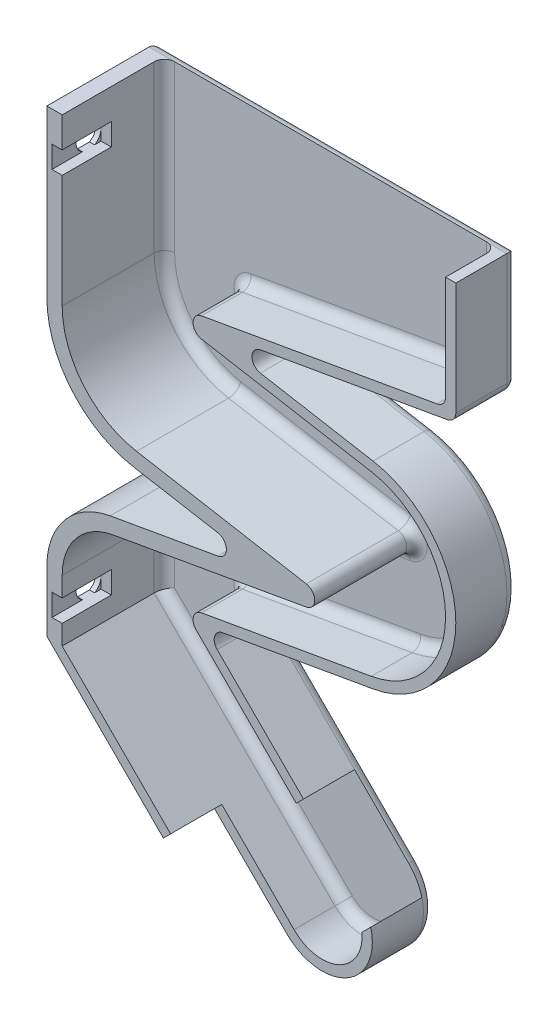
ISO-10303-21;
HEADER;
FILE_DESCRIPTION(('STEP AP214'),'2;1');
FILE_NAME('part.step','',(''),(''),'','','');
FILE_SCHEMA(('AUTOMOTIVE_DESIGN { 1 0 10303 214 1 1 1 1 }'));
ENDSEC;
DATA;
#1=APPLICATION_CONTEXT('core data for automotive mechanical design processes');
#2=APPLICATION_PROTOCOL_DEFINITION('international standard','automotive_design',2000,#1);
#3=PRODUCT_CONTEXT('',#1,'mechanical');
#4=PRODUCT('Part','Part','',(#3));
#5=PRODUCT_RELATED_PRODUCT_CATEGORY('part','',(#4));
#6=PRODUCT_DEFINITION_FORMATION('','',#4);
#7=PRODUCT_DEFINITION_CONTEXT('part definition',#1,'design');
#8=PRODUCT_DEFINITION('design','',#6,#7);
#9=PRODUCT_DEFINITION_SHAPE('','',#8);
#10=(LENGTH_UNIT() NAMED_UNIT(*) SI_UNIT(.MILLI.,.METRE.));
#11=(NAMED_UNIT(*) PLANE_ANGLE_UNIT() SI_UNIT($,.RADIAN.));
#12=(NAMED_UNIT(*) SI_UNIT($,.STERADIAN.) SOLID_ANGLE_UNIT());
#13=UNCERTAINTY_MEASURE_WITH_UNIT(LENGTH_MEASURE(1.E-05),#10,'distance_accuracy_value','');
#14=(GEOMETRIC_REPRESENTATION_CONTEXT(3) GLOBAL_UNCERTAINTY_ASSIGNED_CONTEXT((#13)) GLOBAL_UNIT_ASSIGNED_CONTEXT((#10,
#11,#12)) REPRESENTATION_CONTEXT('',''));
#15=CARTESIAN_POINT('',(0.,0.,0.));
#16=DIRECTION('',(0.,0.,1.));
#17=DIRECTION('',(1.,0.,0.));
#18=AXIS2_PLACEMENT_3D('',#15,#16,#17);
#19=CARTESIAN_POINT('',(-63.9999999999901,90.,62.000000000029));
#20=DIRECTION('',(0.,-1.,0.));
#21=DIRECTION('',(-1.,0.,9.0186191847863E-13));
#22=AXIS2_PLACEMENT_3D('',#19,#20,#21);
#23=PLANE('',#22);
#24=DIRECTION('',(-9.0186191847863E-13,0.,-1.));
#25=VECTOR('',#24,1.);
#26=CARTESIAN_POINT('',(-66.9999999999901,90.,62.0000000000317));
#27=LINE('',#26,#25);
#28=CARTESIAN_POINT('',(-66.9999999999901,90.,62.0000000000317));
#29=VERTEX_POINT('',#28);
#30=CARTESIAN_POINT('',(-67.0000000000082,90.,42.0000000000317));
#31=VERTEX_POINT('',#30);
#32=EDGE_CURVE('E860',#29,#31,#27,.T.);
#33=ORIENTED_EDGE('',*,*,#32,.F.);
#34=DIRECTION('',(1.,0.,-9.0186191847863E-13));
#35=VECTOR('',#34,1.);
#36=CARTESIAN_POINT('',(-63.9999999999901,90.,62.000000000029));
#37=LINE('',#36,#35);
#38=CARTESIAN_POINT('',(-63.9999999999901,90.,62.000000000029));
#39=VERTEX_POINT('',#38);
#40=EDGE_CURVE('E838',#29,#39,#37,.T.);
#41=ORIENTED_EDGE('',*,*,#40,.T.);
#42=DIRECTION('',(-9.0186191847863E-13,0.,-1.));
#43=VECTOR('',#42,1.);
#44=CARTESIAN_POINT('',(-63.9999999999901,90.,62.000000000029));
#45=LINE('',#44,#43);
#46=CARTESIAN_POINT('',(-64.0000000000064,90.,44.000000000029));
#47=VERTEX_POINT('',#46);
#48=EDGE_CURVE('E816',#39,#47,#45,.T.);
#49=ORIENTED_EDGE('',*,*,#48,.T.);
#50=CARTESIAN_POINT('',(-62.0000000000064,90.,44.0000000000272));
#51=DIRECTION('',(0.,1.,0.));
#52=DIRECTION('',(-1.,0.,9.0186191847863E-13));
#53=AXIS2_PLACEMENT_3D('',#50,#51,#52);
#54=CIRCLE('',#53,2.);
#55=CARTESIAN_POINT('',(-62.0000000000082,90.,42.0000000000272));
#56=VERTEX_POINT('',#55);
#57=EDGE_CURVE('E1341',#56,#47,#54,.T.);
#58=ORIENTED_EDGE('',*,*,#57,.F.);
#59=DIRECTION('',(1.,0.,-9.0186191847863E-13));
#60=VECTOR('',#59,1.);
#61=CARTESIAN_POINT('',(-64.0000000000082,90.,42.000000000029));
#62=LINE('',#61,#60);
#63=EDGE_CURVE('E11',#31,#56,#62,.T.);
#64=ORIENTED_EDGE('',*,*,#63,.F.);
#65=EDGE_LOOP('',(#33,#41,#49,#58,#64));
#66=FACE_BOUND('',#65,.T.);
#67=ADVANCED_FACE('F37',(#66),#23,.F.);
#68=CARTESIAN_POINT('',(-67.0009999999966,6.00000000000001,54.8500000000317));
#69=DIRECTION('',(1.,0.,-9.0186191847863E-13));
#70=DIRECTION('',(9.0186191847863E-13,0.,1.));
#71=AXIS2_PLACEMENT_3D('',#68,#69,#70);
#72=CYLINDRICAL_SURFACE('',#71,2.45);
#73=CARTESIAN_POINT('',(-65.9999999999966,6.00000000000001,54.8500000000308));
#74=DIRECTION('',(-1.,0.,9.0186191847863E-13));
#75=DIRECTION('',(9.0186191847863E-13,0.,1.));
#76=AXIS2_PLACEMENT_3D('',#73,#74,#75);
#77=CIRCLE('',#76,2.45);
#78=CARTESIAN_POINT('',(-65.9999999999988,6.00000000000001,52.4000000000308));
#79=VERTEX_POINT('',#78);
#80=CARTESIAN_POINT('',(-65.9999999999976,3.85000000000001,53.6752659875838));
#81=VERTEX_POINT('',#80);
#82=EDGE_CURVE('E536',#79,#81,#77,.T.);
#83=ORIENTED_EDGE('',*,*,#82,.F.);
#84=CARTESIAN_POINT('',(-65.9999999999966,6.00000000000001,54.8500000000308));
#85=DIRECTION('',(-1.,0.,9.0186191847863E-13));
#86=DIRECTION('',(9.0186191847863E-13,0.,1.));
#87=AXIS2_PLACEMENT_3D('',#84,#85,#86);
#88=CIRCLE('',#87,2.45);
#89=CARTESIAN_POINT('',(-65.9999999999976,8.15,53.6752659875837));
#90=VERTEX_POINT('',#89);
#91=EDGE_CURVE('E551',#90,#79,#88,.T.);
#92=ORIENTED_EDGE('',*,*,#91,.F.);
#93=DIRECTION('',(1.,0.,-9.0186191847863E-13));
#94=VECTOR('',#93,1.);
#95=CARTESIAN_POINT('',(-67.0009999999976,8.15,53.6752659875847));
#96=LINE('',#95,#94);
#97=CARTESIAN_POINT('',(-66.9999999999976,8.15,53.6752659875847));
#98=VERTEX_POINT('',#97);
#99=EDGE_CURVE('E546',#98,#90,#96,.T.);
#100=ORIENTED_EDGE('',*,*,#99,.F.);
#101=CARTESIAN_POINT('',(-66.9999999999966,6.00000000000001,54.8500000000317));
#102=DIRECTION('',(-1.,0.,9.0186191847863E-13));
#103=DIRECTION('',(9.0186191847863E-13,0.,1.));
#104=AXIS2_PLACEMENT_3D('',#101,#102,#103);
#105=CIRCLE('',#104,2.45);
#106=CARTESIAN_POINT('',(-66.9999999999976,3.85000000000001,53.6752659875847));
#107=VERTEX_POINT('',#106);
#108=EDGE_CURVE('E655',#107,#98,#105,.F.);
#109=ORIENTED_EDGE('',*,*,#108,.F.);
#110=DIRECTION('',(1.,0.,-9.0186191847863E-13));
#111=VECTOR('',#110,1.);
#112=CARTESIAN_POINT('',(-67.0009999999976,3.85000000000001,53.6752659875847));
#113=LINE('',#112,#111);
#114=EDGE_CURVE('E659',#107,#81,#113,.T.);
#115=ORIENTED_EDGE('',*,*,#114,.T.);
#116=EDGE_LOOP('',(#83,#92,#100,#109,#115));
#117=FACE_BOUND('',#116,.T.);
#118=ADVANCED_FACE('F1322',(#117),#72,.F.);
#119=CARTESIAN_POINT('',(-67.0009999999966,6.00000000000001,54.8500000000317));
#120=DIRECTION('',(1.,0.,-9.0186191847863E-13));
#121=DIRECTION('',(9.0186191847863E-13,0.,1.));
#122=AXIS2_PLACEMENT_3D('',#119,#120,#121);
#123=CYLINDRICAL_SURFACE('',#122,2.45);
#124=CARTESIAN_POINT('',(-65.9999999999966,6.00000000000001,54.8500000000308));
#125=DIRECTION('',(-1.,0.,9.0186191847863E-13));
#126=DIRECTION('',(9.0186191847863E-13,0.,1.));
#127=AXIS2_PLACEMENT_3D('',#124,#125,#126);
#128=CIRCLE('',#127,2.45);
#129=CARTESIAN_POINT('',(-65.9999999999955,3.85000000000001,56.0247340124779));
#130=VERTEX_POINT('',#129);
#131=CARTESIAN_POINT('',(-65.9999999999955,8.15,56.0247340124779));
#132=VERTEX_POINT('',#131);
#133=EDGE_CURVE('E564',#130,#132,#128,.T.);
#134=ORIENTED_EDGE('',*,*,#133,.F.);
#135=DIRECTION('',(1.,0.,-9.0186191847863E-13));
#136=VECTOR('',#135,1.);
#137=CARTESIAN_POINT('',(-67.0009999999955,3.85000000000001,56.0247340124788));
#138=LINE('',#137,#136);
#139=CARTESIAN_POINT('',(-66.9999999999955,3.85000000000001,56.0247340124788));
#140=VERTEX_POINT('',#139);
#141=EDGE_CURVE('E656',#140,#130,#138,.T.);
#142=ORIENTED_EDGE('',*,*,#141,.F.);
#143=CARTESIAN_POINT('',(-66.9999999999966,6.00000000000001,54.8500000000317));
#144=DIRECTION('',(-1.,0.,9.0186191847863E-13));
#145=DIRECTION('',(9.0186191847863E-13,0.,1.));
#146=AXIS2_PLACEMENT_3D('',#143,#144,#145);
#147=CIRCLE('',#146,2.45);
#148=CARTESIAN_POINT('',(-66.9999999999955,8.15,56.0247340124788));
#149=VERTEX_POINT('',#148);
#150=EDGE_CURVE('E646',#149,#140,#147,.F.);
#151=ORIENTED_EDGE('',*,*,#150,.F.);
#152=DIRECTION('',(1.,0.,-9.0186191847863E-13));
#153=VECTOR('',#152,1.);
#154=CARTESIAN_POINT('',(-67.0009999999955,8.15,56.0247340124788));
#155=LINE('',#154,#153);
#156=EDGE_CURVE('E652',#149,#132,#155,.T.);
#157=ORIENTED_EDGE('',*,*,#156,.T.);
#158=EDGE_LOOP('',(#134,#142,#151,#157));
#159=FACE_BOUND('',#158,.T.);
#160=ADVANCED_FACE('F1327',(#159),#123,.F.);
#161=CARTESIAN_POINT('',(-67.0009999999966,81.9,54.8500000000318));
#162=DIRECTION('',(1.,0.,-9.0186191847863E-13));
#163=DIRECTION('',(9.0186191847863E-13,0.,1.));
#164=AXIS2_PLACEMENT_3D('',#161,#162,#163);
#165=CYLINDRICAL_SURFACE('',#164,2.45);
#166=CARTESIAN_POINT('',(-65.9999999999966,81.9,54.8500000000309));
#167=DIRECTION('',(-1.,0.,9.0186191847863E-13));
#168=DIRECTION('',(9.0186191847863E-13,0.,1.));
#169=AXIS2_PLACEMENT_3D('',#166,#167,#168);
#170=CIRCLE('',#169,2.45);
#171=CARTESIAN_POINT('',(-65.9999999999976,84.05,53.6752659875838));
#172=VERTEX_POINT('',#171);
#173=CARTESIAN_POINT('',(-65.9999999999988,81.9,52.4000000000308));
#174=VERTEX_POINT('',#173);
#175=EDGE_CURVE('E581',#172,#174,#170,.T.);
#176=ORIENTED_EDGE('',*,*,#175,.F.);
#177=DIRECTION('',(1.,0.,-9.0186191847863E-13));
#178=VECTOR('',#177,1.);
#179=CARTESIAN_POINT('',(-67.0009999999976,84.05,53.6752659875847));
#180=LINE('',#179,#178);
#181=CARTESIAN_POINT('',(-66.9999999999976,84.05,53.6752659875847));
#182=VERTEX_POINT('',#181);
#183=EDGE_CURVE('E634',#182,#172,#180,.T.);
#184=ORIENTED_EDGE('',*,*,#183,.F.);
#185=CARTESIAN_POINT('',(-66.9999999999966,81.9,54.8500000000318));
#186=DIRECTION('',(-1.,0.,9.0186191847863E-13));
#187=DIRECTION('',(9.0186191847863E-13,0.,1.));
#188=AXIS2_PLACEMENT_3D('',#185,#186,#187);
#189=CIRCLE('',#188,2.45);
#190=CARTESIAN_POINT('',(-66.9999999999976,79.75,53.6752659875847));
#191=VERTEX_POINT('',#190);
#192=EDGE_CURVE('E619',#191,#182,#189,.F.);
#193=ORIENTED_EDGE('',*,*,#192,.F.);
#194=DIRECTION('',(1.,0.,-9.0186191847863E-13));
#195=VECTOR('',#194,1.);
#196=CARTESIAN_POINT('',(-67.0009999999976,79.75,53.6752659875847));
#197=LINE('',#196,#195);
#198=CARTESIAN_POINT('',(-65.9999999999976,79.75,53.6752659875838));
#199=VERTEX_POINT('',#198);
#200=EDGE_CURVE('E630',#191,#199,#197,.T.);
#201=ORIENTED_EDGE('',*,*,#200,.T.);
#202=CARTESIAN_POINT('',(-65.9999999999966,81.9,54.8500000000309));
#203=DIRECTION('',(-1.,0.,9.0186191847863E-13));
#204=DIRECTION('',(9.0186191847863E-13,0.,1.));
#205=AXIS2_PLACEMENT_3D('',#202,#203,#204);
#206=CIRCLE('',#205,2.45);
#207=EDGE_CURVE('E590',#174,#199,#206,.T.);
#208=ORIENTED_EDGE('',*,*,#207,.F.);
#209=EDGE_LOOP('',(#176,#184,#193,#201,#208));
#210=FACE_BOUND('',#209,.T.);
#211=ADVANCED_FACE('F1543',(#210),#165,.F.);
#212=CARTESIAN_POINT('',(-67.0009999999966,81.9,54.8500000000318));
#213=DIRECTION('',(1.,0.,-9.0186191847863E-13));
#214=DIRECTION('',(9.0186191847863E-13,0.,1.));
#215=AXIS2_PLACEMENT_3D('',#212,#213,#214);
#216=CYLINDRICAL_SURFACE('',#215,2.45);
#217=CARTESIAN_POINT('',(-65.9999999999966,81.9,54.8500000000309));
#218=DIRECTION('',(-1.,0.,9.0186191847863E-13));
#219=DIRECTION('',(9.0186191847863E-13,0.,1.));
#220=AXIS2_PLACEMENT_3D('',#217,#218,#219);
#221=CIRCLE('',#220,2.45);
#222=CARTESIAN_POINT('',(-65.9999999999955,79.75,56.024734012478));
#223=VERTEX_POINT('',#222);
#224=CARTESIAN_POINT('',(-65.9999999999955,84.05,56.0247340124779));
#225=VERTEX_POINT('',#224);
#226=EDGE_CURVE('E601',#223,#225,#221,.T.);
#227=ORIENTED_EDGE('',*,*,#226,.F.);
#228=DIRECTION('',(1.,0.,-9.0186191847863E-13));
#229=VECTOR('',#228,1.);
#230=CARTESIAN_POINT('',(-67.0009999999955,79.75,56.0247340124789));
#231=LINE('',#230,#229);
#232=CARTESIAN_POINT('',(-66.9999999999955,79.75,56.0247340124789));
#233=VERTEX_POINT('',#232);
#234=EDGE_CURVE('E629',#233,#223,#231,.T.);
#235=ORIENTED_EDGE('',*,*,#234,.F.);
#236=CARTESIAN_POINT('',(-66.9999999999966,81.9,54.8500000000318));
#237=DIRECTION('',(-1.,0.,9.0186191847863E-13));
#238=DIRECTION('',(9.0186191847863E-13,0.,1.));
#239=AXIS2_PLACEMENT_3D('',#236,#237,#238);
#240=CIRCLE('',#239,2.45);
#241=CARTESIAN_POINT('',(-66.9999999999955,84.05,56.0247340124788));
#242=VERTEX_POINT('',#241);
#243=EDGE_CURVE('E633',#242,#233,#240,.F.);
#244=ORIENTED_EDGE('',*,*,#243,.F.);
#245=DIRECTION('',(1.,0.,-9.0186191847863E-13));
#246=VECTOR('',#245,1.);
#247=CARTESIAN_POINT('',(-67.0009999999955,84.05,56.0247340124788));
#248=LINE('',#247,#246);
#249=EDGE_CURVE('E637',#242,#225,#248,.T.);
#250=ORIENTED_EDGE('',*,*,#249,.T.);
#251=EDGE_LOOP('',(#227,#235,#244,#250));
#252=FACE_BOUND('',#251,.T.);
#253=ADVANCED_FACE('F1547',(#252),#216,.F.);
#254=CARTESIAN_POINT('',(1.00000000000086,67.9927220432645,51.9999999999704));
#255=DIRECTION('',(9.0186191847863E-13,0.,1.));
#256=DIRECTION('',(-1.,0.,9.0186191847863E-13));
#257=AXIS2_PLACEMENT_3D('',#254,#255,#256);
#258=PLANE('',#257);
#259=DIRECTION('',(-0.70710678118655,-0.707106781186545,6.37712678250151E-13));
#260=VECTOR('',#259,1.);
#261=CARTESIAN_POINT('',(-13.6298860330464,-27.431068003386,51.9999999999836));
#262=LINE('',#261,#260);
#263=CARTESIAN_POINT('',(-13.6298860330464,-27.431068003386,51.9999999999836));
#264=VERTEX_POINT('',#263);
#265=CARTESIAN_POINT('',(-15.3589094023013,-29.1600913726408,51.9999999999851));
#266=VERTEX_POINT('',#265);
#267=EDGE_CURVE('E682',#264,#266,#262,.T.);
#268=ORIENTED_EDGE('',*,*,#267,.T.);
#269=CARTESIAN_POINT('',(-23.1292280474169,-29.8399061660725,51.9999999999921));
#270=DIRECTION('',(9.0186191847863E-13,0.,1.));
#271=DIRECTION('',(-1.,0.,9.0186191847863E-13));
#272=AXIS2_PLACEMENT_3D('',#269,#270,#271);
#273=CIRCLE('',#272,7.8);
#274=CARTESIAN_POINT('',(-28.644660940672,-35.3553390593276,51.9999999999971));
#275=VERTEX_POINT('',#274);
#276=EDGE_CURVE('E733',#275,#266,#273,.T.);
#277=ORIENTED_EDGE('',*,*,#276,.F.);
#278=DIRECTION('',(0.707106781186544,-0.707106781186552,-6.37712678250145E-13));
#279=VECTOR('',#278,1.);
#280=CARTESIAN_POINT('',(-42.7867965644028,-21.2132034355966,52.0000000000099));
#281=LINE('',#280,#279);
#282=CARTESIAN_POINT('',(-42.7867965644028,-21.2132034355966,52.0000000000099));
#283=VERTEX_POINT('',#282);
#284=EDGE_CURVE('E730',#283,#275,#281,.T.);
#285=ORIENTED_EDGE('',*,*,#284,.F.);
#286=DIRECTION('',(0.707106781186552,0.707106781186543,-6.37712678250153E-13));
#287=VECTOR('',#286,1.);
#288=CARTESIAN_POINT('',(-42.7867965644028,-21.2132034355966,52.0000000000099));
#289=LINE('',#288,#287);
#290=CARTESIAN_POINT('',(-44.201010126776,-22.6274169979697,52.0000000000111));
#291=VERTEX_POINT('',#290);
#292=EDGE_CURVE('E727',#291,#283,#289,.T.);
#293=ORIENTED_EDGE('',*,*,#292,.F.);
#294=DIRECTION('',(-0.707106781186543,0.707106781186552,6.37712678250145E-13));
#295=VECTOR('',#294,1.);
#296=CARTESIAN_POINT('',(-30.0588745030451,-36.7695526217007,51.9999999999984));
#297=LINE('',#296,#295);
#298=CARTESIAN_POINT('',(-30.0588745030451,-36.7695526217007,51.9999999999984));
#299=VERTEX_POINT('',#298);
#300=EDGE_CURVE('E724',#299,#291,#297,.T.);
#301=ORIENTED_EDGE('',*,*,#300,.F.);
#302=CARTESIAN_POINT('',(-23.1292280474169,-29.8399061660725,51.9999999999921));
#303=DIRECTION('',(-9.0186191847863E-13,0.,-1.));
#304=DIRECTION('',(-1.,0.,9.0186191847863E-13));
#305=AXIS2_PLACEMENT_3D('',#302,#303,#304);
#306=CIRCLE('',#305,9.80000000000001);
#307=EDGE_CURVE('E721',#264,#299,#306,.T.);
#308=ORIENTED_EDGE('',*,*,#307,.F.);
#309=EDGE_LOOP('',(#268,#277,#285,#293,#301,#308));
#310=FACE_BOUND('',#309,.T.);
#311=ADVANCED_FACE('F1159',(#310),#258,.T.);
#312=CARTESIAN_POINT('',(-1.00000000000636,90.,43.9999999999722));
#313=DIRECTION('',(0.,1.,0.));
#314=DIRECTION('',(-1.,0.,9.0186191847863E-13));
#315=AXIS2_PLACEMENT_3D('',#312,#313,#314);
#316=CIRCLE('',#315,2.);
#317=CARTESIAN_POINT('',(0.999999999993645,90.,43.9999999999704));
#318=VERTEX_POINT('',#317);
#319=CARTESIAN_POINT('',(-1.00000000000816,90.,41.9999999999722));
#320=VERTEX_POINT('',#319);
#321=EDGE_CURVE('E1343',#318,#320,#316,.T.);
#322=ORIENTED_EDGE('',*,*,#321,.F.);
#323=DIRECTION('',(-9.0186191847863E-13,0.,-1.));
#324=VECTOR('',#323,1.);
#325=CARTESIAN_POINT('',(1.00000000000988,90.,61.9999999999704));
#326=LINE('',#325,#324);
#327=CARTESIAN_POINT('',(1.00000000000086,90.,51.9999999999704));
#328=VERTEX_POINT('',#327);
#329=EDGE_CURVE('E813',#328,#318,#326,.T.);
#330=ORIENTED_EDGE('',*,*,#329,.F.);
#331=DIRECTION('',(1.,0.,-9.0186191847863E-13));
#332=VECTOR('',#331,1.);
#333=CARTESIAN_POINT('',(1.00000000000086,90.,51.9999999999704));
#334=LINE('',#333,#332);
#335=CARTESIAN_POINT('',(3.00000000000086,90.,51.9999999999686));
#336=VERTEX_POINT('',#335);
#337=EDGE_CURVE('E694',#328,#336,#334,.T.);
#338=ORIENTED_EDGE('',*,*,#337,.T.);
#339=DIRECTION('',(-9.0186191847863E-13,0.,-1.));
#340=VECTOR('',#339,1.);
#341=CARTESIAN_POINT('',(3.00000000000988,90.,61.9999999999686));
#342=LINE('',#341,#340);
#343=CARTESIAN_POINT('',(2.99999999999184,90.,41.9999999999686));
#344=VERTEX_POINT('',#343);
#345=EDGE_CURVE('E864',#336,#344,#342,.T.);
#346=ORIENTED_EDGE('',*,*,#345,.T.);
#347=DIRECTION('',(1.,0.,-9.0186191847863E-13));
#348=VECTOR('',#347,1.);
#349=CARTESIAN_POINT('',(-64.0000000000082,90.,42.000000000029));
#350=LINE('',#349,#348);
#351=EDGE_CURVE('E46',#320,#344,#350,.T.);
#352=ORIENTED_EDGE('',*,*,#351,.F.);
#353=EDGE_LOOP('',(#322,#330,#338,#346,#352));
#354=FACE_BOUND('',#353,.T.);
#355=ADVANCED_FACE('F1242',(#354),#23,.F.);
#356=CARTESIAN_POINT('',(3.00000000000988,90.,61.9999999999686));
#357=DIRECTION('',(-1.,0.,9.0186191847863E-13));
#358=DIRECTION('',(-9.0186191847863E-13,0.,-1.));
#359=AXIS2_PLACEMENT_3D('',#356,#357,#358);
#360=PLANE('',#359);
#361=ORIENTED_EDGE('',*,*,#345,.F.);
#362=DIRECTION('',(0.,-1.,0.));
#363=VECTOR('',#362,1.);
#364=CARTESIAN_POINT('',(3.00000000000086,90.,51.9999999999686));
#365=LINE('',#364,#363);
#366=CARTESIAN_POINT('',(3.00000000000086,67.9927220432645,51.9999999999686));
#367=VERTEX_POINT('',#366);
#368=EDGE_CURVE('E697',#336,#367,#365,.T.);
#369=ORIENTED_EDGE('',*,*,#368,.T.);
#370=DIRECTION('',(-9.0186191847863E-13,0.,-1.));
#371=VECTOR('',#370,1.);
#372=CARTESIAN_POINT('',(3.00000000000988,67.9927220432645,61.9999999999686));
#373=LINE('',#372,#371);
#374=CARTESIAN_POINT('',(2.99999999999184,67.9927220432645,41.9999999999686));
#375=VERTEX_POINT('',#374);
#376=EDGE_CURVE('E901',#375,#367,#373,.F.);
#377=ORIENTED_EDGE('',*,*,#376,.F.);
#378=DIRECTION('',(0.,-1.,0.));
#379=VECTOR('',#378,1.);
#380=CARTESIAN_POINT('',(2.99999999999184,90.,41.9999999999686));
#381=LINE('',#380,#379);
#382=EDGE_CURVE('E1114',#344,#375,#381,.T.);
#383=ORIENTED_EDGE('',*,*,#382,.F.);
#384=EDGE_LOOP('',(#361,#369,#377,#383));
#385=FACE_BOUND('',#384,.T.);
#386=ADVANCED_FACE('F1245',(#385),#360,.F.);
#387=CARTESIAN_POINT('',(-46.3999999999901,57.6039699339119,62.0000000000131));
#388=DIRECTION('',(-0.173648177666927,0.984807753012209,1.56606678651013E-13));
#389=DIRECTION('',(0.984807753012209,0.173648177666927,-8.8816060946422E-13));
#390=AXIS2_PLACEMENT_3D('',#387,#388,#389);
#391=PLANE('',#390);
#392=DIRECTION('',(-9.0186191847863E-13,0.,-1.));
#393=VECTOR('',#392,1.);
#394=CARTESIAN_POINT('',(1.34729635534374,66.0231065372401,61.9999999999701));
#395=LINE('',#394,#393);
#396=CARTESIAN_POINT('',(1.34729635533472,66.0231065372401,51.9999999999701));
#397=VERTEX_POINT('',#396);
#398=CARTESIAN_POINT('',(1.3472963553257,66.0231065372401,41.9999999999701));
#399=VERTEX_POINT('',#398);
#400=EDGE_CURVE('E898',#397,#399,#395,.T.);
#401=ORIENTED_EDGE('',*,*,#400,.F.);
#402=DIRECTION('',(-0.984807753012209,-0.173648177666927,8.8816060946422E-13));
#403=VECTOR('',#402,1.);
#404=CARTESIAN_POINT('',(1.34729635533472,66.0231065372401,51.9999999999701));
#405=LINE('',#404,#403);
#406=CARTESIAN_POINT('',(-35.2297553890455,59.5735854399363,52.0000000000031));
#407=VERTEX_POINT('',#406);
#408=EDGE_CURVE('E702',#397,#407,#405,.T.);
#409=ORIENTED_EDGE('',*,*,#408,.T.);
#410=DIRECTION('',(-9.0186191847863E-13,0.,-1.));
#411=VECTOR('',#410,1.);
#412=CARTESIAN_POINT('',(-35.2297553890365,59.5735854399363,62.0000000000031));
#413=LINE('',#412,#411);
#414=CARTESIAN_POINT('',(-35.2297553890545,59.5735854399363,42.0000000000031));
#415=VERTEX_POINT('',#414);
#416=EDGE_CURVE('E895',#415,#407,#413,.F.);
#417=ORIENTED_EDGE('',*,*,#416,.F.);
#418=DIRECTION('',(-0.984807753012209,-0.173648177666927,8.8816060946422E-13));
#419=VECTOR('',#418,1.);
#420=CARTESIAN_POINT('',(-46.4000000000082,57.6039699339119,42.0000000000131));
#421=LINE('',#420,#419);
#422=EDGE_CURVE('E1119',#399,#415,#421,.T.);
#423=ORIENTED_EDGE('',*,*,#422,.F.);
#424=EDGE_LOOP('',(#401,#409,#417,#423));
#425=FACE_BOUND('',#424,.T.);
#426=ADVANCED_FACE('F1274',(#425),#391,.F.);
#427=CARTESIAN_POINT('',(-13.1964957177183,51.7492962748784,61.9999999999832));
#428=DIRECTION('',(-0.173648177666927,-0.984807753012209,1.56606678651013E-13));
#429=DIRECTION('',(-0.984807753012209,0.173648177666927,8.8816060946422E-13));
#430=AXIS2_PLACEMENT_3D('',#427,#428,#429);
#431=PLANE('',#430);
#432=DIRECTION('',(-9.0186191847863E-13,0.,-1.));
#433=VECTOR('',#432,1.);
#434=CARTESIAN_POINT('',(-35.2297553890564,55.6343544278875,40.0000000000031));
#435=LINE('',#434,#433);
#436=CARTESIAN_POINT('',(-35.2297553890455,55.6343544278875,52.0000000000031));
#437=VERTEX_POINT('',#436);
#438=CARTESIAN_POINT('',(-35.2297553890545,55.6343544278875,42.0000000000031));
#439=VERTEX_POINT('',#438);
#440=EDGE_CURVE('E916',#437,#439,#435,.T.);
#441=ORIENTED_EDGE('',*,*,#440,.F.);
#442=DIRECTION('',(0.984807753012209,-0.173648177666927,-8.8816060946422E-13));
#443=VECTOR('',#442,1.);
#444=CARTESIAN_POINT('',(-35.2297553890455,55.6343544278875,52.0000000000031));
#445=LINE('',#444,#443);
#446=CARTESIAN_POINT('',(-13.1964957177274,51.7492962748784,51.9999999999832));
#447=VERTEX_POINT('',#446);
#448=EDGE_CURVE('E707',#437,#447,#445,.T.);
#449=ORIENTED_EDGE('',*,*,#448,.T.);
#450=DIRECTION('',(-9.0186191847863E-13,0.,-1.));
#451=VECTOR('',#450,1.);
#452=CARTESIAN_POINT('',(-13.1964957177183,51.7492962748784,61.9999999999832));
#453=LINE('',#452,#451);
#454=CARTESIAN_POINT('',(-13.1964957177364,51.7492962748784,41.9999999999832));
#455=VERTEX_POINT('',#454);
#456=EDGE_CURVE('E861',#447,#455,#453,.T.);
#457=ORIENTED_EDGE('',*,*,#456,.T.);
#458=DIRECTION('',(0.984807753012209,-0.173648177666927,-8.8816060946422E-13));
#459=VECTOR('',#458,1.);
#460=CARTESIAN_POINT('',(-13.1964957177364,51.7492962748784,41.9999999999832));
#461=LINE('',#460,#459);
#462=EDGE_CURVE('E1072',#439,#455,#461,.T.);
#463=ORIENTED_EDGE('',*,*,#462,.F.);
#464=EDGE_LOOP('',(#441,#449,#457,#463));
#465=FACE_BOUND('',#464,.T.);
#466=ADVANCED_FACE('F1278',(#465),#431,.F.);
#467=CARTESIAN_POINT('',(-16.5999999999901,32.4470643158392,61.9999999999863));
#468=DIRECTION('',(-9.0186191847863E-13,0.,-1.));
#469=DIRECTION('',(1.,0.,-9.0186191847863E-13));
#470=AXIS2_PLACEMENT_3D('',#467,#468,#469);
#471=CYLINDRICAL_SURFACE('',#470,19.6);
#472=ORIENTED_EDGE('',*,*,#456,.F.);
#473=CARTESIAN_POINT('',(-16.5999999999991,32.4470643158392,51.9999999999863));
#474=DIRECTION('',(-9.0186191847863E-13,0.,-1.));
#475=DIRECTION('',(-1.,0.,9.0186191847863E-13));
#476=AXIS2_PLACEMENT_3D('',#473,#474,#475);
#477=CIRCLE('',#476,19.6);
#478=CARTESIAN_POINT('',(-13.1964957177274,13.1448323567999,51.9999999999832));
#479=VERTEX_POINT('',#478);
#480=EDGE_CURVE('E710',#447,#479,#477,.T.);
#481=ORIENTED_EDGE('',*,*,#480,.T.);
#482=DIRECTION('',(9.0186191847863E-13,0.,1.));
#483=VECTOR('',#482,1.);
#484=CARTESIAN_POINT('',(-13.1964957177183,13.1448323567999,61.9999999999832));
#485=LINE('',#484,#483);
#486=CARTESIAN_POINT('',(-13.1964957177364,13.1448323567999,41.9999999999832));
#487=VERTEX_POINT('',#486);
#488=EDGE_CURVE('E865',#479,#487,#485,.F.);
#489=ORIENTED_EDGE('',*,*,#488,.T.);
#490=CARTESIAN_POINT('',(-16.6000000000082,32.4470643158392,41.9999999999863));
#491=DIRECTION('',(-9.0186191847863E-13,0.,-1.));
#492=DIRECTION('',(-1.,0.,9.0186191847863E-13));
#493=AXIS2_PLACEMENT_3D('',#490,#491,#492);
#494=CIRCLE('',#493,19.6);
#495=EDGE_CURVE('E1075',#455,#487,#494,.T.);
#496=ORIENTED_EDGE('',*,*,#495,.F.);
#497=EDGE_LOOP('',(#472,#481,#489,#496));
#498=FACE_BOUND('',#497,.T.);
#499=ADVANCED_FACE('F1282',(#498),#471,.T.);
#500=CARTESIAN_POINT('',(-46.3999999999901,7.29015869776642,62.0000000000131));
#501=DIRECTION('',(-0.173648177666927,0.984807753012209,1.56606678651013E-13));
#502=DIRECTION('',(0.984807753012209,0.173648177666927,-8.8816060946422E-13));
#503=AXIS2_PLACEMENT_3D('',#500,#501,#502);
#504=PLANE('',#503);
#505=ORIENTED_EDGE('',*,*,#488,.F.);
#506=DIRECTION('',(-0.984807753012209,-0.173648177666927,8.8816060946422E-13));
#507=VECTOR('',#506,1.);
#508=CARTESIAN_POINT('',(-13.1964957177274,13.1448323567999,51.9999999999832));
#509=LINE('',#508,#507);
#510=CARTESIAN_POINT('',(-42.616403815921,7.95730878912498,52.0000000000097));
#511=VERTEX_POINT('',#510);
#512=EDGE_CURVE('E713',#479,#511,#509,.T.);
#513=ORIENTED_EDGE('',*,*,#512,.T.);
#514=DIRECTION('',(-9.0186191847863E-13,0.,-1.));
#515=VECTOR('',#514,1.);
#516=CARTESIAN_POINT('',(-42.616403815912,7.95730878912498,62.0000000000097));
#517=LINE('',#516,#515);
#518=CARTESIAN_POINT('',(-42.61640381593,7.95730878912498,42.0000000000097));
#519=VERTEX_POINT('',#518);
#520=EDGE_CURVE('E913',#519,#511,#517,.F.);
#521=ORIENTED_EDGE('',*,*,#520,.F.);
#522=DIRECTION('',(-0.984807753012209,-0.173648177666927,8.8816060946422E-13));
#523=VECTOR('',#522,1.);
#524=CARTESIAN_POINT('',(-46.4000000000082,7.29015869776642,42.0000000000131));
#525=LINE('',#524,#523);
#526=EDGE_CURVE('E1078',#487,#519,#525,.T.);
#527=ORIENTED_EDGE('',*,*,#526,.F.);
#528=EDGE_LOOP('',(#505,#513,#521,#527));
#529=FACE_BOUND('',#528,.T.);
#530=ADVANCED_FACE('F1286',(#529),#504,.F.);
#531=CARTESIAN_POINT('',(-16.1995815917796,-22.9102597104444,61.9999999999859));
#532=DIRECTION('',(-0.707106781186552,-0.707106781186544,6.37712678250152E-13));
#533=DIRECTION('',(-0.707106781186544,0.707106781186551,6.37712678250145E-13));
#534=AXIS2_PLACEMENT_3D('',#531,#532,#533);
#535=PLANE('',#534);
#536=DIRECTION('',(-9.0186191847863E-13,0.,-1.));
#537=VECTOR('',#536,1.);
#538=CARTESIAN_POINT('',(-43.6833210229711,4.57347972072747,40.0000000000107));
#539=LINE('',#538,#537);
#540=CARTESIAN_POINT('',(-43.6833210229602,4.57347972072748,52.0000000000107));
#541=VERTEX_POINT('',#540);
#542=CARTESIAN_POINT('',(-43.6833210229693,4.57347972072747,42.0000000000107));
#543=VERTEX_POINT('',#542);
#544=EDGE_CURVE('E910',#541,#543,#539,.T.);
#545=ORIENTED_EDGE('',*,*,#544,.F.);
#546=DIRECTION('',(0.707106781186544,-0.707106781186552,-6.37712678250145E-13));
#547=VECTOR('',#546,1.);
#548=CARTESIAN_POINT('',(-43.6833210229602,4.57347972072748,52.0000000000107));
#549=LINE('',#548,#547);
#550=CARTESIAN_POINT('',(-26.7964652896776,-12.3133760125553,51.9999999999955));
#551=VERTEX_POINT('',#550);
#552=EDGE_CURVE('E718',#541,#551,#549,.T.);
#553=ORIENTED_EDGE('',*,*,#552,.T.);
#554=DIRECTION('',(9.0186191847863E-13,0.,1.));
#555=VECTOR('',#554,1.);
#556=CARTESIAN_POINT('',(-26.7964652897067,-12.3133760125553,19.7197096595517));
#557=LINE('',#556,#555);
#558=CARTESIAN_POINT('',(-26.7964652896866,-12.3133760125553,41.9999999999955));
#559=VERTEX_POINT('',#558);
#560=EDGE_CURVE('E689',#559,#551,#557,.T.);
#561=ORIENTED_EDGE('',*,*,#560,.F.);
#562=DIRECTION('',(0.707106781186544,-0.707106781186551,-6.37712678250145E-13));
#563=VECTOR('',#562,1.);
#564=CARTESIAN_POINT('',(-16.1995815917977,-22.9102597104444,41.9999999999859));
#565=LINE('',#564,#563);
#566=EDGE_CURVE('E1084',#543,#559,#565,.T.);
#567=ORIENTED_EDGE('',*,*,#566,.F.);
#568=EDGE_LOOP('',(#545,#553,#561,#567));
#569=FACE_BOUND('',#568,.T.);
#570=ADVANCED_FACE('F1290',(#569),#535,.F.);
#571=CARTESIAN_POINT('',(-23.1292280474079,-29.8399061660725,61.9999999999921));
#572=DIRECTION('',(-9.0186191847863E-13,0.,-1.));
#573=DIRECTION('',(1.,0.,-9.0186191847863E-13));
#574=AXIS2_PLACEMENT_3D('',#571,#572,#573);
#575=CYLINDRICAL_SURFACE('',#574,9.80000000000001);
#576=DIRECTION('',(9.0186191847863E-13,0.,1.));
#577=VECTOR('',#576,1.);
#578=CARTESIAN_POINT('',(-13.6298860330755,-27.431068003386,19.7197096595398));
#579=LINE('',#578,#577);
#580=CARTESIAN_POINT('',(-13.6298860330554,-27.431068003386,41.9999999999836));
#581=VERTEX_POINT('',#580);
#582=EDGE_CURVE('E687',#581,#264,#579,.T.);
#583=ORIENTED_EDGE('',*,*,#582,.T.);
#584=ORIENTED_EDGE('',*,*,#307,.T.);
#585=DIRECTION('',(9.0186191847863E-13,0.,1.));
#586=VECTOR('',#585,1.);
#587=CARTESIAN_POINT('',(-30.0588745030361,-36.7695526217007,61.9999999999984));
#588=LINE('',#587,#586);
#589=CARTESIAN_POINT('',(-30.0588745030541,-36.7695526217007,41.9999999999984));
#590=VERTEX_POINT('',#589);
#591=EDGE_CURVE('E851',#299,#590,#588,.F.);
#592=ORIENTED_EDGE('',*,*,#591,.T.);
#593=CARTESIAN_POINT('',(-23.1292280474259,-29.8399061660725,41.9999999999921));
#594=DIRECTION('',(-9.0186191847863E-13,0.,-1.));
#595=DIRECTION('',(-1.,0.,9.0186191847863E-13));
#596=AXIS2_PLACEMENT_3D('',#593,#594,#595);
#597=CIRCLE('',#596,9.80000000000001);
#598=EDGE_CURVE('E1087',#581,#590,#597,.T.);
#599=ORIENTED_EDGE('',*,*,#598,.F.);
#600=EDGE_LOOP('',(#583,#584,#592,#599));
#601=FACE_BOUND('',#600,.T.);
#602=ADVANCED_FACE('F1209',(#601),#575,.T.);
#603=CARTESIAN_POINT('',(1.00000000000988,90.,61.9999999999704));
#604=DIRECTION('',(-1.,0.,9.0186191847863E-13));
#605=DIRECTION('',(-9.0186191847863E-13,0.,-1.));
#606=AXIS2_PLACEMENT_3D('',#603,#604,#605);
#607=PLANE('',#606);
#608=DIRECTION('',(-9.0186191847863E-13,0.,-1.));
#609=VECTOR('',#608,1.);
#610=CARTESIAN_POINT('',(0.999999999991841,69.6709213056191,41.9999999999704));
#611=LINE('',#610,#609);
#612=CARTESIAN_POINT('',(1.00000000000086,69.6709213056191,51.9999999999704));
#613=VERTEX_POINT('',#612);
#614=CARTESIAN_POINT('',(0.999999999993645,69.6709213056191,43.9999999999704));
#615=VERTEX_POINT('',#614);
#616=EDGE_CURVE('E846',#613,#615,#611,.T.);
#617=ORIENTED_EDGE('',*,*,#616,.F.);
#618=DIRECTION('',(0.,1.,0.));
#619=VECTOR('',#618,1.);
#620=CARTESIAN_POINT('',(1.00000000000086,69.6709213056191,51.9999999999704));
#621=LINE('',#620,#619);
#622=EDGE_CURVE('E753',#613,#328,#621,.T.);
#623=ORIENTED_EDGE('',*,*,#622,.T.);
#624=ORIENTED_EDGE('',*,*,#329,.T.);
#625=DIRECTION('',(0.,-1.,0.));
#626=VECTOR('',#625,1.);
#627=CARTESIAN_POINT('',(0.999999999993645,90.,43.9999999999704));
#628=LINE('',#627,#626);
#629=EDGE_CURVE('E1127',#615,#318,#628,.F.);
#630=ORIENTED_EDGE('',*,*,#629,.F.);
#631=EDGE_LOOP('',(#617,#623,#624,#630));
#632=FACE_BOUND('',#631,.T.);
#633=ADVANCED_FACE('F1205',(#632),#607,.T.);
#634=CARTESIAN_POINT('',(-46.747296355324,59.5735854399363,62.0000000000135));
#635=DIRECTION('',(-0.173648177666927,0.984807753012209,1.56606678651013E-13));
#636=DIRECTION('',(0.984807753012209,0.173648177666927,-8.8816060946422E-13));
#637=AXIS2_PLACEMENT_3D('',#634,#635,#636);
#638=PLANE('',#637);
#639=DIRECTION('',(-9.0186191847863E-13,0.,-1.));
#640=VECTOR('',#639,1.);
#641=CARTESIAN_POINT('',(-46.747296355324,59.5735854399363,62.0000000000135));
#642=LINE('',#641,#640);
#643=CARTESIAN_POINT('',(-46.747296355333,59.5735854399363,52.0000000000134));
#644=VERTEX_POINT('',#643);
#645=CARTESIAN_POINT('',(-46.7472963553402,59.5735854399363,44.0000000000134));
#646=VERTEX_POINT('',#645);
#647=EDGE_CURVE('E810',#644,#646,#642,.T.);
#648=ORIENTED_EDGE('',*,*,#647,.F.);
#649=DIRECTION('',(0.984807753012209,0.173648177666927,-8.8816060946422E-13));
#650=VECTOR('',#649,1.);
#651=CARTESIAN_POINT('',(-46.747296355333,59.5735854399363,52.0000000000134));
#652=LINE('',#651,#650);
#653=CARTESIAN_POINT('',(-0.652703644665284,67.7013057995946,51.9999999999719));
#654=VERTEX_POINT('',#653);
#655=EDGE_CURVE('E748',#644,#654,#652,.T.);
#656=ORIENTED_EDGE('',*,*,#655,.T.);
#657=DIRECTION('',(-9.0186191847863E-13,0.,-1.));
#658=VECTOR('',#657,1.);
#659=CARTESIAN_POINT('',(-0.652703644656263,67.7013057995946,61.9999999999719));
#660=LINE('',#659,#658);
#661=CARTESIAN_POINT('',(-0.6527036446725,67.7013057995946,43.9999999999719));
#662=VERTEX_POINT('',#661);
#663=EDGE_CURVE('E892',#662,#654,#660,.F.);
#664=ORIENTED_EDGE('',*,*,#663,.F.);
#665=DIRECTION('',(-0.984807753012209,-0.173648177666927,8.8816060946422E-13));
#666=VECTOR('',#665,1.);
#667=CARTESIAN_POINT('',(-0.6527036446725,67.7013057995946,43.9999999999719));
#668=LINE('',#667,#666);
#669=EDGE_CURVE('E1010',#646,#662,#668,.F.);
#670=ORIENTED_EDGE('',*,*,#669,.F.);
#671=EDGE_LOOP('',(#648,#656,#664,#670));
#672=FACE_BOUND('',#671,.T.);
#673=ADVANCED_FACE('F1201',(#672),#638,.T.);
#674=CARTESIAN_POINT('',(-46.3999999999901,57.6039699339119,62.0000000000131));
#675=DIRECTION('',(-9.0186191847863E-13,0.,-1.));
#676=DIRECTION('',(1.,0.,-9.0186191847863E-13));
#677=AXIS2_PLACEMENT_3D('',#674,#675,#676);
#678=CYLINDRICAL_SURFACE('',#677,2.);
#679=DIRECTION('',(-9.0186191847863E-13,0.,-1.));
#680=VECTOR('',#679,1.);
#681=CARTESIAN_POINT('',(-46.747296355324,55.6343544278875,62.0000000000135));
#682=LINE('',#681,#680);
#683=CARTESIAN_POINT('',(-46.747296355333,55.6343544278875,52.0000000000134));
#684=VERTEX_POINT('',#683);
#685=CARTESIAN_POINT('',(-46.7472963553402,55.6343544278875,44.0000000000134));
#686=VERTEX_POINT('',#685);
#687=EDGE_CURVE('E807',#684,#686,#682,.T.);
#688=ORIENTED_EDGE('',*,*,#687,.F.);
#689=CARTESIAN_POINT('',(-46.3999999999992,57.6039699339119,52.0000000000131));
#690=DIRECTION('',(-9.0186191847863E-13,0.,-1.));
#691=DIRECTION('',(-1.,0.,9.0186191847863E-13));
#692=AXIS2_PLACEMENT_3D('',#689,#690,#691);
#693=CIRCLE('',#692,2.00000000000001);
#694=EDGE_CURVE('E746',#684,#644,#693,.T.);
#695=ORIENTED_EDGE('',*,*,#694,.T.);
#696=ORIENTED_EDGE('',*,*,#647,.T.);
#697=CARTESIAN_POINT('',(-46.4000000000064,57.6039699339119,44.0000000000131));
#698=DIRECTION('',(-9.0186191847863E-13,0.,-1.));
#699=DIRECTION('',(-1.,0.,9.0186191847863E-13));
#700=AXIS2_PLACEMENT_3D('',#697,#698,#699);
#701=CIRCLE('',#700,2.);
#702=EDGE_CURVE('E1007',#686,#646,#701,.T.);
#703=ORIENTED_EDGE('',*,*,#702,.F.);
#704=EDGE_LOOP('',(#688,#695,#696,#703));
#705=FACE_BOUND('',#704,.T.);
#706=ADVANCED_FACE('F1197',(#705),#678,.T.);
#707=CARTESIAN_POINT('',(-13.5437920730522,49.779680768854,61.9999999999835));
#708=DIRECTION('',(-0.173648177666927,-0.984807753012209,1.56606678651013E-13));
#709=DIRECTION('',(-0.984807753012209,0.173648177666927,8.8816060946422E-13));
#710=AXIS2_PLACEMENT_3D('',#707,#708,#709);
#711=PLANE('',#710);
#712=DIRECTION('',(-9.0186191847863E-13,0.,-1.));
#713=VECTOR('',#712,1.);
#714=CARTESIAN_POINT('',(-13.5437920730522,49.779680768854,61.9999999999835));
#715=LINE('',#714,#713);
#716=CARTESIAN_POINT('',(-13.5437920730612,49.779680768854,51.9999999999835));
#717=VERTEX_POINT('',#716);
#718=CARTESIAN_POINT('',(-13.5437920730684,49.779680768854,43.9999999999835));
#719=VERTEX_POINT('',#718);
#720=EDGE_CURVE('E804',#717,#719,#715,.T.);
#721=ORIENTED_EDGE('',*,*,#720,.F.);
#722=DIRECTION('',(-0.984807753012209,0.173648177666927,8.8816060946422E-13));
#723=VECTOR('',#722,1.);
#724=CARTESIAN_POINT('',(-13.5437920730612,49.779680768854,51.9999999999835));
#725=LINE('',#724,#723);
#726=EDGE_CURVE('E744',#717,#684,#725,.T.);
#727=ORIENTED_EDGE('',*,*,#726,.T.);
#728=ORIENTED_EDGE('',*,*,#687,.T.);
#729=DIRECTION('',(0.984807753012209,-0.173648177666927,-8.8816060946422E-13));
#730=VECTOR('',#729,1.);
#731=CARTESIAN_POINT('',(-46.7472963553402,55.6343544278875,44.0000000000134));
#732=LINE('',#731,#730);
#733=EDGE_CURVE('E1004',#719,#686,#732,.F.);
#734=ORIENTED_EDGE('',*,*,#733,.F.);
#735=EDGE_LOOP('',(#721,#727,#728,#734));
#736=FACE_BOUND('',#735,.T.);
#737=ADVANCED_FACE('F1193',(#736),#711,.T.);
#738=CARTESIAN_POINT('',(-16.5999999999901,32.4470643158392,61.9999999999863));
#739=DIRECTION('',(-9.0186191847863E-13,0.,-1.));
#740=DIRECTION('',(1.,0.,-9.0186191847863E-13));
#741=AXIS2_PLACEMENT_3D('',#738,#739,#740);
#742=CYLINDRICAL_SURFACE('',#741,17.6);
#743=DIRECTION('',(-9.0186191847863E-13,0.,-1.));
#744=VECTOR('',#743,1.);
#745=CARTESIAN_POINT('',(-13.5437920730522,15.1144478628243,61.9999999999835));
#746=LINE('',#745,#744);
#747=CARTESIAN_POINT('',(-13.5437920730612,15.1144478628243,51.9999999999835));
#748=VERTEX_POINT('',#747);
#749=CARTESIAN_POINT('',(-13.5437920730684,15.1144478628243,43.9999999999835));
#750=VERTEX_POINT('',#749);
#751=EDGE_CURVE('E801',#748,#750,#746,.T.);
#752=ORIENTED_EDGE('',*,*,#751,.F.);
#753=CARTESIAN_POINT('',(-16.5999999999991,32.4470643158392,51.9999999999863));
#754=DIRECTION('',(9.0186191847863E-13,0.,1.));
#755=DIRECTION('',(-1.,0.,9.0186191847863E-13));
#756=AXIS2_PLACEMENT_3D('',#753,#754,#755);
#757=CIRCLE('',#756,17.6);
#758=EDGE_CURVE('E742',#748,#717,#757,.T.);
#759=ORIENTED_EDGE('',*,*,#758,.T.);
#760=ORIENTED_EDGE('',*,*,#720,.T.);
#761=CARTESIAN_POINT('',(-16.6000000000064,32.4470643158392,43.9999999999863));
#762=DIRECTION('',(-9.0186191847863E-13,0.,-1.));
#763=DIRECTION('',(-1.,0.,9.0186191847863E-13));
#764=AXIS2_PLACEMENT_3D('',#761,#762,#763);
#765=CIRCLE('',#764,17.6);
#766=EDGE_CURVE('E1001',#750,#719,#765,.F.);
#767=ORIENTED_EDGE('',*,*,#766,.F.);
#768=EDGE_LOOP('',(#752,#759,#760,#767));
#769=FACE_BOUND('',#768,.T.);
#770=ADVANCED_FACE('F1189',(#769),#742,.F.);
#771=CARTESIAN_POINT('',(-46.747296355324,9.25977420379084,62.0000000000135));
#772=DIRECTION('',(-0.173648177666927,0.984807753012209,1.56606678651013E-13));
#773=DIRECTION('',(0.984807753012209,0.173648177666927,-8.8816060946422E-13));
#774=AXIS2_PLACEMENT_3D('',#771,#772,#773);
#775=PLANE('',#774);
#776=DIRECTION('',(-9.0186191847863E-13,0.,-1.));
#777=VECTOR('',#776,1.);
#778=CARTESIAN_POINT('',(-46.747296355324,9.25977420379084,62.0000000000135));
#779=LINE('',#778,#777);
#780=CARTESIAN_POINT('',(-46.747296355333,9.25977420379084,52.0000000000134));
#781=VERTEX_POINT('',#780);
#782=CARTESIAN_POINT('',(-46.7472963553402,9.25977420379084,44.0000000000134));
#783=VERTEX_POINT('',#782);
#784=EDGE_CURVE('E798',#781,#783,#779,.T.);
#785=ORIENTED_EDGE('',*,*,#784,.F.);
#786=DIRECTION('',(0.984807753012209,0.173648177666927,-8.8816060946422E-13));
#787=VECTOR('',#786,1.);
#788=CARTESIAN_POINT('',(-46.747296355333,9.25977420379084,52.0000000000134));
#789=LINE('',#788,#787);
#790=EDGE_CURVE('E740',#781,#748,#789,.T.);
#791=ORIENTED_EDGE('',*,*,#790,.T.);
#792=ORIENTED_EDGE('',*,*,#751,.T.);
#793=DIRECTION('',(-0.984807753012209,-0.173648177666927,8.8816060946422E-13));
#794=VECTOR('',#793,1.);
#795=CARTESIAN_POINT('',(-13.5437920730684,15.1144478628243,43.9999999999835));
#796=LINE('',#795,#794);
#797=EDGE_CURVE('E998',#783,#750,#796,.F.);
#798=ORIENTED_EDGE('',*,*,#797,.F.);
#799=EDGE_LOOP('',(#785,#791,#792,#798));
#800=FACE_BOUND('',#799,.T.);
#801=ADVANCED_FACE('F1185',(#800),#775,.T.);
#802=CARTESIAN_POINT('',(-46.3999999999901,7.29015869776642,62.0000000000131));
#803=DIRECTION('',(-9.0186191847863E-13,0.,-1.));
#804=DIRECTION('',(1.,0.,-9.0186191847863E-13));
#805=AXIS2_PLACEMENT_3D('',#802,#803,#804);
#806=CYLINDRICAL_SURFACE('',#805,2.);
#807=DIRECTION('',(-9.0186191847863E-13,0.,-1.));
#808=VECTOR('',#807,1.);
#809=CARTESIAN_POINT('',(-47.8142135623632,5.87594513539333,62.0000000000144));
#810=LINE('',#809,#808);
#811=CARTESIAN_POINT('',(-47.8142135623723,5.87594513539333,52.0000000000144));
#812=VERTEX_POINT('',#811);
#813=CARTESIAN_POINT('',(-47.8142135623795,5.87594513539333,44.0000000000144));
#814=VERTEX_POINT('',#813);
#815=EDGE_CURVE('E795',#812,#814,#810,.T.);
#816=ORIENTED_EDGE('',*,*,#815,.F.);
#817=CARTESIAN_POINT('',(-46.3999999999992,7.29015869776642,52.0000000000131));
#818=DIRECTION('',(-9.0186191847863E-13,0.,-1.));
#819=DIRECTION('',(-1.,0.,9.0186191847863E-13));
#820=AXIS2_PLACEMENT_3D('',#817,#818,#819);
#821=CIRCLE('',#820,2.);
#822=EDGE_CURVE('E738',#812,#781,#821,.T.);
#823=ORIENTED_EDGE('',*,*,#822,.T.);
#824=ORIENTED_EDGE('',*,*,#784,.T.);
#825=CARTESIAN_POINT('',(-46.4000000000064,7.29015869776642,44.0000000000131));
#826=DIRECTION('',(-9.0186191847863E-13,0.,-1.));
#827=DIRECTION('',(-1.,0.,9.0186191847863E-13));
#828=AXIS2_PLACEMENT_3D('',#825,#826,#827);
#829=CIRCLE('',#828,2.);
#830=EDGE_CURVE('E995',#814,#783,#829,.T.);
#831=ORIENTED_EDGE('',*,*,#830,.F.);
#832=EDGE_LOOP('',(#816,#823,#824,#831));
#833=FACE_BOUND('',#832,.T.);
#834=ADVANCED_FACE('F1181',(#833),#806,.T.);
#835=CARTESIAN_POINT('',(-17.6137951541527,-24.3244732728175,61.9999999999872));
#836=DIRECTION('',(-0.707106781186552,-0.707106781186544,6.37712678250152E-13));
#837=DIRECTION('',(-0.707106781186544,0.707106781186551,6.37712678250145E-13));
#838=AXIS2_PLACEMENT_3D('',#835,#836,#837);
#839=PLANE('',#838);
#840=DIRECTION('',(9.0186191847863E-13,0.,1.));
#841=VECTOR('',#840,1.);
#842=CARTESIAN_POINT('',(-28.2106788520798,-13.7275895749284,19.719709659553));
#843=LINE('',#842,#841);
#844=CARTESIAN_POINT('',(-28.2106788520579,-13.7275895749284,43.9999999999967));
#845=VERTEX_POINT('',#844);
#846=CARTESIAN_POINT('',(-28.2106788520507,-13.7275895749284,51.9999999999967));
#847=VERTEX_POINT('',#846);
#848=EDGE_CURVE('E685',#845,#847,#843,.T.);
#849=ORIENTED_EDGE('',*,*,#848,.T.);
#850=DIRECTION('',(-0.707106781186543,0.707106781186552,6.37712678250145E-13));
#851=VECTOR('',#850,1.);
#852=CARTESIAN_POINT('',(-17.6137951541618,-24.3244732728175,51.9999999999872));
#853=LINE('',#852,#851);
#854=EDGE_CURVE('E736',#847,#812,#853,.T.);
#855=ORIENTED_EDGE('',*,*,#854,.T.);
#856=ORIENTED_EDGE('',*,*,#815,.T.);
#857=DIRECTION('',(0.707106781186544,-0.707106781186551,-6.37712678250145E-13));
#858=VECTOR('',#857,1.);
#859=CARTESIAN_POINT('',(-47.8142135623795,5.87594513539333,44.0000000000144));
#860=LINE('',#859,#858);
#861=EDGE_CURVE('E992',#845,#814,#860,.F.);
#862=ORIENTED_EDGE('',*,*,#861,.F.);
#863=EDGE_LOOP('',(#849,#855,#856,#862));
#864=FACE_BOUND('',#863,.T.);
#865=ADVANCED_FACE('F1177',(#864),#839,.T.);
#866=CARTESIAN_POINT('',(-23.1292280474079,-29.8399061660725,61.9999999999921));
#867=DIRECTION('',(-9.0186191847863E-13,0.,-1.));
#868=DIRECTION('',(1.,0.,-9.0186191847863E-13));
#869=AXIS2_PLACEMENT_3D('',#866,#867,#868);
#870=CYLINDRICAL_SURFACE('',#869,7.80000000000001);
#871=DIRECTION('',(-9.0186191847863E-13,0.,-1.));
#872=VECTOR('',#871,1.);
#873=CARTESIAN_POINT('',(-28.644660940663,-35.3553390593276,61.9999999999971));
#874=LINE('',#873,#872);
#875=CARTESIAN_POINT('',(-28.6446609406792,-35.3553390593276,43.9999999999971));
#876=VERTEX_POINT('',#875);
#877=EDGE_CURVE('E792',#275,#876,#874,.T.);
#878=ORIENTED_EDGE('',*,*,#877,.F.);
#879=ORIENTED_EDGE('',*,*,#276,.T.);
#880=DIRECTION('',(9.0186191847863E-13,0.,1.));
#881=VECTOR('',#880,1.);
#882=CARTESIAN_POINT('',(-15.3589094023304,-29.1600913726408,19.7197096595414));
#883=LINE('',#882,#881);
#884=CARTESIAN_POINT('',(-15.3589094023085,-29.1600913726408,43.9999999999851));
#885=VERTEX_POINT('',#884);
#886=EDGE_CURVE('E671',#885,#266,#883,.T.);
#887=ORIENTED_EDGE('',*,*,#886,.F.);
#888=CARTESIAN_POINT('',(-23.1292280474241,-29.8399061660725,43.9999999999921));
#889=DIRECTION('',(-9.0186191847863E-13,0.,-1.));
#890=DIRECTION('',(-1.,0.,9.0186191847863E-13));
#891=AXIS2_PLACEMENT_3D('',#888,#889,#890);
#892=CIRCLE('',#891,7.80000000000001);
#893=EDGE_CURVE('E971',#876,#885,#892,.F.);
#894=ORIENTED_EDGE('',*,*,#893,.F.);
#895=EDGE_LOOP('',(#878,#879,#887,#894));
#896=FACE_BOUND('',#895,.T.);
#897=ADVANCED_FACE('F1173',(#896),#870,.F.);
#898=CARTESIAN_POINT('',(-0.99999999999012,69.6709213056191,61.9999999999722));
#899=DIRECTION('',(9.0186191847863E-13,0.,1.));
#900=DIRECTION('',(-1.,0.,9.0186191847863E-13));
#901=AXIS2_PLACEMENT_3D('',#898,#899,#900);
#902=CYLINDRICAL_SURFACE('',#901,2.);
#903=ORIENTED_EDGE('',*,*,#663,.T.);
#904=CARTESIAN_POINT('',(-0.99999999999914,69.6709213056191,51.9999999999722));
#905=DIRECTION('',(9.0186191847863E-13,0.,1.));
#906=DIRECTION('',(-1.,0.,9.0186191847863E-13));
#907=AXIS2_PLACEMENT_3D('',#904,#905,#906);
#908=CIRCLE('',#907,2.);
#909=EDGE_CURVE('E751',#654,#613,#908,.T.);
#910=ORIENTED_EDGE('',*,*,#909,.T.);
#911=ORIENTED_EDGE('',*,*,#616,.T.);
#912=CARTESIAN_POINT('',(-1.00000000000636,69.6709213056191,43.9999999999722));
#913=DIRECTION('',(-9.0186191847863E-13,0.,-1.));
#914=DIRECTION('',(-1.,0.,9.0186191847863E-13));
#915=AXIS2_PLACEMENT_3D('',#912,#913,#914);
#916=CIRCLE('',#915,2.);
#917=EDGE_CURVE('E1013',#662,#615,#916,.F.);
#918=ORIENTED_EDGE('',*,*,#917,.F.);
#919=EDGE_LOOP('',(#903,#910,#911,#918));
#920=FACE_BOUND('',#919,.T.);
#921=ADVANCED_FACE('F1176',(#920),#902,.F.);
#922=CARTESIAN_POINT('',(1.00000000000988,67.9927220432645,61.9999999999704));
#923=DIRECTION('',(-9.0186191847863E-13,0.,-1.));
#924=DIRECTION('',(1.,0.,-9.0186191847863E-13));
#925=AXIS2_PLACEMENT_3D('',#922,#923,#924);
#926=CYLINDRICAL_SURFACE('',#925,2.);
#927=ORIENTED_EDGE('',*,*,#376,.T.);
#928=CARTESIAN_POINT('',(1.00000000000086,67.9927220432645,51.9999999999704));
#929=DIRECTION('',(-9.0186191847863E-13,0.,-1.));
#930=DIRECTION('',(-1.,0.,9.0186191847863E-13));
#931=AXIS2_PLACEMENT_3D('',#928,#929,#930);
#932=CIRCLE('',#931,2.);
#933=EDGE_CURVE('E700',#367,#397,#932,.T.);
#934=ORIENTED_EDGE('',*,*,#933,.T.);
#935=ORIENTED_EDGE('',*,*,#400,.T.);
#936=CARTESIAN_POINT('',(0.999999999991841,67.9927220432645,41.9999999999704));
#937=DIRECTION('',(9.0186191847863E-13,0.,1.));
#938=DIRECTION('',(1.,0.,-9.0186191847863E-13));
#939=AXIS2_PLACEMENT_3D('',#936,#937,#938);
#940=CIRCLE('',#939,2.);
#941=EDGE_CURVE('E1117',#375,#399,#940,.F.);
#942=ORIENTED_EDGE('',*,*,#941,.F.);
#943=EDGE_LOOP('',(#927,#934,#935,#942));
#944=FACE_BOUND('',#943,.T.);
#945=ADVANCED_FACE('F1306',(#944),#926,.T.);
#946=CARTESIAN_POINT('',(-42.2691074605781,5.98769328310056,62.0000000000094));
#947=DIRECTION('',(9.0186191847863E-13,0.,1.));
#948=DIRECTION('',(-1.,0.,9.0186191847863E-13));
#949=AXIS2_PLACEMENT_3D('',#946,#947,#948);
#950=CYLINDRICAL_SURFACE('',#949,2.);
#951=ORIENTED_EDGE('',*,*,#520,.T.);
#952=CARTESIAN_POINT('',(-42.2691074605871,5.98769328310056,52.0000000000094));
#953=DIRECTION('',(9.0186191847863E-13,0.,1.));
#954=DIRECTION('',(-1.,0.,9.0186191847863E-13));
#955=AXIS2_PLACEMENT_3D('',#952,#953,#954);
#956=CIRCLE('',#955,2.);
#957=EDGE_CURVE('E716',#511,#541,#956,.T.);
#958=ORIENTED_EDGE('',*,*,#957,.T.);
#959=ORIENTED_EDGE('',*,*,#544,.T.);
#960=CARTESIAN_POINT('',(-42.2691074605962,5.98769328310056,42.0000000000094));
#961=DIRECTION('',(-9.0186191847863E-13,0.,-1.));
#962=DIRECTION('',(-1.,0.,9.0186191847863E-13));
#963=AXIS2_PLACEMENT_3D('',#960,#961,#962);
#964=CIRCLE('',#963,2.);
#965=EDGE_CURVE('E1081',#519,#543,#964,.F.);
#966=ORIENTED_EDGE('',*,*,#965,.F.);
#967=EDGE_LOOP('',(#951,#958,#959,#966));
#968=FACE_BOUND('',#967,.T.);
#969=ADVANCED_FACE('F1310',(#968),#950,.F.);
#970=CARTESIAN_POINT('',(-34.8824590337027,57.6039699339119,62.0000000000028));
#971=DIRECTION('',(9.0186191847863E-13,0.,1.));
#972=DIRECTION('',(-1.,0.,9.0186191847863E-13));
#973=AXIS2_PLACEMENT_3D('',#970,#971,#972);
#974=CYLINDRICAL_SURFACE('',#973,2.);
#975=ORIENTED_EDGE('',*,*,#416,.T.);
#976=CARTESIAN_POINT('',(-34.8824590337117,57.6039699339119,52.0000000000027));
#977=DIRECTION('',(9.0186191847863E-13,0.,1.));
#978=DIRECTION('',(-1.,0.,9.0186191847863E-13));
#979=AXIS2_PLACEMENT_3D('',#976,#977,#978);
#980=CIRCLE('',#979,2.);
#981=EDGE_CURVE('E705',#407,#437,#980,.T.);
#982=ORIENTED_EDGE('',*,*,#981,.T.);
#983=ORIENTED_EDGE('',*,*,#440,.T.);
#984=CARTESIAN_POINT('',(-34.8824590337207,57.6039699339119,42.0000000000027));
#985=DIRECTION('',(-9.0186191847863E-13,0.,-1.));
#986=DIRECTION('',(-1.,0.,9.0186191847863E-13));
#987=AXIS2_PLACEMENT_3D('',#984,#985,#986);
#988=CIRCLE('',#987,2.);
#989=EDGE_CURVE('E1069',#415,#439,#988,.F.);
#990=ORIENTED_EDGE('',*,*,#989,.F.);
#991=EDGE_LOOP('',(#975,#982,#983,#990));
#992=FACE_BOUND('',#991,.T.);
#993=ADVANCED_FACE('F1251',(#992),#974,.F.);
#994=CARTESIAN_POINT('',(-66.9999999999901,12.,62.0000000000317));
#995=DIRECTION('',(1.,0.,-9.0186191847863E-13));
#996=DIRECTION('',(9.0186191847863E-13,0.,1.));
#997=AXIS2_PLACEMENT_3D('',#994,#995,#996);
#998=PLANE('',#997);
#999=ORIENTED_EDGE('',*,*,#150,.T.);
#1000=DIRECTION('',(-9.0186191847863E-13,0.,-1.));
#1001=VECTOR('',#1000,1.);
#1002=CARTESIAN_POINT('',(-67.0000000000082,3.85000000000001,42.0000000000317));
#1003=LINE('',#1002,#1001);
#1004=EDGE_CURVE('E644',#140,#107,#1003,.T.);
#1005=ORIENTED_EDGE('',*,*,#1004,.T.);
#1006=ORIENTED_EDGE('',*,*,#108,.T.);
#1007=DIRECTION('',(9.0186191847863E-13,0.,1.));
#1008=VECTOR('',#1007,1.);
#1009=CARTESIAN_POINT('',(-67.0000000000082,8.14999999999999,42.0000000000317));
#1010=LINE('',#1009,#1008);
#1011=EDGE_CURVE('E649',#98,#149,#1010,.T.);
#1012=ORIENTED_EDGE('',*,*,#1011,.T.);
#1013=EDGE_LOOP('',(#999,#1005,#1006,#1012));
#1014=FACE_BOUND('',#1013,.T.);
#1015=DIRECTION('',(-9.0186191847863E-13,0.,-1.));
#1016=VECTOR('',#1015,1.);
#1017=CARTESIAN_POINT('',(-66.9999999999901,0.17157287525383,62.0000000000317));
#1018=LINE('',#1017,#1016);
#1019=CARTESIAN_POINT('',(-66.9999999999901,0.171572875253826,62.0000000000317));
#1020=VERTEX_POINT('',#1019);
#1021=CARTESIAN_POINT('',(-67.0000000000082,0.17157287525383,42.0000000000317));
#1022=VERTEX_POINT('',#1021);
#1023=EDGE_CURVE('E848',#1020,#1022,#1018,.T.);
#1024=ORIENTED_EDGE('',*,*,#1023,.F.);
#1025=DIRECTION('',(0.,1.,0.));
#1026=VECTOR('',#1025,1.);
#1027=CARTESIAN_POINT('',(-66.9999999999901,12.,62.0000000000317));
#1028=LINE('',#1027,#1026);
#1029=CARTESIAN_POINT('',(-66.9999999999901,12.,62.0000000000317));
#1030=VERTEX_POINT('',#1029);
#1031=EDGE_CURVE('E837',#1020,#1030,#1028,.T.);
#1032=ORIENTED_EDGE('',*,*,#1031,.T.);
#1033=DIRECTION('',(-9.0186191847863E-13,0.,-1.));
#1034=VECTOR('',#1033,1.);
#1035=CARTESIAN_POINT('',(-66.9999999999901,12.,62.0000000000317));
#1036=LINE('',#1035,#1034);
#1037=CARTESIAN_POINT('',(-67.0000000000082,12.,42.0000000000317));
#1038=VERTEX_POINT('',#1037);
#1039=EDGE_CURVE('E843',#1030,#1038,#1036,.T.);
#1040=ORIENTED_EDGE('',*,*,#1039,.T.);
#1041=DIRECTION('',(0.,1.,0.));
#1042=VECTOR('',#1041,1.);
#1043=CARTESIAN_POINT('',(-67.0000000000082,12.,42.0000000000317));
#1044=LINE('',#1043,#1042);
#1045=EDGE_CURVE('E1093',#1022,#1038,#1044,.T.);
#1046=ORIENTED_EDGE('',*,*,#1045,.F.);
#1047=EDGE_LOOP('',(#1024,#1032,#1040,#1046));
#1048=FACE_BOUND('',#1047,.T.);
#1049=ADVANCED_FACE('F1247',(#1014,#1048),#998,.F.);
#1050=CARTESIAN_POINT('',(-52.0129702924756,12.,62.0000000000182));
#1051=DIRECTION('',(-9.0186191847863E-13,0.,-1.));
#1052=DIRECTION('',(1.,0.,-9.0186191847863E-13));
#1053=AXIS2_PLACEMENT_3D('',#1050,#1051,#1052);
#1054=CYLINDRICAL_SURFACE('',#1053,14.9870297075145);
#1055=ORIENTED_EDGE('',*,*,#1039,.F.);
#1056=CARTESIAN_POINT('',(-52.0129702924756,12.,62.0000000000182));
#1057=DIRECTION('',(-9.0186191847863E-13,0.,-1.));
#1058=DIRECTION('',(-1.,0.,9.0186191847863E-13));
#1059=AXIS2_PLACEMENT_3D('',#1056,#1057,#1058);
#1060=CIRCLE('',#1059,14.9870297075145);
#1061=CARTESIAN_POINT('',(-54.6154406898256,26.7593430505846,62.0000000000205));
#1062=VERTEX_POINT('',#1061);
#1063=EDGE_CURVE('E872',#1030,#1062,#1060,.T.);
#1064=ORIENTED_EDGE('',*,*,#1063,.T.);
#1065=DIRECTION('',(9.0186191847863E-13,0.,1.));
#1066=VECTOR('',#1065,1.);
#1067=CARTESIAN_POINT('',(-54.6154406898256,26.7593430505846,62.0000000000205));
#1068=LINE('',#1067,#1066);
#1069=CARTESIAN_POINT('',(-54.6154406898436,26.7593430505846,42.0000000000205));
#1070=VERTEX_POINT('',#1069);
#1071=EDGE_CURVE('E847',#1062,#1070,#1068,.F.);
#1072=ORIENTED_EDGE('',*,*,#1071,.T.);
#1073=CARTESIAN_POINT('',(-52.0129702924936,12.,42.0000000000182));
#1074=DIRECTION('',(-9.0186191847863E-13,0.,-1.));
#1075=DIRECTION('',(-1.,0.,9.0186191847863E-13));
#1076=AXIS2_PLACEMENT_3D('',#1073,#1074,#1075);
#1077=CIRCLE('',#1076,14.9870297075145);
#1078=EDGE_CURVE('E1096',#1038,#1070,#1077,.T.);
#1079=ORIENTED_EDGE('',*,*,#1078,.F.);
#1080=EDGE_LOOP('',(#1055,#1064,#1072,#1079));
#1081=FACE_BOUND('',#1080,.T.);
#1082=ADVANCED_FACE('F1250',(#1081),#1054,.T.);
#1083=CARTESIAN_POINT('',(-54.6154406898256,26.7593430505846,62.0000000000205));
#1084=DIRECTION('',(0.173648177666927,-0.984807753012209,-1.56606678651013E-13));
#1085=DIRECTION('',(-0.984807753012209,-0.173648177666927,8.8816060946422E-13));
#1086=AXIS2_PLACEMENT_3D('',#1083,#1084,#1085);
#1087=PLANE('',#1086);
#1088=ORIENTED_EDGE('',*,*,#1071,.F.);
#1089=DIRECTION('',(0.984807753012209,0.173648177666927,-8.8816060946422E-13));
#1090=VECTOR('',#1089,1.);
#1091=CARTESIAN_POINT('',(-54.6154406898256,26.7593430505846,62.0000000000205));
#1092=LINE('',#1091,#1090);
#1093=CARTESIAN_POINT('',(-33.5290150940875,30.4774488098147,62.0000000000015));
#1094=VERTEX_POINT('',#1093);
#1095=EDGE_CURVE('E875',#1062,#1094,#1092,.T.);
#1096=ORIENTED_EDGE('',*,*,#1095,.T.);
#1097=DIRECTION('',(-9.0186191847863E-13,0.,-1.));
#1098=VECTOR('',#1097,1.);
#1099=CARTESIAN_POINT('',(-33.5290150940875,30.4774488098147,62.0000000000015));
#1100=LINE('',#1099,#1098);
#1101=CARTESIAN_POINT('',(-33.5290150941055,30.4774488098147,42.0000000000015));
#1102=VERTEX_POINT('',#1101);
#1103=EDGE_CURVE('E907',#1102,#1094,#1100,.F.);
#1104=ORIENTED_EDGE('',*,*,#1103,.F.);
#1105=DIRECTION('',(0.984807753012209,0.173648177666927,-8.8816060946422E-13));
#1106=VECTOR('',#1105,1.);
#1107=CARTESIAN_POINT('',(-54.6154406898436,26.7593430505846,42.0000000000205));
#1108=LINE('',#1107,#1106);
#1109=EDGE_CURVE('E1099',#1070,#1102,#1108,.T.);
#1110=ORIENTED_EDGE('',*,*,#1109,.F.);
#1111=EDGE_LOOP('',(#1088,#1096,#1104,#1110));
#1112=FACE_BOUND('',#1111,.T.);
#1113=ADVANCED_FACE('F1255',(#1112),#1087,.F.);
#1114=CARTESIAN_POINT('',(-16.7736481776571,31.462256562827,61.9999999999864));
#1115=DIRECTION('',(0.173648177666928,0.984807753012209,-1.56606678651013E-13));
#1116=DIRECTION('',(0.984807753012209,-0.173648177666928,-8.8816060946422E-13));
#1117=AXIS2_PLACEMENT_3D('',#1114,#1115,#1116);
#1118=PLANE('',#1117);
#1119=DIRECTION('',(-9.0186191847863E-13,0.,-1.));
#1120=VECTOR('',#1119,1.);
#1121=CARTESIAN_POINT('',(-33.5290150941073,34.4166798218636,40.0000000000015));
#1122=LINE('',#1121,#1120);
#1123=CARTESIAN_POINT('',(-33.5290150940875,34.4166798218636,62.0000000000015));
#1124=VERTEX_POINT('',#1123);
#1125=CARTESIAN_POINT('',(-33.5290150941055,34.4166798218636,42.0000000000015));
#1126=VERTEX_POINT('',#1125);
#1127=EDGE_CURVE('E904',#1124,#1126,#1122,.T.);
#1128=ORIENTED_EDGE('',*,*,#1127,.F.);
#1129=DIRECTION('',(-0.984807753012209,0.173648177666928,8.8816060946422E-13));
#1130=VECTOR('',#1129,1.);
#1131=CARTESIAN_POINT('',(-16.7736481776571,31.462256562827,61.9999999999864));
#1132=LINE('',#1131,#1130);
#1133=CARTESIAN_POINT('',(-49.9771524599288,37.3169302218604,62.0000000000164));
#1134=VERTEX_POINT('',#1133);
#1135=EDGE_CURVE('E878',#1124,#1134,#1132,.T.);
#1136=ORIENTED_EDGE('',*,*,#1135,.T.);
#1137=DIRECTION('',(-9.0186191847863E-13,0.,-1.));
#1138=VECTOR('',#1137,1.);
#1139=CARTESIAN_POINT('',(-49.9771524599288,37.3169302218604,62.0000000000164));
#1140=LINE('',#1139,#1138);
#1141=CARTESIAN_POINT('',(-49.9771524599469,37.3169302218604,42.0000000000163));
#1142=VERTEX_POINT('',#1141);
#1143=EDGE_CURVE('E854',#1134,#1142,#1140,.T.);
#1144=ORIENTED_EDGE('',*,*,#1143,.T.);
#1145=DIRECTION('',(-0.984807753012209,0.173648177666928,8.8816060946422E-13));
#1146=VECTOR('',#1145,1.);
#1147=CARTESIAN_POINT('',(-16.7736481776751,31.462256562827,41.9999999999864));
#1148=LINE('',#1147,#1146);
#1149=EDGE_CURVE('E1105',#1126,#1142,#1148,.T.);
#1150=ORIENTED_EDGE('',*,*,#1149,.F.);
#1151=EDGE_LOOP('',(#1128,#1136,#1144,#1150));
#1152=FACE_BOUND('',#1151,.T.);
#1153=ADVANCED_FACE('F1259',(#1152),#1118,.F.);
#1154=CARTESIAN_POINT('',(-46.3999999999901,57.6039699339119,62.0000000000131));
#1155=DIRECTION('',(-9.0186191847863E-13,0.,-1.));
#1156=DIRECTION('',(1.,0.,-9.0186191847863E-13));
#1157=AXIS2_PLACEMENT_3D('',#1154,#1155,#1156);
#1158=CYLINDRICAL_SURFACE('',#1157,20.6);
#1159=ORIENTED_EDGE('',*,*,#1143,.F.);
#1160=CARTESIAN_POINT('',(-46.3999999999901,57.6039699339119,62.0000000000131));
#1161=DIRECTION('',(-9.0186191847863E-13,0.,-1.));
#1162=DIRECTION('',(-1.,0.,9.0186191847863E-13));
#1163=AXIS2_PLACEMENT_3D('',#1160,#1161,#1162);
#1164=CIRCLE('',#1163,20.6);
#1165=CARTESIAN_POINT('',(-66.9999999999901,57.6039699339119,62.0000000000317));
#1166=VERTEX_POINT('',#1165);
#1167=EDGE_CURVE('E881',#1134,#1166,#1164,.T.);
#1168=ORIENTED_EDGE('',*,*,#1167,.T.);
#1169=DIRECTION('',(9.0186191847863E-13,0.,1.));
#1170=VECTOR('',#1169,1.);
#1171=CARTESIAN_POINT('',(-66.9999999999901,57.6039699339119,62.0000000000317));
#1172=LINE('',#1171,#1170);
#1173=CARTESIAN_POINT('',(-67.0000000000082,57.6039699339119,42.0000000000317));
#1174=VERTEX_POINT('',#1173);
#1175=EDGE_CURVE('E857',#1166,#1174,#1172,.F.);
#1176=ORIENTED_EDGE('',*,*,#1175,.T.);
#1177=CARTESIAN_POINT('',(-46.4000000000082,57.6039699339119,42.0000000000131));
#1178=DIRECTION('',(-9.0186191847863E-13,0.,-1.));
#1179=DIRECTION('',(-1.,0.,9.0186191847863E-13));
#1180=AXIS2_PLACEMENT_3D('',#1177,#1178,#1179);
#1181=CIRCLE('',#1180,20.6);
#1182=EDGE_CURVE('E1108',#1142,#1174,#1181,.T.);
#1183=ORIENTED_EDGE('',*,*,#1182,.F.);
#1184=EDGE_LOOP('',(#1159,#1168,#1176,#1183));
#1185=FACE_BOUND('',#1184,.T.);
#1186=ADVANCED_FACE('F1263',(#1185),#1158,.T.);
#1187=CARTESIAN_POINT('',(-66.9999999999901,57.6039699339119,62.0000000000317));
#1188=DIRECTION('',(1.,0.,-9.0186191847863E-13));
#1189=DIRECTION('',(9.0186191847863E-13,0.,1.));
#1190=AXIS2_PLACEMENT_3D('',#1187,#1188,#1189);
#1191=PLANE('',#1190);
#1192=ORIENTED_EDGE('',*,*,#192,.T.);
#1193=DIRECTION('',(9.0186191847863E-13,0.,1.));
#1194=VECTOR('',#1193,1.);
#1195=CARTESIAN_POINT('',(-67.0000000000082,84.05,42.0000000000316));
#1196=LINE('',#1195,#1194);
#1197=EDGE_CURVE('E615',#182,#242,#1196,.T.);
#1198=ORIENTED_EDGE('',*,*,#1197,.T.);
#1199=ORIENTED_EDGE('',*,*,#243,.T.);
#1200=DIRECTION('',(-9.0186191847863E-13,0.,-1.));
#1201=VECTOR('',#1200,1.);
#1202=CARTESIAN_POINT('',(-67.0000000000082,79.75,42.0000000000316));
#1203=LINE('',#1202,#1201);
#1204=EDGE_CURVE('E622',#233,#191,#1203,.T.);
#1205=ORIENTED_EDGE('',*,*,#1204,.T.);
#1206=EDGE_LOOP('',(#1192,#1198,#1199,#1205));
#1207=FACE_BOUND('',#1206,.T.);
#1208=ORIENTED_EDGE('',*,*,#1175,.F.);
#1209=DIRECTION('',(0.,1.,0.));
#1210=VECTOR('',#1209,1.);
#1211=CARTESIAN_POINT('',(-66.9999999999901,57.6039699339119,62.0000000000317));
#1212=LINE('',#1211,#1210);
#1213=EDGE_CURVE('E842',#1166,#29,#1212,.T.);
#1214=ORIENTED_EDGE('',*,*,#1213,.T.);
#1215=ORIENTED_EDGE('',*,*,#32,.T.);
#1216=DIRECTION('',(0.,1.,0.));
#1217=VECTOR('',#1216,1.);
#1218=CARTESIAN_POINT('',(-67.0000000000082,57.6039699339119,42.0000000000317));
#1219=LINE('',#1218,#1217);
#1220=EDGE_CURVE('E1111',#1174,#31,#1219,.T.);
#1221=ORIENTED_EDGE('',*,*,#1220,.F.);
#1222=EDGE_LOOP('',(#1208,#1214,#1215,#1221));
#1223=FACE_BOUND('',#1222,.T.);
#1224=ADVANCED_FACE('F1267',(#1207,#1223),#1191,.F.);
#1225=CARTESIAN_POINT('',(-60.4350288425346,-6.39339828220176,62.0000000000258));
#1226=DIRECTION('',(0.707106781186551,0.707106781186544,-6.37712678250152E-13));
#1227=DIRECTION('',(0.707106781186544,-0.707106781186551,-6.37712678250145E-13));
#1228=AXIS2_PLACEMENT_3D('',#1225,#1226,#1227);
#1229=PLANE('',#1228);
#1230=ORIENTED_EDGE('',*,*,#591,.F.);
#1231=ORIENTED_EDGE('',*,*,#300,.T.);
#1232=DIRECTION('',(9.0186191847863E-13,0.,1.));
#1233=VECTOR('',#1232,1.);
#1234=CARTESIAN_POINT('',(-44.201010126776,-22.6274169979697,52.0000000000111));
#1235=LINE('',#1234,#1233);
#1236=CARTESIAN_POINT('',(-44.2010101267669,-22.6274169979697,62.0000000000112));
#1237=VERTEX_POINT('',#1236);
#1238=EDGE_CURVE('E755',#291,#1237,#1235,.T.);
#1239=ORIENTED_EDGE('',*,*,#1238,.T.);
#1240=DIRECTION('',(-0.707106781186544,0.707106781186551,6.37712678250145E-13));
#1241=VECTOR('',#1240,1.);
#1242=CARTESIAN_POINT('',(-60.4350288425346,-6.39339828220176,62.0000000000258));
#1243=LINE('',#1242,#1241);
#1244=EDGE_CURVE('E841',#1237,#1020,#1243,.T.);
#1245=ORIENTED_EDGE('',*,*,#1244,.T.);
#1246=ORIENTED_EDGE('',*,*,#1023,.T.);
#1247=DIRECTION('',(-0.707106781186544,0.707106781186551,6.37712678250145E-13));
#1248=VECTOR('',#1247,1.);
#1249=CARTESIAN_POINT('',(-60.4350288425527,-6.39339828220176,42.0000000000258));
#1250=LINE('',#1249,#1248);
#1251=EDGE_CURVE('E1090',#590,#1022,#1250,.T.);
#1252=ORIENTED_EDGE('',*,*,#1251,.F.);
#1253=EDGE_LOOP('',(#1230,#1231,#1239,#1245,#1246,#1252));
#1254=FACE_BOUND('',#1253,.T.);
#1255=ADVANCED_FACE('F1240',(#1254),#1229,.F.);
#1256=CARTESIAN_POINT('',(-23.1292280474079,-29.8399061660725,61.9999999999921));
#1257=DIRECTION('',(9.0186191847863E-13,0.,1.));
#1258=DIRECTION('',(-1.,0.,9.0186191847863E-13));
#1259=AXIS2_PLACEMENT_3D('',#1256,#1257,#1258);
#1260=PLANE('',#1259);
#1261=DIRECTION('',(1.,0.,-9.0186191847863E-13));
#1262=VECTOR('',#1261,1.);
#1263=CARTESIAN_POINT('',(-65.9999999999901,8.15,62.0000000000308));
#1264=LINE('',#1263,#1262);
#1265=CARTESIAN_POINT('',(-65.9999999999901,8.15,62.0000000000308));
#1266=VERTEX_POINT('',#1265);
#1267=CARTESIAN_POINT('',(-63.9999999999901,8.15,62.000000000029));
#1268=VERTEX_POINT('',#1267);
#1269=EDGE_CURVE('E574',#1266,#1268,#1264,.T.);
#1270=ORIENTED_EDGE('',*,*,#1269,.T.);
#1271=DIRECTION('',(0.,1.,0.));
#1272=VECTOR('',#1271,1.);
#1273=CARTESIAN_POINT('',(-63.9999999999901,12.,62.000000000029));
#1274=LINE('',#1273,#1272);
#1275=CARTESIAN_POINT('',(-63.9999999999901,12.,62.000000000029));
#1276=VERTEX_POINT('',#1275);
#1277=EDGE_CURVE('E766',#1268,#1276,#1274,.T.);
#1278=ORIENTED_EDGE('',*,*,#1277,.T.);
#1279=CARTESIAN_POINT('',(-52.0129702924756,12.,62.0000000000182));
#1280=DIRECTION('',(-9.0186191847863E-13,0.,-1.));
#1281=DIRECTION('',(1.,0.,-9.0186191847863E-13));
#1282=AXIS2_PLACEMENT_3D('',#1279,#1280,#1281);
#1283=CIRCLE('',#1282,11.9870297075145);
#1284=CARTESIAN_POINT('',(-54.0944961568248,23.804919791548,62.0000000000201));
#1285=VERTEX_POINT('',#1284);
#1286=EDGE_CURVE('E765',#1276,#1285,#1283,.T.);
#1287=ORIENTED_EDGE('',*,*,#1286,.T.);
#1288=DIRECTION('',(0.984807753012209,0.173648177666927,-8.8816060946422E-13));
#1289=VECTOR('',#1288,1.);
#1290=CARTESIAN_POINT('',(-54.0944961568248,23.804919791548,62.0000000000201));
#1291=LINE('',#1290,#1289);
#1292=CARTESIAN_POINT('',(-16.2527036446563,30.4774488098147,61.9999999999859));
#1293=VERTEX_POINT('',#1292);
#1294=EDGE_CURVE('E769',#1285,#1293,#1291,.T.);
#1295=ORIENTED_EDGE('',*,*,#1294,.T.);
#1296=CARTESIAN_POINT('',(-16.5999999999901,32.4470643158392,61.9999999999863));
#1297=DIRECTION('',(9.0186191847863E-13,0.,1.));
#1298=DIRECTION('',(1.,0.,-9.0186191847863E-13));
#1299=AXIS2_PLACEMENT_3D('',#1296,#1297,#1298);
#1300=CIRCLE('',#1299,2.);
#1301=CARTESIAN_POINT('',(-16.2527036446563,34.4166798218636,61.9999999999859));
#1302=VERTEX_POINT('',#1301);
#1303=EDGE_CURVE('E772',#1293,#1302,#1300,.T.);
#1304=ORIENTED_EDGE('',*,*,#1303,.T.);
#1305=DIRECTION('',(-0.984807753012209,0.173648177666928,8.8816060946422E-13));
#1306=VECTOR('',#1305,1.);
#1307=CARTESIAN_POINT('',(-16.2527036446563,34.4166798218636,61.9999999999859));
#1308=LINE('',#1307,#1306);
#1309=CARTESIAN_POINT('',(-49.4562079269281,40.271353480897,62.0000000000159));
#1310=VERTEX_POINT('',#1309);
#1311=EDGE_CURVE('E775',#1302,#1310,#1308,.T.);
#1312=ORIENTED_EDGE('',*,*,#1311,.T.);
#1313=CARTESIAN_POINT('',(-46.3999999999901,57.6039699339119,62.0000000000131));
#1314=DIRECTION('',(-9.0186191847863E-13,0.,-1.));
#1315=DIRECTION('',(-1.,0.,9.0186191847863E-13));
#1316=AXIS2_PLACEMENT_3D('',#1313,#1314,#1315);
#1317=CIRCLE('',#1316,17.6);
#1318=CARTESIAN_POINT('',(-63.9999999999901,57.6039699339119,62.000000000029));
#1319=VERTEX_POINT('',#1318);
#1320=EDGE_CURVE('E778',#1310,#1319,#1317,.T.);
#1321=ORIENTED_EDGE('',*,*,#1320,.T.);
#1322=DIRECTION('',(0.,1.,0.));
#1323=VECTOR('',#1322,1.);
#1324=CARTESIAN_POINT('',(-63.9999999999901,57.6039699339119,62.000000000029));
#1325=LINE('',#1324,#1323);
#1326=CARTESIAN_POINT('',(-63.9999999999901,79.75,62.000000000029));
#1327=VERTEX_POINT('',#1326);
#1328=EDGE_CURVE('E782',#1319,#1327,#1325,.T.);
#1329=ORIENTED_EDGE('',*,*,#1328,.T.);
#1330=DIRECTION('',(1.,0.,-9.0186191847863E-13));
#1331=VECTOR('',#1330,1.);
#1332=CARTESIAN_POINT('',(-65.9999999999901,79.75,62.0000000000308));
#1333=LINE('',#1332,#1331);
#1334=CARTESIAN_POINT('',(-65.9999999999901,79.75,62.0000000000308));
#1335=VERTEX_POINT('',#1334);
#1336=EDGE_CURVE('E611',#1335,#1327,#1333,.T.);
#1337=ORIENTED_EDGE('',*,*,#1336,.F.);
#1338=DIRECTION('',(0.,-1.,0.));
#1339=VECTOR('',#1338,1.);
#1340=CARTESIAN_POINT('',(-65.9999999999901,0.,62.0000000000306));
#1341=LINE('',#1340,#1339);
#1342=CARTESIAN_POINT('',(-65.9999999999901,84.05,62.0000000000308));
#1343=VERTEX_POINT('',#1342);
#1344=EDGE_CURVE('E606',#1343,#1335,#1341,.T.);
#1345=ORIENTED_EDGE('',*,*,#1344,.F.);
#1346=DIRECTION('',(1.,0.,-9.0186191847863E-13));
#1347=VECTOR('',#1346,1.);
#1348=CARTESIAN_POINT('',(-65.9999999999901,84.05,62.0000000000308));
#1349=LINE('',#1348,#1347);
#1350=CARTESIAN_POINT('',(-63.9999999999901,84.05,62.000000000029));
#1351=VERTEX_POINT('',#1350);
#1352=EDGE_CURVE('E612',#1343,#1351,#1349,.T.);
#1353=ORIENTED_EDGE('',*,*,#1352,.T.);
#1354=EDGE_CURVE('E781',#1351,#39,#1325,.T.);
#1355=ORIENTED_EDGE('',*,*,#1354,.T.);
#1356=ORIENTED_EDGE('',*,*,#40,.F.);
#1357=ORIENTED_EDGE('',*,*,#1213,.F.);
#1358=ORIENTED_EDGE('',*,*,#1167,.F.);
#1359=ORIENTED_EDGE('',*,*,#1135,.F.);
#1360=CARTESIAN_POINT('',(-33.8763114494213,32.4470643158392,62.0000000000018));
#1361=DIRECTION('',(-9.0186191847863E-13,0.,-1.));
#1362=DIRECTION('',(-1.,0.,9.0186191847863E-13));
#1363=AXIS2_PLACEMENT_3D('',#1360,#1361,#1362);
#1364=CIRCLE('',#1363,2.);
#1365=EDGE_CURVE('E919',#1094,#1124,#1364,.F.);
#1366=ORIENTED_EDGE('',*,*,#1365,.F.);
#1367=ORIENTED_EDGE('',*,*,#1095,.F.);
#1368=ORIENTED_EDGE('',*,*,#1063,.F.);
#1369=ORIENTED_EDGE('',*,*,#1031,.F.);
#1370=ORIENTED_EDGE('',*,*,#1244,.F.);
#1371=DIRECTION('',(0.707106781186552,0.707106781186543,-6.37712678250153E-13));
#1372=VECTOR('',#1371,1.);
#1373=CARTESIAN_POINT('',(-42.7867965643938,-21.2132034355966,62.0000000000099));
#1374=LINE('',#1373,#1372);
#1375=CARTESIAN_POINT('',(-42.7867965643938,-21.2132034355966,62.0000000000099));
#1376=VERTEX_POINT('',#1375);
#1377=EDGE_CURVE('E680',#1237,#1376,#1374,.T.);
#1378=ORIENTED_EDGE('',*,*,#1377,.T.);
#1379=DIRECTION('',(-0.707106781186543,0.707106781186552,6.37712678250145E-13));
#1380=VECTOR('',#1379,1.);
#1381=CARTESIAN_POINT('',(-28.644660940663,-35.3553390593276,61.9999999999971));
#1382=LINE('',#1381,#1380);
#1383=CARTESIAN_POINT('',(-63.9999999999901,0.,62.000000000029));
#1384=VERTEX_POINT('',#1383);
#1385=EDGE_CURVE('E785',#1376,#1384,#1382,.T.);
#1386=ORIENTED_EDGE('',*,*,#1385,.T.);
#1387=CARTESIAN_POINT('',(-63.9999999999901,3.85000000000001,62.000000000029));
#1388=VERTEX_POINT('',#1387);
#1389=EDGE_CURVE('E763',#1384,#1388,#1274,.T.);
#1390=ORIENTED_EDGE('',*,*,#1389,.T.);
#1391=DIRECTION('',(1.,0.,-9.0186191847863E-13));
#1392=VECTOR('',#1391,1.);
#1393=CARTESIAN_POINT('',(-65.9999999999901,3.85000000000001,62.0000000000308));
#1394=LINE('',#1393,#1392);
#1395=CARTESIAN_POINT('',(-65.9999999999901,3.85000000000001,62.0000000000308));
#1396=VERTEX_POINT('',#1395);
#1397=EDGE_CURVE('E542',#1396,#1388,#1394,.T.);
#1398=ORIENTED_EDGE('',*,*,#1397,.F.);
#1399=DIRECTION('',(0.,1.,0.));
#1400=VECTOR('',#1399,1.);
#1401=CARTESIAN_POINT('',(-65.9999999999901,0.,62.0000000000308));
#1402=LINE('',#1401,#1400);
#1403=EDGE_CURVE('E569',#1396,#1266,#1402,.T.);
#1404=ORIENTED_EDGE('',*,*,#1403,.T.);
#1405=EDGE_LOOP('',(#1270,#1278,#1287,#1295,#1304,#1312,#1321,#1329,#1337,#1345,#1353,#1355,
#1356,#1357,#1358,#1359,#1366,#1367,#1368,#1369,#1370,#1378,#1386,#1390,#1398,#1404));
#1406=FACE_BOUND('',#1405,.T.);
#1407=ADVANCED_FACE('F1237',(#1406),#1260,.T.);
#1408=CARTESIAN_POINT('',(-23.1292280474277,-29.8399061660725,39.9999999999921));
#1409=DIRECTION('',(9.0186191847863E-13,0.,1.));
#1410=DIRECTION('',(-1.,0.,9.0186191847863E-13));
#1411=AXIS2_PLACEMENT_3D('',#1408,#1409,#1410);
#1412=PLANE('',#1411);
#1413=DIRECTION('',(0.984807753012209,-0.173648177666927,-8.8816060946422E-13));
#1414=VECTOR('',#1413,1.);
#1415=CARTESIAN_POINT('',(-9.22444051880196,49.0180625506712,39.9999999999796));
#1416=LINE('',#1415,#1414);
#1417=CARTESIAN_POINT('',(-13.543792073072,49.779680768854,39.9999999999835));
#1418=VERTEX_POINT('',#1417);
#1419=CARTESIAN_POINT('',(-35.5770517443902,53.6647389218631,40.0000000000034));
#1420=VERTEX_POINT('',#1419);
#1421=EDGE_CURVE('E1063',#1418,#1420,#1416,.F.);
#1422=ORIENTED_EDGE('',*,*,#1421,.F.);
#1423=CARTESIAN_POINT('',(-16.60000000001,32.4470643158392,39.9999999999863));
#1424=DIRECTION('',(-9.0186191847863E-13,0.,-1.));
#1425=DIRECTION('',(-1.,0.,9.0186191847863E-13));
#1426=AXIS2_PLACEMENT_3D('',#1423,#1424,#1425);
#1427=CIRCLE('',#1426,17.6);
#1428=CARTESIAN_POINT('',(-13.543792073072,15.1144478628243,39.9999999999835));
#1429=VERTEX_POINT('',#1428);
#1430=EDGE_CURVE('E1060',#1429,#1418,#1427,.F.);
#1431=ORIENTED_EDGE('',*,*,#1430,.F.);
#1432=DIRECTION('',(-0.984807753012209,-0.173648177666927,8.8816060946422E-13));
#1433=VECTOR('',#1432,1.);
#1434=CARTESIAN_POINT('',(-30.5278390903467,12.1197021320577,39.9999999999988));
#1435=LINE('',#1434,#1433);
#1436=CARTESIAN_POINT('',(-42.9637001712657,9.9269242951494,40.00000000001));
#1437=VERTEX_POINT('',#1436);
#1438=EDGE_CURVE('E1057',#1437,#1429,#1435,.F.);
#1439=ORIENTED_EDGE('',*,*,#1438,.F.);
#1440=CARTESIAN_POINT('',(-42.269107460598,5.98769328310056,40.0000000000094));
#1441=DIRECTION('',(-9.0186191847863E-13,0.,-1.));
#1442=DIRECTION('',(-1.,0.,9.0186191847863E-13));
#1443=AXIS2_PLACEMENT_3D('',#1440,#1441,#1442);
#1444=CIRCLE('',#1443,4.);
#1445=CARTESIAN_POINT('',(-45.0975345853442,3.15926615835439,40.000000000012));
#1446=VERTEX_POINT('',#1445);
#1447=EDGE_CURVE('E1054',#1446,#1437,#1444,.T.);
#1448=ORIENTED_EDGE('',*,*,#1447,.F.);
#1449=DIRECTION('',(0.707106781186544,-0.707106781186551,-6.37712678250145E-13));
#1450=VECTOR('',#1449,1.);
#1451=CARTESIAN_POINT('',(-17.6137951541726,-24.3244732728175,39.9999999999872));
#1452=LINE('',#1451,#1450);
#1453=CARTESIAN_POINT('',(-17.6137951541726,-24.3244732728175,39.9999999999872));
#1454=VERTEX_POINT('',#1453);
#1455=EDGE_CURVE('E1051',#1454,#1446,#1452,.F.);
#1456=ORIENTED_EDGE('',*,*,#1455,.F.);
#1457=CARTESIAN_POINT('',(-23.1292280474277,-29.8399061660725,39.9999999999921));
#1458=DIRECTION('',(-9.0186191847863E-13,0.,-1.));
#1459=DIRECTION('',(-1.,0.,9.0186191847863E-13));
#1460=AXIS2_PLACEMENT_3D('',#1457,#1458,#1459);
#1461=CIRCLE('',#1460,7.80000000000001);
#1462=CARTESIAN_POINT('',(-28.6446609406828,-35.3553390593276,39.9999999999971));
#1463=VERTEX_POINT('',#1462);
#1464=EDGE_CURVE('E1048',#1463,#1454,#1461,.F.);
#1465=ORIENTED_EDGE('',*,*,#1464,.F.);
#1466=DIRECTION('',(-0.707106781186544,0.707106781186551,6.37712678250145E-13));
#1467=VECTOR('',#1466,1.);
#1468=CARTESIAN_POINT('',(-28.6446609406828,-35.3553390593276,39.9999999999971));
#1469=LINE('',#1468,#1467);
#1470=CARTESIAN_POINT('',(-65.00000000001,1.00000000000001,40.0000000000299));
#1471=VERTEX_POINT('',#1470);
#1472=EDGE_CURVE('E1045',#1471,#1463,#1469,.F.);
#1473=ORIENTED_EDGE('',*,*,#1472,.F.);
#1474=DIRECTION('',(0.,1.,0.));
#1475=VECTOR('',#1474,1.);
#1476=CARTESIAN_POINT('',(-65.00000000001,-29.8399061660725,40.0000000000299));
#1477=LINE('',#1476,#1475);
#1478=CARTESIAN_POINT('',(-65.00000000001,12.,40.0000000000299));
#1479=VERTEX_POINT('',#1478);
#1480=EDGE_CURVE('E1042',#1479,#1471,#1477,.F.);
#1481=ORIENTED_EDGE('',*,*,#1480,.F.);
#1482=CARTESIAN_POINT('',(-52.0129702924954,12.,40.0000000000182));
#1483=DIRECTION('',(-9.0186191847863E-13,0.,-1.));
#1484=DIRECTION('',(-1.,0.,9.0186191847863E-13));
#1485=AXIS2_PLACEMENT_3D('',#1482,#1483,#1484);
#1486=CIRCLE('',#1485,12.9870297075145);
#1487=CARTESIAN_POINT('',(-54.2681443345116,24.7897275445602,40.0000000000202));
#1488=VERTEX_POINT('',#1487);
#1489=EDGE_CURVE('E1039',#1488,#1479,#1486,.F.);
#1490=ORIENTED_EDGE('',*,*,#1489,.F.);
#1491=DIRECTION('',(0.984807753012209,0.173648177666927,-8.8816060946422E-13));
#1492=VECTOR('',#1491,1.);
#1493=CARTESIAN_POINT('',(-33.4103988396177,28.4675108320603,40.0000000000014));
#1494=LINE('',#1493,#1492);
#1495=CARTESIAN_POINT('',(-33.1817187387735,28.5078333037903,40.0000000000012));
#1496=VERTEX_POINT('',#1495);
#1497=EDGE_CURVE('E1036',#1496,#1488,#1494,.F.);
#1498=ORIENTED_EDGE('',*,*,#1497,.F.);
#1499=CARTESIAN_POINT('',(-33.8763114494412,32.4470643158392,40.0000000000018));
#1500=DIRECTION('',(-9.0186191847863E-13,0.,-1.));
#1501=DIRECTION('',(-1.,0.,9.0186191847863E-13));
#1502=AXIS2_PLACEMENT_3D('',#1499,#1500,#1501);
#1503=CIRCLE('',#1502,4.);
#1504=CARTESIAN_POINT('',(-33.1817187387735,36.386295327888,40.0000000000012));
#1505=VERTEX_POINT('',#1504);
#1506=EDGE_CURVE('E1033',#1505,#1496,#1503,.T.);
#1507=ORIENTED_EDGE('',*,*,#1506,.F.);
#1508=DIRECTION('',(-0.984807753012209,0.173648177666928,8.8816060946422E-13));
#1509=VECTOR('',#1508,1.);
#1510=CARTESIAN_POINT('',(-12.1070002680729,32.6702538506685,39.9999999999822));
#1511=LINE('',#1510,#1509);
#1512=CARTESIAN_POINT('',(-49.6298561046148,39.2865457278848,40.000000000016));
#1513=VERTEX_POINT('',#1512);
#1514=EDGE_CURVE('E1030',#1513,#1505,#1511,.F.);
#1515=ORIENTED_EDGE('',*,*,#1514,.F.);
#1516=CARTESIAN_POINT('',(-46.40000000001,57.6039699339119,40.0000000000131));
#1517=DIRECTION('',(-9.0186191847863E-13,0.,-1.));
#1518=DIRECTION('',(-1.,0.,9.0186191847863E-13));
#1519=AXIS2_PLACEMENT_3D('',#1516,#1517,#1518);
#1520=CIRCLE('',#1519,18.6);
#1521=CARTESIAN_POINT('',(-65.00000000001,57.6039699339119,40.0000000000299));
#1522=VERTEX_POINT('',#1521);
#1523=EDGE_CURVE('E1027',#1522,#1513,#1520,.F.);
#1524=ORIENTED_EDGE('',*,*,#1523,.F.);
#1525=DIRECTION('',(0.,1.,0.));
#1526=VECTOR('',#1525,1.);
#1527=CARTESIAN_POINT('',(-65.00000000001,-29.8399061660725,40.0000000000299));
#1528=LINE('',#1527,#1526);
#1529=CARTESIAN_POINT('',(-65.00000000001,88.,40.0000000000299));
#1530=VERTEX_POINT('',#1529);
#1531=EDGE_CURVE('E1024',#1530,#1522,#1528,.F.);
#1532=ORIENTED_EDGE('',*,*,#1531,.F.);
#1533=DIRECTION('',(1.,0.,-9.0186191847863E-13));
#1534=VECTOR('',#1533,1.);
#1535=CARTESIAN_POINT('',(-23.1292280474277,88.,39.9999999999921));
#1536=LINE('',#1535,#1534);
#1537=CARTESIAN_POINT('',(0.999999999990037,88.,39.9999999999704));
#1538=VERTEX_POINT('',#1537);
#1539=EDGE_CURVE('E1021',#1538,#1530,#1536,.F.);
#1540=ORIENTED_EDGE('',*,*,#1539,.F.);
#1541=DIRECTION('',(0.,-1.,0.));
#1542=VECTOR('',#1541,1.);
#1543=CARTESIAN_POINT('',(0.999999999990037,-29.8399061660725,39.9999999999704));
#1544=LINE('',#1543,#1542);
#1545=CARTESIAN_POINT('',(0.999999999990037,67.9927220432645,39.9999999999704));
#1546=VERTEX_POINT('',#1545);
#1547=EDGE_CURVE('E1018',#1546,#1538,#1544,.F.);
#1548=ORIENTED_EDGE('',*,*,#1547,.F.);
#1549=DIRECTION('',(-0.984807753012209,-0.173648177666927,8.8816060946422E-13));
#1550=VECTOR('',#1549,1.);
#1551=CARTESIAN_POINT('',(-39.1320075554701,60.916366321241,40.0000000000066));
#1552=LINE('',#1551,#1550);
#1553=CARTESIAN_POINT('',(-35.5770517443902,61.5432009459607,40.0000000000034));
#1554=VERTEX_POINT('',#1553);
#1555=EDGE_CURVE('E1016',#1554,#1546,#1552,.F.);
#1556=ORIENTED_EDGE('',*,*,#1555,.F.);
#1557=CARTESIAN_POINT('',(-34.8824590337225,57.6039699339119,40.0000000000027));
#1558=DIRECTION('',(-9.0186191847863E-13,0.,-1.));
#1559=DIRECTION('',(-1.,0.,9.0186191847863E-13));
#1560=AXIS2_PLACEMENT_3D('',#1557,#1558,#1559);
#1561=CIRCLE('',#1560,4.);
#1562=EDGE_CURVE('E1066',#1420,#1554,#1561,.T.);
#1563=ORIENTED_EDGE('',*,*,#1562,.F.);
#1564=EDGE_LOOP('',(#1422,#1431,#1439,#1448,#1456,#1465,#1473,#1481,#1490,#1498,#1507,#1515,
#1524,#1532,#1540,#1548,#1556,#1563));
#1565=FACE_BOUND('',#1564,.T.);
#1566=ADVANCED_FACE('F1236',(#1565),#1412,.F.);
#1567=CARTESIAN_POINT('',(-63.9999999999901,12.,62.000000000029));
#1568=DIRECTION('',(1.,0.,-9.0186191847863E-13));
#1569=DIRECTION('',(9.0186191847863E-13,0.,1.));
#1570=AXIS2_PLACEMENT_3D('',#1567,#1568,#1569);
#1571=PLANE('',#1570);
#1572=DIRECTION('',(-9.0186191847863E-13,0.,-1.));
#1573=VECTOR('',#1572,1.);
#1574=CARTESIAN_POINT('',(-63.9999999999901,12.,62.000000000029));
#1575=LINE('',#1574,#1573);
#1576=CARTESIAN_POINT('',(-64.0000000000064,12.,44.000000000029));
#1577=VERTEX_POINT('',#1576);
#1578=EDGE_CURVE('E834',#1276,#1577,#1575,.T.);
#1579=ORIENTED_EDGE('',*,*,#1578,.F.);
#1580=ORIENTED_EDGE('',*,*,#1277,.F.);
#1581=DIRECTION('',(-9.0186191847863E-13,0.,-1.));
#1582=VECTOR('',#1581,1.);
#1583=CARTESIAN_POINT('',(-64.0000000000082,8.14999999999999,42.000000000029));
#1584=LINE('',#1583,#1582);
#1585=CARTESIAN_POINT('',(-63.9999999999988,8.15,52.400000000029));
#1586=VERTEX_POINT('',#1585);
#1587=EDGE_CURVE('E547',#1268,#1586,#1584,.T.);
#1588=ORIENTED_EDGE('',*,*,#1587,.T.);
#1589=DIRECTION('',(0.,-1.,0.));
#1590=VECTOR('',#1589,1.);
#1591=CARTESIAN_POINT('',(-63.9999999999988,0.,52.400000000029));
#1592=LINE('',#1591,#1590);
#1593=CARTESIAN_POINT('',(-63.9999999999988,3.85000000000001,52.400000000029));
#1594=VERTEX_POINT('',#1593);
#1595=EDGE_CURVE('E530',#1586,#1594,#1592,.T.);
#1596=ORIENTED_EDGE('',*,*,#1595,.T.);
#1597=DIRECTION('',(9.0186191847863E-13,0.,1.));
#1598=VECTOR('',#1597,1.);
#1599=CARTESIAN_POINT('',(-64.0000000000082,3.85000000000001,42.000000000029));
#1600=LINE('',#1599,#1598);
#1601=EDGE_CURVE('E539',#1594,#1388,#1600,.T.);
#1602=ORIENTED_EDGE('',*,*,#1601,.T.);
#1603=ORIENTED_EDGE('',*,*,#1389,.F.);
#1604=DIRECTION('',(-9.0186191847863E-13,0.,-1.));
#1605=VECTOR('',#1604,1.);
#1606=CARTESIAN_POINT('',(-63.9999999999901,0.,62.000000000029));
#1607=LINE('',#1606,#1605);
#1608=CARTESIAN_POINT('',(-64.0000000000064,0.,44.000000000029));
#1609=VERTEX_POINT('',#1608);
#1610=EDGE_CURVE('E788',#1384,#1609,#1607,.T.);
#1611=ORIENTED_EDGE('',*,*,#1610,.T.);
#1612=DIRECTION('',(0.,1.,0.));
#1613=VECTOR('',#1612,1.);
#1614=CARTESIAN_POINT('',(-64.0000000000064,0.,44.000000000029));
#1615=LINE('',#1614,#1613);
#1616=EDGE_CURVE('E974',#1577,#1609,#1615,.F.);
#1617=ORIENTED_EDGE('',*,*,#1616,.F.);
#1618=EDGE_LOOP('',(#1579,#1580,#1588,#1596,#1602,#1603,#1611,#1617));
#1619=FACE_BOUND('',#1618,.T.);
#1620=ADVANCED_FACE('F549',(#1619),#1571,.T.);
#1621=CARTESIAN_POINT('',(-52.0129702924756,12.,62.0000000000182));
#1622=DIRECTION('',(-9.0186191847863E-13,0.,-1.));
#1623=DIRECTION('',(1.,0.,-9.0186191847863E-13));
#1624=AXIS2_PLACEMENT_3D('',#1621,#1622,#1623);
#1625=CYLINDRICAL_SURFACE('',#1624,11.9870297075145);
#1626=DIRECTION('',(-9.0186191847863E-13,0.,-1.));
#1627=VECTOR('',#1626,1.);
#1628=CARTESIAN_POINT('',(-54.0944961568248,23.804919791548,62.0000000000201));
#1629=LINE('',#1628,#1627);
#1630=CARTESIAN_POINT('',(-54.0944961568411,23.804919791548,44.0000000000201));
#1631=VERTEX_POINT('',#1630);
#1632=EDGE_CURVE('E831',#1285,#1631,#1629,.T.);
#1633=ORIENTED_EDGE('',*,*,#1632,.F.);
#1634=ORIENTED_EDGE('',*,*,#1286,.F.);
#1635=ORIENTED_EDGE('',*,*,#1578,.T.);
#1636=CARTESIAN_POINT('',(-52.0129702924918,12.,44.0000000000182));
#1637=DIRECTION('',(-9.0186191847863E-13,0.,-1.));
#1638=DIRECTION('',(-1.,0.,9.0186191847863E-13));
#1639=AXIS2_PLACEMENT_3D('',#1636,#1637,#1638);
#1640=CIRCLE('',#1639,11.9870297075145);
#1641=EDGE_CURVE('E977',#1631,#1577,#1640,.F.);
#1642=ORIENTED_EDGE('',*,*,#1641,.F.);
#1643=EDGE_LOOP('',(#1633,#1634,#1635,#1642));
#1644=FACE_BOUND('',#1643,.T.);
#1645=ADVANCED_FACE('F1229',(#1644),#1625,.F.);
#1646=CARTESIAN_POINT('',(-54.0944961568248,23.804919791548,62.0000000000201));
#1647=DIRECTION('',(0.173648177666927,-0.984807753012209,-1.56606678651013E-13));
#1648=DIRECTION('',(-0.984807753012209,-0.173648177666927,8.8816060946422E-13));
#1649=AXIS2_PLACEMENT_3D('',#1646,#1647,#1648);
#1650=PLANE('',#1649);
#1651=DIRECTION('',(-9.0186191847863E-13,0.,-1.));
#1652=VECTOR('',#1651,1.);
#1653=CARTESIAN_POINT('',(-16.2527036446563,30.4774488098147,61.9999999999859));
#1654=LINE('',#1653,#1652);
#1655=CARTESIAN_POINT('',(-16.2527036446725,30.4774488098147,43.9999999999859));
#1656=VERTEX_POINT('',#1655);
#1657=EDGE_CURVE('E828',#1293,#1656,#1654,.T.);
#1658=ORIENTED_EDGE('',*,*,#1657,.F.);
#1659=ORIENTED_EDGE('',*,*,#1294,.F.);
#1660=ORIENTED_EDGE('',*,*,#1632,.T.);
#1661=DIRECTION('',(0.984807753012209,0.173648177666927,-8.8816060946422E-13));
#1662=VECTOR('',#1661,1.);
#1663=CARTESIAN_POINT('',(-54.0944961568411,23.804919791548,44.0000000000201));
#1664=LINE('',#1663,#1662);
#1665=EDGE_CURVE('E980',#1656,#1631,#1664,.F.);
#1666=ORIENTED_EDGE('',*,*,#1665,.F.);
#1667=EDGE_LOOP('',(#1658,#1659,#1660,#1666));
#1668=FACE_BOUND('',#1667,.T.);
#1669=ADVANCED_FACE('F1225',(#1668),#1650,.T.);
#1670=CARTESIAN_POINT('',(-16.5999999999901,32.4470643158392,61.9999999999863));
#1671=DIRECTION('',(-9.0186191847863E-13,0.,-1.));
#1672=DIRECTION('',(1.,0.,-9.0186191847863E-13));
#1673=AXIS2_PLACEMENT_3D('',#1670,#1671,#1672);
#1674=CYLINDRICAL_SURFACE('',#1673,2.);
#1675=DIRECTION('',(-9.0186191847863E-13,0.,-1.));
#1676=VECTOR('',#1675,1.);
#1677=CARTESIAN_POINT('',(-16.2527036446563,34.4166798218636,61.9999999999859));
#1678=LINE('',#1677,#1676);
#1679=CARTESIAN_POINT('',(-16.2527036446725,34.4166798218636,43.9999999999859));
#1680=VERTEX_POINT('',#1679);
#1681=EDGE_CURVE('E825',#1302,#1680,#1678,.T.);
#1682=ORIENTED_EDGE('',*,*,#1681,.F.);
#1683=ORIENTED_EDGE('',*,*,#1303,.F.);
#1684=ORIENTED_EDGE('',*,*,#1657,.T.);
#1685=CARTESIAN_POINT('',(-16.6000000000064,32.4470643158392,43.9999999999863));
#1686=DIRECTION('',(-9.0186191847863E-13,0.,-1.));
#1687=DIRECTION('',(-1.,0.,9.0186191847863E-13));
#1688=AXIS2_PLACEMENT_3D('',#1685,#1686,#1687);
#1689=CIRCLE('',#1688,2.);
#1690=EDGE_CURVE('E983',#1680,#1656,#1689,.T.);
#1691=ORIENTED_EDGE('',*,*,#1690,.F.);
#1692=EDGE_LOOP('',(#1682,#1683,#1684,#1691));
#1693=FACE_BOUND('',#1692,.T.);
#1694=ADVANCED_FACE('F1221',(#1693),#1674,.T.);
#1695=CARTESIAN_POINT('',(-16.2527036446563,34.4166798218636,61.9999999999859));
#1696=DIRECTION('',(0.173648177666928,0.984807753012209,-1.56606678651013E-13));
#1697=DIRECTION('',(0.984807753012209,-0.173648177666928,-8.8816060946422E-13));
#1698=AXIS2_PLACEMENT_3D('',#1695,#1696,#1697);
#1699=PLANE('',#1698);
#1700=DIRECTION('',(-9.0186191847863E-13,0.,-1.));
#1701=VECTOR('',#1700,1.);
#1702=CARTESIAN_POINT('',(-49.4562079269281,40.271353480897,62.0000000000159));
#1703=LINE('',#1702,#1701);
#1704=CARTESIAN_POINT('',(-49.4562079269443,40.271353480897,44.0000000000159));
#1705=VERTEX_POINT('',#1704);
#1706=EDGE_CURVE('E822',#1310,#1705,#1703,.T.);
#1707=ORIENTED_EDGE('',*,*,#1706,.F.);
#1708=ORIENTED_EDGE('',*,*,#1311,.F.);
#1709=ORIENTED_EDGE('',*,*,#1681,.T.);
#1710=DIRECTION('',(-0.984807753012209,0.173648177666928,8.8816060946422E-13));
#1711=VECTOR('',#1710,1.);
#1712=CARTESIAN_POINT('',(-16.2527036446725,34.4166798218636,43.9999999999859));
#1713=LINE('',#1712,#1711);
#1714=EDGE_CURVE('E986',#1705,#1680,#1713,.F.);
#1715=ORIENTED_EDGE('',*,*,#1714,.F.);
#1716=EDGE_LOOP('',(#1707,#1708,#1709,#1715));
#1717=FACE_BOUND('',#1716,.T.);
#1718=ADVANCED_FACE('F1217',(#1717),#1699,.T.);
#1719=CARTESIAN_POINT('',(-46.3999999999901,57.6039699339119,62.0000000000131));
#1720=DIRECTION('',(-9.0186191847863E-13,0.,-1.));
#1721=DIRECTION('',(1.,0.,-9.0186191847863E-13));
#1722=AXIS2_PLACEMENT_3D('',#1719,#1720,#1721);
#1723=CYLINDRICAL_SURFACE('',#1722,17.6);
#1724=DIRECTION('',(-9.0186191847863E-13,0.,-1.));
#1725=VECTOR('',#1724,1.);
#1726=CARTESIAN_POINT('',(-63.9999999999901,57.6039699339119,62.000000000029));
#1727=LINE('',#1726,#1725);
#1728=CARTESIAN_POINT('',(-64.0000000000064,57.6039699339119,44.000000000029));
#1729=VERTEX_POINT('',#1728);
#1730=EDGE_CURVE('E819',#1319,#1729,#1727,.T.);
#1731=ORIENTED_EDGE('',*,*,#1730,.F.);
#1732=ORIENTED_EDGE('',*,*,#1320,.F.);
#1733=ORIENTED_EDGE('',*,*,#1706,.T.);
#1734=CARTESIAN_POINT('',(-46.4000000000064,57.6039699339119,44.0000000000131));
#1735=DIRECTION('',(-9.0186191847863E-13,0.,-1.));
#1736=DIRECTION('',(-1.,0.,9.0186191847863E-13));
#1737=AXIS2_PLACEMENT_3D('',#1734,#1735,#1736);
#1738=CIRCLE('',#1737,17.6);
#1739=EDGE_CURVE('E989',#1729,#1705,#1738,.F.);
#1740=ORIENTED_EDGE('',*,*,#1739,.F.);
#1741=EDGE_LOOP('',(#1731,#1732,#1733,#1740));
#1742=FACE_BOUND('',#1741,.T.);
#1743=ADVANCED_FACE('F1213',(#1742),#1723,.F.);
#1744=CARTESIAN_POINT('',(-63.9999999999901,57.6039699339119,62.000000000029));
#1745=DIRECTION('',(1.,0.,-9.0186191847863E-13));
#1746=DIRECTION('',(9.0186191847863E-13,0.,1.));
#1747=AXIS2_PLACEMENT_3D('',#1744,#1745,#1746);
#1748=PLANE('',#1747);
#1749=ORIENTED_EDGE('',*,*,#48,.F.);
#1750=ORIENTED_EDGE('',*,*,#1354,.F.);
#1751=DIRECTION('',(-9.0186191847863E-13,0.,-1.));
#1752=VECTOR('',#1751,1.);
#1753=CARTESIAN_POINT('',(-64.0000000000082,84.05,42.0000000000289));
#1754=LINE('',#1753,#1752);
#1755=CARTESIAN_POINT('',(-63.9999999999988,84.05,52.400000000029));
#1756=VERTEX_POINT('',#1755);
#1757=EDGE_CURVE('E626',#1351,#1756,#1754,.T.);
#1758=ORIENTED_EDGE('',*,*,#1757,.T.);
#1759=DIRECTION('',(0.,-1.,0.));
#1760=VECTOR('',#1759,1.);
#1761=CARTESIAN_POINT('',(-63.9999999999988,0.,52.400000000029));
#1762=LINE('',#1761,#1760);
#1763=CARTESIAN_POINT('',(-63.9999999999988,79.75,52.400000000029));
#1764=VERTEX_POINT('',#1763);
#1765=EDGE_CURVE('E589',#1756,#1764,#1762,.T.);
#1766=ORIENTED_EDGE('',*,*,#1765,.T.);
#1767=DIRECTION('',(9.0186191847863E-13,0.,1.));
#1768=VECTOR('',#1767,1.);
#1769=CARTESIAN_POINT('',(-64.0000000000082,79.75,42.0000000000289));
#1770=LINE('',#1769,#1768);
#1771=EDGE_CURVE('E624',#1764,#1327,#1770,.T.);
#1772=ORIENTED_EDGE('',*,*,#1771,.T.);
#1773=ORIENTED_EDGE('',*,*,#1328,.F.);
#1774=ORIENTED_EDGE('',*,*,#1730,.T.);
#1775=DIRECTION('',(0.,1.,0.));
#1776=VECTOR('',#1775,1.);
#1777=CARTESIAN_POINT('',(-64.0000000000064,57.6039699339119,44.000000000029));
#1778=LINE('',#1777,#1776);
#1779=EDGE_CURVE('E1124',#47,#1729,#1778,.F.);
#1780=ORIENTED_EDGE('',*,*,#1779,.F.);
#1781=EDGE_LOOP('',(#1749,#1750,#1758,#1766,#1772,#1773,#1774,#1780));
#1782=FACE_BOUND('',#1781,.T.);
#1783=ADVANCED_FACE('F1171',(#1782),#1748,.T.);
#1784=CARTESIAN_POINT('',(-59.0208152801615,-4.97918471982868,62.0000000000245));
#1785=DIRECTION('',(0.707106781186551,0.707106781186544,-6.37712678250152E-13));
#1786=DIRECTION('',(0.707106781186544,-0.707106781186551,-6.37712678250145E-13));
#1787=AXIS2_PLACEMENT_3D('',#1784,#1785,#1786);
#1788=PLANE('',#1787);
#1789=ORIENTED_EDGE('',*,*,#1610,.F.);
#1790=ORIENTED_EDGE('',*,*,#1385,.F.);
#1791=DIRECTION('',(9.0186191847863E-13,0.,1.));
#1792=VECTOR('',#1791,1.);
#1793=CARTESIAN_POINT('',(-42.7867965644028,-21.2132034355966,52.0000000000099));
#1794=LINE('',#1793,#1792);
#1795=EDGE_CURVE('E758',#283,#1376,#1794,.T.);
#1796=ORIENTED_EDGE('',*,*,#1795,.F.);
#1797=ORIENTED_EDGE('',*,*,#284,.T.);
#1798=ORIENTED_EDGE('',*,*,#877,.T.);
#1799=DIRECTION('',(-0.707106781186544,0.707106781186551,6.37712678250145E-13));
#1800=VECTOR('',#1799,1.);
#1801=CARTESIAN_POINT('',(-28.6446609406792,-35.3553390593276,43.9999999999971));
#1802=LINE('',#1801,#1800);
#1803=EDGE_CURVE('E1121',#1609,#876,#1802,.F.);
#1804=ORIENTED_EDGE('',*,*,#1803,.F.);
#1805=EDGE_LOOP('',(#1789,#1790,#1796,#1797,#1798,#1804));
#1806=FACE_BOUND('',#1805,.T.);
#1807=ADVANCED_FACE('F1167',(#1806),#1788,.T.);
#1808=CARTESIAN_POINT('',(-23.1292280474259,-29.8399061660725,41.9999999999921));
#1809=DIRECTION('',(9.0186191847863E-13,0.,1.));
#1810=DIRECTION('',(-1.,0.,9.0186191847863E-13));
#1811=AXIS2_PLACEMENT_3D('',#1808,#1809,#1810);
#1812=PLANE('',#1811);
#1813=DIRECTION('',(0.707106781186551,0.707106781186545,-6.37712678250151E-13));
#1814=VECTOR('',#1813,1.);
#1815=CARTESIAN_POINT('',(-13.6298860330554,-27.431068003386,41.9999999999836));
#1816=LINE('',#1815,#1814);
#1817=CARTESIAN_POINT('',(-17.5221350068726,-31.3233169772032,41.9999999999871));
#1818=VERTEX_POINT('',#1817);
#1819=EDGE_CURVE('E677',#1818,#581,#1816,.T.);
#1820=ORIENTED_EDGE('',*,*,#1819,.T.);
#1821=CARTESIAN_POINT('',(-23.1292280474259,-29.8399061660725,41.9999999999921));
#1822=DIRECTION('',(-9.0186191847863E-13,0.,-1.));
#1823=DIRECTION('',(-1.,0.,9.0186191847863E-13));
#1824=AXIS2_PLACEMENT_3D('',#1821,#1822,#1823);
#1825=CIRCLE('',#1824,9.80000000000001);
#1826=CARTESIAN_POINT('',(-16.1995815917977,-22.9102597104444,41.9999999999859));
#1827=VERTEX_POINT('',#1826);
#1828=EDGE_CURVE('E674',#581,#1827,#1825,.F.);
#1829=ORIENTED_EDGE('',*,*,#1828,.T.);
#1830=DIRECTION('',(-0.707106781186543,0.707106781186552,6.37712678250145E-13));
#1831=VECTOR('',#1830,1.);
#1832=CARTESIAN_POINT('',(-26.7964652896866,-12.3133760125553,41.9999999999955));
#1833=LINE('',#1832,#1831);
#1834=EDGE_CURVE('E670',#1827,#559,#1833,.T.);
#1835=ORIENTED_EDGE('',*,*,#1834,.T.);
#1836=DIRECTION('',(-0.707106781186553,-0.707106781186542,6.37712678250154E-13));
#1837=VECTOR('',#1836,1.);
#1838=CARTESIAN_POINT('',(-26.7964652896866,-12.3133760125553,41.9999999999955));
#1839=LINE('',#1838,#1837);
#1840=CARTESIAN_POINT('',(-29.6248924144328,-15.1418031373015,41.999999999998));
#1841=VERTEX_POINT('',#1840);
#1842=EDGE_CURVE('E667',#559,#1841,#1839,.T.);
#1843=ORIENTED_EDGE('',*,*,#1842,.T.);
#1844=DIRECTION('',(0.707106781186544,-0.707106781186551,-6.37712678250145E-13));
#1845=VECTOR('',#1844,1.);
#1846=CARTESIAN_POINT('',(-29.6248924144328,-15.1418031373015,41.999999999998));
#1847=LINE('',#1846,#1845);
#1848=CARTESIAN_POINT('',(-49.2284271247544,4.46173157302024,42.0000000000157));
#1849=VERTEX_POINT('',#1848);
#1850=EDGE_CURVE('E942',#1849,#1841,#1847,.T.);
#1851=ORIENTED_EDGE('',*,*,#1850,.F.);
#1852=CARTESIAN_POINT('',(-46.4000000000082,7.29015869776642,42.0000000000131));
#1853=DIRECTION('',(-9.0186191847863E-13,0.,-1.));
#1854=DIRECTION('',(-1.,0.,9.0186191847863E-13));
#1855=AXIS2_PLACEMENT_3D('',#1852,#1853,#1854);
#1856=CIRCLE('',#1855,4.);
#1857=CARTESIAN_POINT('',(-47.0945927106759,11.2293897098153,42.0000000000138));
#1858=VERTEX_POINT('',#1857);
#1859=EDGE_CURVE('E939',#1858,#1849,#1856,.F.);
#1860=ORIENTED_EDGE('',*,*,#1859,.F.);
#1861=DIRECTION('',(-0.984807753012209,-0.173648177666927,8.8816060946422E-13));
#1862=VECTOR('',#1861,1.);
#1863=CARTESIAN_POINT('',(-47.0945927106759,11.2293897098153,42.0000000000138));
#1864=LINE('',#1863,#1862);
#1865=CARTESIAN_POINT('',(-13.8910884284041,17.0840633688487,41.9999999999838));
#1866=VERTEX_POINT('',#1865);
#1867=EDGE_CURVE('E936',#1866,#1858,#1864,.T.);
#1868=ORIENTED_EDGE('',*,*,#1867,.F.);
#1869=CARTESIAN_POINT('',(-16.6000000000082,32.4470643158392,41.9999999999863));
#1870=DIRECTION('',(-9.0186191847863E-13,0.,-1.));
#1871=DIRECTION('',(-1.,0.,9.0186191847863E-13));
#1872=AXIS2_PLACEMENT_3D('',#1869,#1870,#1871);
#1873=CIRCLE('',#1872,15.6);
#1874=CARTESIAN_POINT('',(-13.8910884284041,47.8100652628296,41.9999999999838));
#1875=VERTEX_POINT('',#1874);
#1876=EDGE_CURVE('E933',#1875,#1866,#1873,.T.);
#1877=ORIENTED_EDGE('',*,*,#1876,.F.);
#1878=DIRECTION('',(0.984807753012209,-0.173648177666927,-8.8816060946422E-13));
#1879=VECTOR('',#1878,1.);
#1880=CARTESIAN_POINT('',(-13.8910884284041,47.8100652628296,41.9999999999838));
#1881=LINE('',#1880,#1879);
#1882=CARTESIAN_POINT('',(-47.0945927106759,53.6647389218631,42.0000000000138));
#1883=VERTEX_POINT('',#1882);
#1884=EDGE_CURVE('E930',#1883,#1875,#1881,.T.);
#1885=ORIENTED_EDGE('',*,*,#1884,.F.);
#1886=CARTESIAN_POINT('',(-46.4000000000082,57.6039699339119,42.0000000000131));
#1887=DIRECTION('',(-9.0186191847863E-13,0.,-1.));
#1888=DIRECTION('',(-1.,0.,9.0186191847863E-13));
#1889=AXIS2_PLACEMENT_3D('',#1886,#1887,#1888);
#1890=CIRCLE('',#1889,4.);
#1891=CARTESIAN_POINT('',(-47.0945927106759,61.5432009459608,42.0000000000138));
#1892=VERTEX_POINT('',#1891);
#1893=EDGE_CURVE('E927',#1892,#1883,#1890,.F.);
#1894=ORIENTED_EDGE('',*,*,#1893,.F.);
#1895=DIRECTION('',(-0.984807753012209,-0.173648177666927,8.8816060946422E-13));
#1896=VECTOR('',#1895,1.);
#1897=CARTESIAN_POINT('',(-47.0945927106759,61.5432009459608,42.0000000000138));
#1898=LINE('',#1897,#1896);
#1899=CARTESIAN_POINT('',(-1.00000000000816,69.6709213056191,41.9999999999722));
#1900=VERTEX_POINT('',#1899);
#1901=EDGE_CURVE('E924',#1900,#1892,#1898,.T.);
#1902=ORIENTED_EDGE('',*,*,#1901,.F.);
#1903=DIRECTION('',(0.,-1.,0.));
#1904=VECTOR('',#1903,1.);
#1905=CARTESIAN_POINT('',(-1.00000000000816,69.6709213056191,41.9999999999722));
#1906=LINE('',#1905,#1904);
#1907=EDGE_CURVE('E921',#320,#1900,#1906,.T.);
#1908=ORIENTED_EDGE('',*,*,#1907,.F.);
#1909=DIRECTION('',(1.,0.,-9.0186191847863E-13));
#1910=VECTOR('',#1909,1.);
#1911=CARTESIAN_POINT('',(-64.0000000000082,90.,42.000000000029));
#1912=LINE('',#1911,#1910);
#1913=EDGE_CURVE('E760',#56,#320,#1912,.T.);
#1914=ORIENTED_EDGE('',*,*,#1913,.F.);
#1915=DIRECTION('',(0.,1.,0.));
#1916=VECTOR('',#1915,1.);
#1917=CARTESIAN_POINT('',(-62.0000000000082,90.,42.0000000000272));
#1918=LINE('',#1917,#1916);
#1919=CARTESIAN_POINT('',(-62.0000000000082,57.6039699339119,42.0000000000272));
#1920=VERTEX_POINT('',#1919);
#1921=EDGE_CURVE('E945',#1920,#56,#1918,.T.);
#1922=ORIENTED_EDGE('',*,*,#1921,.F.);
#1923=CARTESIAN_POINT('',(-46.4000000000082,57.6039699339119,42.0000000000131));
#1924=DIRECTION('',(-9.0186191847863E-13,0.,-1.));
#1925=DIRECTION('',(-1.,0.,9.0186191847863E-13));
#1926=AXIS2_PLACEMENT_3D('',#1923,#1924,#1925);
#1927=CIRCLE('',#1926,15.6);
#1928=CARTESIAN_POINT('',(-49.1089115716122,42.2409689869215,42.0000000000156));
#1929=VERTEX_POINT('',#1928);
#1930=EDGE_CURVE('E947',#1929,#1920,#1927,.T.);
#1931=ORIENTED_EDGE('',*,*,#1930,.F.);
#1932=DIRECTION('',(-0.984807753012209,0.173648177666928,8.8816060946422E-13));
#1933=VECTOR('',#1932,1.);
#1934=CARTESIAN_POINT('',(-49.1089115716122,42.2409689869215,42.0000000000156));
#1935=LINE('',#1934,#1933);
#1936=CARTESIAN_POINT('',(-15.9054072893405,36.386295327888,41.9999999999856));
#1937=VERTEX_POINT('',#1936);
#1938=EDGE_CURVE('E950',#1937,#1929,#1935,.T.);
#1939=ORIENTED_EDGE('',*,*,#1938,.F.);
#1940=CARTESIAN_POINT('',(-16.6000000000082,32.4470643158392,41.9999999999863));
#1941=DIRECTION('',(-9.0186191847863E-13,0.,-1.));
#1942=DIRECTION('',(-1.,0.,9.0186191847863E-13));
#1943=AXIS2_PLACEMENT_3D('',#1940,#1941,#1942);
#1944=CIRCLE('',#1943,4.);
#1945=CARTESIAN_POINT('',(-15.9054072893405,28.5078333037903,41.9999999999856));
#1946=VERTEX_POINT('',#1945);
#1947=EDGE_CURVE('E953',#1946,#1937,#1944,.F.);
#1948=ORIENTED_EDGE('',*,*,#1947,.F.);
#1949=DIRECTION('',(0.984807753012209,0.173648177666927,-8.8816060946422E-13));
#1950=VECTOR('',#1949,1.);
#1951=CARTESIAN_POINT('',(-15.9054072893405,28.5078333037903,41.9999999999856));
#1952=LINE('',#1951,#1950);
#1953=CARTESIAN_POINT('',(-53.747199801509,21.8353042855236,42.0000000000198));
#1954=VERTEX_POINT('',#1953);
#1955=EDGE_CURVE('E956',#1954,#1946,#1952,.T.);
#1956=ORIENTED_EDGE('',*,*,#1955,.F.);
#1957=CARTESIAN_POINT('',(-52.0129702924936,12.,42.0000000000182));
#1958=DIRECTION('',(-9.0186191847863E-13,0.,-1.));
#1959=DIRECTION('',(-1.,0.,9.0186191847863E-13));
#1960=AXIS2_PLACEMENT_3D('',#1957,#1958,#1959);
#1961=CIRCLE('',#1960,9.98702970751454);
#1962=CARTESIAN_POINT('',(-62.0000000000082,12.,42.0000000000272));
#1963=VERTEX_POINT('',#1962);
#1964=EDGE_CURVE('E959',#1963,#1954,#1961,.T.);
#1965=ORIENTED_EDGE('',*,*,#1964,.F.);
#1966=DIRECTION('',(0.,1.,0.));
#1967=VECTOR('',#1966,1.);
#1968=CARTESIAN_POINT('',(-62.0000000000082,12.,42.0000000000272));
#1969=LINE('',#1968,#1967);
#1970=CARTESIAN_POINT('',(-62.0000000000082,0.828427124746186,42.0000000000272));
#1971=VERTEX_POINT('',#1970);
#1972=EDGE_CURVE('E962',#1971,#1963,#1969,.T.);
#1973=ORIENTED_EDGE('',*,*,#1972,.F.);
#1974=DIRECTION('',(-0.707106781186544,0.707106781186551,6.37712678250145E-13));
#1975=VECTOR('',#1974,1.);
#1976=CARTESIAN_POINT('',(-62.5857864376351,1.41421356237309,42.0000000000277));
#1977=LINE('',#1976,#1975);
#1978=CARTESIAN_POINT('',(-27.2304473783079,-33.9411254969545,41.9999999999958));
#1979=VERTEX_POINT('',#1978);
#1980=EDGE_CURVE('E965',#1979,#1971,#1977,.T.);
#1981=ORIENTED_EDGE('',*,*,#1980,.F.);
#1982=CARTESIAN_POINT('',(-23.1292280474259,-29.8399061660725,41.9999999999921));
#1983=DIRECTION('',(-9.0186191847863E-13,0.,-1.));
#1984=DIRECTION('',(-1.,0.,9.0186191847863E-13));
#1985=AXIS2_PLACEMENT_3D('',#1982,#1983,#1984);
#1986=CIRCLE('',#1985,5.80000000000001);
#1987=EDGE_CURVE('E968',#1818,#1979,#1986,.T.);
#1988=ORIENTED_EDGE('',*,*,#1987,.F.);
#1989=EDGE_LOOP('',(#1820,#1829,#1835,#1843,#1851,#1860,#1868,#1877,#1885,#1894,#1902,#1908,
#1914,#1922,#1931,#1939,#1948,#1956,#1965,#1973,#1981,#1988));
#1990=FACE_BOUND('',#1989,.T.);
#1991=ADVANCED_FACE('F1164',(#1990),#1812,.T.);
#1992=CARTESIAN_POINT('',(-33.8763114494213,32.4470643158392,62.0000000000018));
#1993=DIRECTION('',(9.0186191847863E-13,0.,1.));
#1994=DIRECTION('',(-1.,0.,9.0186191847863E-13));
#1995=AXIS2_PLACEMENT_3D('',#1992,#1993,#1994);
#1996=CYLINDRICAL_SURFACE('',#1995,2.);
#1997=ORIENTED_EDGE('',*,*,#1103,.T.);
#1998=ORIENTED_EDGE('',*,*,#1365,.T.);
#1999=ORIENTED_EDGE('',*,*,#1127,.T.);
#2000=CARTESIAN_POINT('',(-33.8763114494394,32.4470643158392,42.0000000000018));
#2001=DIRECTION('',(-9.0186191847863E-13,0.,-1.));
#2002=DIRECTION('',(-1.,0.,9.0186191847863E-13));
#2003=AXIS2_PLACEMENT_3D('',#2000,#2001,#2002);
#2004=CIRCLE('',#2003,2.);
#2005=EDGE_CURVE('E1102',#1102,#1126,#2004,.F.);
#2006=ORIENTED_EDGE('',*,*,#2005,.F.);
#2007=EDGE_LOOP('',(#1997,#1998,#1999,#2006));
#2008=FACE_BOUND('',#2007,.T.);
#2009=ADVANCED_FACE('F1162',(#2008),#1996,.F.);
#2010=CARTESIAN_POINT('',(-42.7867965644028,-21.2132034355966,52.0000000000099));
#2011=DIRECTION('',(-0.707106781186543,0.707106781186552,6.37712678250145E-13));
#2012=DIRECTION('',(0.707106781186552,0.707106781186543,-6.37712678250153E-13));
#2013=AXIS2_PLACEMENT_3D('',#2010,#2011,#2012);
#2014=PLANE('',#2013);
#2015=ORIENTED_EDGE('',*,*,#1377,.F.);
#2016=ORIENTED_EDGE('',*,*,#1238,.F.);
#2017=ORIENTED_EDGE('',*,*,#292,.T.);
#2018=ORIENTED_EDGE('',*,*,#1795,.T.);
#2019=EDGE_LOOP('',(#2015,#2016,#2017,#2018));
#2020=FACE_BOUND('',#2019,.T.);
#2021=ADVANCED_FACE('F1157',(#2020),#2014,.F.);
#2022=DIRECTION('',(0.707106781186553,0.707106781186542,-6.37712678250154E-13));
#2023=VECTOR('',#2022,1.);
#2024=CARTESIAN_POINT('',(-26.7964652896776,-12.3133760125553,51.9999999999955));
#2025=LINE('',#2024,#2023);
#2026=EDGE_CURVE('E666',#847,#551,#2025,.T.);
#2027=ORIENTED_EDGE('',*,*,#2026,.T.);
#2028=ORIENTED_EDGE('',*,*,#552,.F.);
#2029=ORIENTED_EDGE('',*,*,#957,.F.);
#2030=ORIENTED_EDGE('',*,*,#512,.F.);
#2031=ORIENTED_EDGE('',*,*,#480,.F.);
#2032=ORIENTED_EDGE('',*,*,#448,.F.);
#2033=ORIENTED_EDGE('',*,*,#981,.F.);
#2034=ORIENTED_EDGE('',*,*,#408,.F.);
#2035=ORIENTED_EDGE('',*,*,#933,.F.);
#2036=ORIENTED_EDGE('',*,*,#368,.F.);
#2037=ORIENTED_EDGE('',*,*,#337,.F.);
#2038=ORIENTED_EDGE('',*,*,#622,.F.);
#2039=ORIENTED_EDGE('',*,*,#909,.F.);
#2040=ORIENTED_EDGE('',*,*,#655,.F.);
#2041=ORIENTED_EDGE('',*,*,#694,.F.);
#2042=ORIENTED_EDGE('',*,*,#726,.F.);
#2043=ORIENTED_EDGE('',*,*,#758,.F.);
#2044=ORIENTED_EDGE('',*,*,#790,.F.);
#2045=ORIENTED_EDGE('',*,*,#822,.F.);
#2046=ORIENTED_EDGE('',*,*,#854,.F.);
#2047=EDGE_LOOP('',(#2027,#2028,#2029,#2030,#2031,#2032,#2033,#2034,#2035,#2036,#2037,#2038,
#2039,#2040,#2041,#2042,#2043,#2044,#2045,#2046));
#2048=FACE_BOUND('',#2047,.T.);
#2049=ADVANCED_FACE('F1148',(#2048),#258,.T.);
#2050=CARTESIAN_POINT('',(-13.6298860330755,-27.431068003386,19.7197096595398));
#2051=DIRECTION('',(0.707106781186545,-0.70710678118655,-6.37712678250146E-13));
#2052=DIRECTION('',(-0.707106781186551,-0.707106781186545,6.37712678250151E-13));
#2053=AXIS2_PLACEMENT_3D('',#2050,#2051,#2052);
#2054=PLANE('',#2053);
#2055=ORIENTED_EDGE('',*,*,#1819,.F.);
#2056=CARTESIAN_POINT('',(-15.3589094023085,-29.1600913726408,43.9999999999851));
#2057=CARTESIAN_POINT('',(-15.3589017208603,-29.1600836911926,43.9538031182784));
#2058=CARTESIAN_POINT('',(-15.3603866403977,-29.16156861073,43.9076117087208));
#2059=CARTESIAN_POINT('',(-15.3662828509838,-29.167464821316,43.8156236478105));
#2060=CARTESIAN_POINT('',(-15.3706928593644,-29.1718748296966,43.7698268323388));
#2061=CARTESIAN_POINT('',(-15.3823473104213,-29.1835292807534,43.6792287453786));
#2062=CARTESIAN_POINT('',(-15.3895755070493,-29.1907574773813,43.6344232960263));
#2063=CARTESIAN_POINT('',(-15.4067525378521,-29.2079345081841,43.5458786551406));
#2064=CARTESIAN_POINT('',(-15.4167015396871,-29.217883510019,43.5021395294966));
#2065=CARTESIAN_POINT('',(-15.4504030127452,-29.251584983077,43.3731007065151));
#2066=CARTESIAN_POINT('',(-15.4780378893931,-29.2792198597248,43.2897684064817));
#2067=CARTESIAN_POINT('',(-15.5422781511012,-29.3434601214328,43.1303254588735));
#2068=CARTESIAN_POINT('',(-15.5788954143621,-29.3800773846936,43.0542245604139));
#2069=CARTESIAN_POINT('',(-15.6619188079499,-29.4631007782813,42.9061585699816));
#2070=CARTESIAN_POINT('',(-15.7087735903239,-29.5099555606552,42.8346989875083));
#2071=CARTESIAN_POINT('',(-15.8089622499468,-29.610144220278,42.7017590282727));
#2072=CARTESIAN_POINT('',(-15.8622928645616,-29.6634748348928,42.6402736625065));
#2073=CARTESIAN_POINT('',(-16.0050534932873,-29.8062354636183,42.495584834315));
#2074=CARTESIAN_POINT('',(-16.0980371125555,-29.8992190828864,42.419376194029));
#2075=CARTESIAN_POINT('',(-16.2918595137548,-30.0930414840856,42.2885636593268));
#2076=CARTESIAN_POINT('',(-16.3927487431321,-30.1939307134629,42.2341147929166));
#2077=CARTESIAN_POINT('',(-16.5792673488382,-30.3804493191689,42.1528527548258));
#2078=CARTESIAN_POINT('',(-16.664210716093,-30.4653926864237,42.1227719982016));
#2079=CARTESIAN_POINT('',(-16.8357734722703,-30.6369554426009,42.0734777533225));
#2080=CARTESIAN_POINT('',(-16.9223953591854,-30.723577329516,42.0542819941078));
#2081=CARTESIAN_POINT('',(-17.0945875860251,-30.8957695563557,42.0253486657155));
#2082=CARTESIAN_POINT('',(-17.1801432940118,-30.9813252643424,42.0154260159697));
#2083=CARTESIAN_POINT('',(-17.3512016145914,-31.152383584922,42.0027699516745));
#2084=CARTESIAN_POINT('',(-17.4367031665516,-31.2378851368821,42.0000090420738));
#2085=CARTESIAN_POINT('',(-17.5221350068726,-31.3233169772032,41.9999999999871));
#2086=B_SPLINE_CURVE_WITH_KNOTS('',3,(#2056,#2057,#2058,#2059,#2060,#2061,#2062,#2063,#2064,
#2065,#2066,#2067,#2068,#2069,#2070,#2071,#2072,#2073,#2074,#2075,#2076,#2077,#2078,#2079,#2080,
#2081,#2082,#2083,#2084,#2085),.UNSPECIFIED.,.F.,.F.,(4,2,2,2,2,2,2,2,2,2,2,2,2,2,4),(0.,
0.138533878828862,0.277007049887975,0.414693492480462,0.552388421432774,0.827142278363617,
1.10226144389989,1.39354099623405,1.68467440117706,2.13806882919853,2.59463822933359,
2.9655938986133,3.33715204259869,3.70112517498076,4.06369887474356),.UNSPECIFIED.);
#2087=EDGE_CURVE('E1129',#885,#1818,#2086,.T.);
#2088=ORIENTED_EDGE('',*,*,#2087,.F.);
#2089=ORIENTED_EDGE('',*,*,#886,.T.);
#2090=ORIENTED_EDGE('',*,*,#267,.F.);
#2091=ORIENTED_EDGE('',*,*,#582,.F.);
#2092=EDGE_LOOP('',(#2055,#2088,#2089,#2090,#2091));
#2093=FACE_BOUND('',#2092,.T.);
#2094=ADVANCED_FACE('F1142',(#2093),#2054,.F.);
#2095=CARTESIAN_POINT('',(-26.7964652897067,-12.3133760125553,19.7197096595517));
#2096=DIRECTION('',(-0.707106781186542,0.707106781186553,6.37712678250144E-13));
#2097=DIRECTION('',(0.707106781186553,0.707106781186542,-6.37712678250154E-13));
#2098=AXIS2_PLACEMENT_3D('',#2095,#2096,#2097);
#2099=PLANE('',#2098);
#2100=ORIENTED_EDGE('',*,*,#1842,.F.);
#2101=ORIENTED_EDGE('',*,*,#560,.T.);
#2102=ORIENTED_EDGE('',*,*,#2026,.F.);
#2103=ORIENTED_EDGE('',*,*,#848,.F.);
#2104=CARTESIAN_POINT('',(-29.624892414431,-15.1418031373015,43.999999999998));
#2105=DIRECTION('',(0.707106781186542,-0.707106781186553,-6.37712678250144E-13));
#2106=DIRECTION('',(0.707106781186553,0.707106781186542,-6.37712678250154E-13));
#2107=AXIS2_PLACEMENT_3D('',#2104,#2105,#2106);
#2108=CIRCLE('',#2107,2.);
#2109=EDGE_CURVE('E1136',#1841,#845,#2108,.T.);
#2110=ORIENTED_EDGE('',*,*,#2109,.F.);
#2111=EDGE_LOOP('',(#2100,#2101,#2102,#2103,#2110));
#2112=FACE_BOUND('',#2111,.T.);
#2113=ADVANCED_FACE('F1147',(#2112),#2099,.F.);
#2114=CARTESIAN_POINT('',(-67.0010000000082,8.14999999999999,42.0000000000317));
#2115=DIRECTION('',(0.,1.,0.));
#2116=DIRECTION('',(9.0186191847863E-13,0.,1.));
#2117=AXIS2_PLACEMENT_3D('',#2114,#2115,#2116);
#2118=PLANE('',#2117);
#2119=ORIENTED_EDGE('',*,*,#1011,.F.);
#2120=ORIENTED_EDGE('',*,*,#99,.T.);
#2121=DIRECTION('',(-9.0186191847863E-13,0.,-1.));
#2122=VECTOR('',#2121,1.);
#2123=CARTESIAN_POINT('',(-66.0000000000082,8.14999999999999,42.0000000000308));
#2124=LINE('',#2123,#2122);
#2125=CARTESIAN_POINT('',(-65.9999999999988,8.15,52.4000000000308));
#2126=VERTEX_POINT('',#2125);
#2127=EDGE_CURVE('E554',#90,#2126,#2124,.T.);
#2128=ORIENTED_EDGE('',*,*,#2127,.T.);
#2129=DIRECTION('',(1.,0.,-9.0186191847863E-13));
#2130=VECTOR('',#2129,1.);
#2131=CARTESIAN_POINT('',(-65.9999999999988,8.15,52.4000000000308));
#2132=LINE('',#2131,#2130);
#2133=EDGE_CURVE('E562',#2126,#1586,#2132,.T.);
#2134=ORIENTED_EDGE('',*,*,#2133,.T.);
#2135=ORIENTED_EDGE('',*,*,#1587,.F.);
#2136=ORIENTED_EDGE('',*,*,#1269,.F.);
#2137=DIRECTION('',(-9.0186191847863E-13,0.,-1.));
#2138=VECTOR('',#2137,1.);
#2139=CARTESIAN_POINT('',(-66.0000000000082,8.14999999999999,42.0000000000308));
#2140=LINE('',#2139,#2138);
#2141=EDGE_CURVE('E572',#1266,#132,#2140,.T.);
#2142=ORIENTED_EDGE('',*,*,#2141,.T.);
#2143=ORIENTED_EDGE('',*,*,#156,.F.);
#2144=EDGE_LOOP('',(#2119,#2120,#2128,#2134,#2135,#2136,#2142,#2143));
#2145=FACE_BOUND('',#2144,.T.);
#2146=ADVANCED_FACE('F1150',(#2145),#2118,.F.);
#2147=CARTESIAN_POINT('',(-67.0010000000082,3.85000000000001,42.0000000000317));
#2148=DIRECTION('',(0.,-1.,0.));
#2149=DIRECTION('',(-9.0186191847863E-13,0.,-1.));
#2150=AXIS2_PLACEMENT_3D('',#2147,#2148,#2149);
#2151=PLANE('',#2150);
#2152=ORIENTED_EDGE('',*,*,#1004,.F.);
#2153=ORIENTED_EDGE('',*,*,#141,.T.);
#2154=DIRECTION('',(9.0186191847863E-13,0.,1.));
#2155=VECTOR('',#2154,1.);
#2156=CARTESIAN_POINT('',(-66.0000000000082,3.85000000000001,42.0000000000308));
#2157=LINE('',#2156,#2155);
#2158=EDGE_CURVE('E567',#130,#1396,#2157,.T.);
#2159=ORIENTED_EDGE('',*,*,#2158,.T.);
#2160=ORIENTED_EDGE('',*,*,#1397,.T.);
#2161=ORIENTED_EDGE('',*,*,#1601,.F.);
#2162=DIRECTION('',(1.,0.,-9.0186191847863E-13));
#2163=VECTOR('',#2162,1.);
#2164=CARTESIAN_POINT('',(-65.9999999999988,3.85000000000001,52.4000000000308));
#2165=LINE('',#2164,#2163);
#2166=CARTESIAN_POINT('',(-65.9999999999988,3.85000000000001,52.4000000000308));
#2167=VERTEX_POINT('',#2166);
#2168=EDGE_CURVE('E525',#2167,#1594,#2165,.T.);
#2169=ORIENTED_EDGE('',*,*,#2168,.F.);
#2170=DIRECTION('',(9.0186191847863E-13,0.,1.));
#2171=VECTOR('',#2170,1.);
#2172=CARTESIAN_POINT('',(-66.0000000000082,3.85000000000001,42.0000000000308));
#2173=LINE('',#2172,#2171);
#2174=EDGE_CURVE('E1366',#2167,#81,#2173,.T.);
#2175=ORIENTED_EDGE('',*,*,#2174,.T.);
#2176=ORIENTED_EDGE('',*,*,#114,.F.);
#2177=EDGE_LOOP('',(#2152,#2153,#2159,#2160,#2161,#2169,#2175,#2176));
#2178=FACE_BOUND('',#2177,.T.);
#2179=ADVANCED_FACE('F540',(#2178),#2151,.F.);
#2180=CARTESIAN_POINT('',(-67.0010000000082,79.75,42.0000000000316));
#2181=DIRECTION('',(0.,-1.,0.));
#2182=DIRECTION('',(-9.0186191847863E-13,0.,-1.));
#2183=AXIS2_PLACEMENT_3D('',#2180,#2181,#2182);
#2184=PLANE('',#2183);
#2185=ORIENTED_EDGE('',*,*,#1204,.F.);
#2186=ORIENTED_EDGE('',*,*,#234,.T.);
#2187=DIRECTION('',(9.0186191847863E-13,0.,1.));
#2188=VECTOR('',#2187,1.);
#2189=CARTESIAN_POINT('',(-66.0000000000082,79.75,42.0000000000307));
#2190=LINE('',#2189,#2188);
#2191=EDGE_CURVE('E604',#223,#1335,#2190,.T.);
#2192=ORIENTED_EDGE('',*,*,#2191,.T.);
#2193=ORIENTED_EDGE('',*,*,#1336,.T.);
#2194=ORIENTED_EDGE('',*,*,#1771,.F.);
#2195=DIRECTION('',(1.,0.,-9.0186191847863E-13));
#2196=VECTOR('',#2195,1.);
#2197=CARTESIAN_POINT('',(-65.9999999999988,79.75,52.4000000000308));
#2198=LINE('',#2197,#2196);
#2199=CARTESIAN_POINT('',(-65.9999999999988,79.75,52.4000000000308));
#2200=VERTEX_POINT('',#2199);
#2201=EDGE_CURVE('E597',#2200,#1764,#2198,.T.);
#2202=ORIENTED_EDGE('',*,*,#2201,.F.);
#2203=DIRECTION('',(9.0186191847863E-13,0.,1.));
#2204=VECTOR('',#2203,1.);
#2205=CARTESIAN_POINT('',(-66.0000000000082,79.75,42.0000000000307));
#2206=LINE('',#2205,#2204);
#2207=EDGE_CURVE('E595',#2200,#199,#2206,.T.);
#2208=ORIENTED_EDGE('',*,*,#2207,.T.);
#2209=ORIENTED_EDGE('',*,*,#200,.F.);
#2210=EDGE_LOOP('',(#2185,#2186,#2192,#2193,#2194,#2202,#2208,#2209));
#2211=FACE_BOUND('',#2210,.T.);
#2212=ADVANCED_FACE('F1522',(#2211),#2184,.F.);
#2213=CARTESIAN_POINT('',(-67.0010000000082,84.05,42.0000000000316));
#2214=DIRECTION('',(0.,1.,0.));
#2215=DIRECTION('',(9.0186191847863E-13,0.,1.));
#2216=AXIS2_PLACEMENT_3D('',#2213,#2214,#2215);
#2217=PLANE('',#2216);
#2218=ORIENTED_EDGE('',*,*,#1197,.F.);
#2219=ORIENTED_EDGE('',*,*,#183,.T.);
#2220=DIRECTION('',(-9.0186191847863E-13,0.,-1.));
#2221=VECTOR('',#2220,1.);
#2222=CARTESIAN_POINT('',(-66.0000000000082,84.05,42.0000000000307));
#2223=LINE('',#2222,#2221);
#2224=CARTESIAN_POINT('',(-65.9999999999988,84.05,52.4000000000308));
#2225=VERTEX_POINT('',#2224);
#2226=EDGE_CURVE('E582',#172,#2225,#2223,.T.);
#2227=ORIENTED_EDGE('',*,*,#2226,.T.);
#2228=DIRECTION('',(1.,0.,-9.0186191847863E-13));
#2229=VECTOR('',#2228,1.);
#2230=CARTESIAN_POINT('',(-65.9999999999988,84.05,52.4000000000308));
#2231=LINE('',#2230,#2229);
#2232=EDGE_CURVE('E579',#2225,#1756,#2231,.T.);
#2233=ORIENTED_EDGE('',*,*,#2232,.T.);
#2234=ORIENTED_EDGE('',*,*,#1757,.F.);
#2235=ORIENTED_EDGE('',*,*,#1352,.F.);
#2236=DIRECTION('',(-9.0186191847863E-13,0.,-1.));
#2237=VECTOR('',#2236,1.);
#2238=CARTESIAN_POINT('',(-66.0000000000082,84.05,42.0000000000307));
#2239=LINE('',#2238,#2237);
#2240=EDGE_CURVE('E609',#1343,#225,#2239,.T.);
#2241=ORIENTED_EDGE('',*,*,#2240,.T.);
#2242=ORIENTED_EDGE('',*,*,#249,.F.);
#2243=EDGE_LOOP('',(#2218,#2219,#2227,#2233,#2234,#2235,#2241,#2242));
#2244=FACE_BOUND('',#2243,.T.);
#2245=ADVANCED_FACE('F1530',(#2244),#2217,.F.);
#2246=CARTESIAN_POINT('',(-66.0000000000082,0.,42.0000000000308));
#2247=DIRECTION('',(1.,0.,-9.0186191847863E-13));
#2248=DIRECTION('',(9.0186191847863E-13,0.,1.));
#2249=AXIS2_PLACEMENT_3D('',#2246,#2247,#2248);
#2250=PLANE('',#2249);
#2251=ORIENTED_EDGE('',*,*,#226,.T.);
#2252=ORIENTED_EDGE('',*,*,#2240,.F.);
#2253=ORIENTED_EDGE('',*,*,#1344,.T.);
#2254=ORIENTED_EDGE('',*,*,#2191,.F.);
#2255=EDGE_LOOP('',(#2251,#2252,#2253,#2254));
#2256=FACE_BOUND('',#2255,.T.);
#2257=ADVANCED_FACE('F1527',(#2256),#2250,.T.);
#2258=CARTESIAN_POINT('',(-65.9999999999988,0.,52.4000000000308));
#2259=DIRECTION('',(-9.0186191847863E-13,0.,-1.));
#2260=DIRECTION('',(1.,0.,-9.0186191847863E-13));
#2261=AXIS2_PLACEMENT_3D('',#2258,#2259,#2260);
#2262=PLANE('',#2261);
#2263=ORIENTED_EDGE('',*,*,#1765,.F.);
#2264=ORIENTED_EDGE('',*,*,#2232,.F.);
#2265=DIRECTION('',(0.,-1.,0.));
#2266=VECTOR('',#2265,1.);
#2267=CARTESIAN_POINT('',(-65.9999999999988,0.,52.4000000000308));
#2268=LINE('',#2267,#2266);
#2269=EDGE_CURVE('E577',#2225,#174,#2268,.T.);
#2270=ORIENTED_EDGE('',*,*,#2269,.T.);
#2271=DIRECTION('',(0.,-1.,0.));
#2272=VECTOR('',#2271,1.);
#2273=CARTESIAN_POINT('',(-65.9999999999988,0.,52.4000000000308));
#2274=LINE('',#2273,#2272);
#2275=EDGE_CURVE('E593',#174,#2200,#2274,.T.);
#2276=ORIENTED_EDGE('',*,*,#2275,.T.);
#2277=ORIENTED_EDGE('',*,*,#2201,.T.);
#2278=EDGE_LOOP('',(#2263,#2264,#2270,#2276,#2277));
#2279=FACE_BOUND('',#2278,.T.);
#2280=ADVANCED_FACE('F1534',(#2279),#2262,.F.);
#2281=CARTESIAN_POINT('',(-66.0000000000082,0.,42.0000000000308));
#2282=DIRECTION('',(1.,0.,-9.0186191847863E-13));
#2283=DIRECTION('',(9.0186191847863E-13,0.,1.));
#2284=AXIS2_PLACEMENT_3D('',#2281,#2282,#2283);
#2285=PLANE('',#2284);
#2286=ORIENTED_EDGE('',*,*,#207,.T.);
#2287=ORIENTED_EDGE('',*,*,#2207,.F.);
#2288=ORIENTED_EDGE('',*,*,#2275,.F.);
#2289=EDGE_LOOP('',(#2286,#2287,#2288));
#2290=FACE_BOUND('',#2289,.T.);
#2291=ADVANCED_FACE('F1540',(#2290),#2285,.T.);
#2292=CARTESIAN_POINT('',(-66.0000000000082,0.,42.0000000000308));
#2293=DIRECTION('',(1.,0.,-9.0186191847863E-13));
#2294=DIRECTION('',(9.0186191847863E-13,0.,1.));
#2295=AXIS2_PLACEMENT_3D('',#2292,#2293,#2294);
#2296=PLANE('',#2295);
#2297=ORIENTED_EDGE('',*,*,#175,.T.);
#2298=ORIENTED_EDGE('',*,*,#2269,.F.);
#2299=ORIENTED_EDGE('',*,*,#2226,.F.);
#2300=EDGE_LOOP('',(#2297,#2298,#2299));
#2301=FACE_BOUND('',#2300,.T.);
#2302=ADVANCED_FACE('F1549',(#2301),#2296,.T.);
#2303=CARTESIAN_POINT('',(-66.0000000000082,0.,42.0000000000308));
#2304=DIRECTION('',(1.,0.,-9.0186191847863E-13));
#2305=DIRECTION('',(9.0186191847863E-13,0.,1.));
#2306=AXIS2_PLACEMENT_3D('',#2303,#2304,#2305);
#2307=PLANE('',#2306);
#2308=ORIENTED_EDGE('',*,*,#133,.T.);
#2309=ORIENTED_EDGE('',*,*,#2141,.F.);
#2310=ORIENTED_EDGE('',*,*,#1403,.F.);
#2311=ORIENTED_EDGE('',*,*,#2158,.F.);
#2312=EDGE_LOOP('',(#2308,#2309,#2310,#2311));
#2313=FACE_BOUND('',#2312,.T.);
#2314=ADVANCED_FACE('F1551',(#2313),#2307,.T.);
#2315=CARTESIAN_POINT('',(-65.9999999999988,0.,52.4000000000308));
#2316=DIRECTION('',(-9.0186191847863E-13,0.,-1.));
#2317=DIRECTION('',(1.,0.,-9.0186191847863E-13));
#2318=AXIS2_PLACEMENT_3D('',#2315,#2316,#2317);
#2319=PLANE('',#2318);
#2320=ORIENTED_EDGE('',*,*,#1595,.F.);
#2321=ORIENTED_EDGE('',*,*,#2133,.F.);
#2322=DIRECTION('',(0.,-1.,0.));
#2323=VECTOR('',#2322,1.);
#2324=CARTESIAN_POINT('',(-65.9999999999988,0.,52.4000000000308));
#2325=LINE('',#2324,#2323);
#2326=EDGE_CURVE('E560',#2126,#79,#2325,.T.);
#2327=ORIENTED_EDGE('',*,*,#2326,.T.);
#2328=DIRECTION('',(0.,-1.,0.));
#2329=VECTOR('',#2328,1.);
#2330=CARTESIAN_POINT('',(-65.9999999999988,0.,52.4000000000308));
#2331=LINE('',#2330,#2329);
#2332=EDGE_CURVE('E533',#79,#2167,#2331,.T.);
#2333=ORIENTED_EDGE('',*,*,#2332,.T.);
#2334=ORIENTED_EDGE('',*,*,#2168,.T.);
#2335=EDGE_LOOP('',(#2320,#2321,#2327,#2333,#2334));
#2336=FACE_BOUND('',#2335,.T.);
#2337=ADVANCED_FACE('F527',(#2336),#2319,.F.);
#2338=CARTESIAN_POINT('',(-66.0000000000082,0.,42.0000000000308));
#2339=DIRECTION('',(1.,0.,-9.0186191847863E-13));
#2340=DIRECTION('',(9.0186191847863E-13,0.,1.));
#2341=AXIS2_PLACEMENT_3D('',#2338,#2339,#2340);
#2342=PLANE('',#2341);
#2343=ORIENTED_EDGE('',*,*,#91,.T.);
#2344=ORIENTED_EDGE('',*,*,#2326,.F.);
#2345=ORIENTED_EDGE('',*,*,#2127,.F.);
#2346=EDGE_LOOP('',(#2343,#2344,#2345));
#2347=FACE_BOUND('',#2346,.T.);
#2348=ADVANCED_FACE('F1918',(#2347),#2342,.T.);
#2349=CARTESIAN_POINT('',(-66.0000000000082,0.,42.0000000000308));
#2350=DIRECTION('',(1.,0.,-9.0186191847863E-13));
#2351=DIRECTION('',(9.0186191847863E-13,0.,1.));
#2352=AXIS2_PLACEMENT_3D('',#2349,#2350,#2351);
#2353=PLANE('',#2352);
#2354=ORIENTED_EDGE('',*,*,#82,.T.);
#2355=ORIENTED_EDGE('',*,*,#2174,.F.);
#2356=ORIENTED_EDGE('',*,*,#2332,.F.);
#2357=EDGE_LOOP('',(#2354,#2355,#2356));
#2358=FACE_BOUND('',#2357,.T.);
#2359=ADVANCED_FACE('F1927',(#2358),#2353,.T.);
#2360=CARTESIAN_POINT('',(-62.0000000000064,-29.8399061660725,44.0000000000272));
#2361=DIRECTION('',(0.,-1.,0.));
#2362=DIRECTION('',(-9.0186191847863E-13,0.,-1.));
#2363=AXIS2_PLACEMENT_3D('',#2360,#2361,#2362);
#2364=CYLINDRICAL_SURFACE('',#2363,2.);
#2365=ORIENTED_EDGE('',*,*,#57,.T.);
#2366=ORIENTED_EDGE('',*,*,#1779,.T.);
#2367=CARTESIAN_POINT('',(-62.0000000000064,57.6039699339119,44.0000000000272));
#2368=DIRECTION('',(0.,-1.,0.));
#2369=DIRECTION('',(9.0186191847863E-13,0.,1.));
#2370=AXIS2_PLACEMENT_3D('',#2367,#2368,#2369);
#2371=CIRCLE('',#2370,2.);
#2372=EDGE_CURVE('E1364',#1729,#1920,#2371,.T.);
#2373=ORIENTED_EDGE('',*,*,#2372,.T.);
#2374=ORIENTED_EDGE('',*,*,#1921,.T.);
#2375=EDGE_LOOP('',(#2365,#2366,#2373,#2374));
#2376=FACE_BOUND('',#2375,.T.);
#2377=ADVANCED_FACE('F1938',(#2376),#2364,.F.);
#2378=CARTESIAN_POINT('',(-46.4000000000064,57.6039699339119,44.0000000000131));
#2379=DIRECTION('',(9.0186191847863E-13,0.,1.));
#2380=DIRECTION('',(-1.,0.,9.0186191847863E-13));
#2381=AXIS2_PLACEMENT_3D('',#2378,#2379,#2380);
#2382=TOROIDAL_SURFACE('',#2381,15.6,2.);
#2383=ORIENTED_EDGE('',*,*,#2372,.F.);
#2384=ORIENTED_EDGE('',*,*,#1739,.T.);
#2385=CARTESIAN_POINT('',(-49.1089115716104,42.2409689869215,44.0000000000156));
#2386=DIRECTION('',(0.984807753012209,-0.173648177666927,-8.88412330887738E-13));
#2387=DIRECTION('',(0.173648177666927,0.984807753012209,-1.56606678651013E-13));
#2388=AXIS2_PLACEMENT_3D('',#2385,#2386,#2387);
#2389=CIRCLE('',#2388,2.);
#2390=EDGE_CURVE('E1362',#1705,#1929,#2389,.T.);
#2391=ORIENTED_EDGE('',*,*,#2390,.T.);
#2392=ORIENTED_EDGE('',*,*,#1930,.T.);
#2393=EDGE_LOOP('',(#2383,#2384,#2391,#2392));
#2394=FACE_BOUND('',#2393,.T.);
#2395=ADVANCED_FACE('F1949',(#2394),#2382,.F.);
#2396=CARTESIAN_POINT('',(-11.5860557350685,35.6246771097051,43.9999999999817));
#2397=DIRECTION('',(0.984807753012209,-0.173648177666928,-8.8816060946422E-13));
#2398=DIRECTION('',(-0.173648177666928,-0.984807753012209,1.56606678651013E-13));
#2399=AXIS2_PLACEMENT_3D('',#2396,#2397,#2398);
#2400=CYLINDRICAL_SURFACE('',#2399,2.);
#2401=ORIENTED_EDGE('',*,*,#2390,.F.);
#2402=ORIENTED_EDGE('',*,*,#1714,.T.);
#2403=CARTESIAN_POINT('',(-15.9054072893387,36.386295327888,43.9999999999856));
#2404=DIRECTION('',(0.984807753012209,-0.173648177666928,-8.88160609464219E-13));
#2405=DIRECTION('',(0.173648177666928,0.984807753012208,-1.56606678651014E-13));
#2406=AXIS2_PLACEMENT_3D('',#2403,#2404,#2405);
#2407=CIRCLE('',#2406,2.);
#2408=EDGE_CURVE('E1360',#1680,#1937,#2407,.T.);
#2409=ORIENTED_EDGE('',*,*,#2408,.T.);
#2410=ORIENTED_EDGE('',*,*,#1938,.T.);
#2411=EDGE_LOOP('',(#2401,#2402,#2409,#2410));
#2412=FACE_BOUND('',#2411,.T.);
#2413=ADVANCED_FACE('F1957',(#2412),#2400,.F.);
#2414=CARTESIAN_POINT('',(-16.6000000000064,32.4470643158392,43.9999999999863));
#2415=DIRECTION('',(9.0186191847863E-13,0.,1.));
#2416=DIRECTION('',(-1.,0.,9.0186191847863E-13));
#2417=AXIS2_PLACEMENT_3D('',#2414,#2415,#2416);
#2418=TOROIDAL_SURFACE('',#2417,4.,2.);
#2419=ORIENTED_EDGE('',*,*,#2408,.F.);
#2420=ORIENTED_EDGE('',*,*,#1690,.T.);
#2421=CARTESIAN_POINT('',(-15.9054072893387,28.5078333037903,43.9999999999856));
#2422=DIRECTION('',(-0.984807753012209,-0.173648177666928,8.88160609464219E-13));
#2423=DIRECTION('',(0.173648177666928,-0.984807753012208,-1.56606678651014E-13));
#2424=AXIS2_PLACEMENT_3D('',#2421,#2422,#2423);
#2425=CIRCLE('',#2424,2.);
#2426=EDGE_CURVE('E1358',#1656,#1946,#2425,.T.);
#2427=ORIENTED_EDGE('',*,*,#2426,.T.);
#2428=ORIENTED_EDGE('',*,*,#1947,.T.);
#2429=EDGE_LOOP('',(#2419,#2420,#2427,#2428));
#2430=FACE_BOUND('',#2429,.T.);
#2431=ADVANCED_FACE('F1966',(#2430),#2418,.F.);
#2432=CARTESIAN_POINT('',(-32.8894543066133,25.5130875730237,44.0000000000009));
#2433=DIRECTION('',(-0.984807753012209,-0.173648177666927,8.8816060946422E-13));
#2434=DIRECTION('',(-0.173648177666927,0.984807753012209,1.56606678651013E-13));
#2435=AXIS2_PLACEMENT_3D('',#2432,#2433,#2434);
#2436=CYLINDRICAL_SURFACE('',#2435,2.);
#2437=ORIENTED_EDGE('',*,*,#2426,.F.);
#2438=ORIENTED_EDGE('',*,*,#1665,.T.);
#2439=CARTESIAN_POINT('',(-53.7471998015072,21.8353042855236,44.0000000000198));
#2440=DIRECTION('',(-0.984807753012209,-0.173648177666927,8.87908888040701E-13));
#2441=DIRECTION('',(0.173648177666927,-0.984807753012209,-1.56606678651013E-13));
#2442=AXIS2_PLACEMENT_3D('',#2439,#2440,#2441);
#2443=CIRCLE('',#2442,2.);
#2444=EDGE_CURVE('E1356',#1631,#1954,#2443,.T.);
#2445=ORIENTED_EDGE('',*,*,#2444,.T.);
#2446=ORIENTED_EDGE('',*,*,#1955,.T.);
#2447=EDGE_LOOP('',(#2437,#2438,#2445,#2446));
#2448=FACE_BOUND('',#2447,.T.);
#2449=ADVANCED_FACE('F1976',(#2448),#2436,.F.);
#2450=CARTESIAN_POINT('',(-52.0129702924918,12.,44.0000000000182));
#2451=DIRECTION('',(9.0186191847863E-13,0.,1.));
#2452=DIRECTION('',(-1.,0.,9.0186191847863E-13));
#2453=AXIS2_PLACEMENT_3D('',#2450,#2451,#2452);
#2454=TOROIDAL_SURFACE('',#2453,9.98702970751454,2.);
#2455=ORIENTED_EDGE('',*,*,#2444,.F.);
#2456=ORIENTED_EDGE('',*,*,#1641,.T.);
#2457=CARTESIAN_POINT('',(-62.0000000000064,12.,44.0000000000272));
#2458=DIRECTION('',(0.,-1.,0.));
#2459=DIRECTION('',(9.0186191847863E-13,0.,1.));
#2460=AXIS2_PLACEMENT_3D('',#2457,#2458,#2459);
#2461=CIRCLE('',#2460,2.);
#2462=EDGE_CURVE('E1354',#1577,#1963,#2461,.T.);
#2463=ORIENTED_EDGE('',*,*,#2462,.T.);
#2464=ORIENTED_EDGE('',*,*,#1964,.T.);
#2465=EDGE_LOOP('',(#2455,#2456,#2463,#2464));
#2466=FACE_BOUND('',#2465,.T.);
#2467=ADVANCED_FACE('F1986',(#2466),#2454,.F.);
#2468=CARTESIAN_POINT('',(-62.0000000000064,-29.8399061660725,44.0000000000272));
#2469=DIRECTION('',(0.,-1.,0.));
#2470=DIRECTION('',(-9.0186191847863E-13,0.,-1.));
#2471=AXIS2_PLACEMENT_3D('',#2468,#2469,#2470);
#2472=CYLINDRICAL_SURFACE('',#2471,2.);
#2473=ORIENTED_EDGE('',*,*,#2462,.F.);
#2474=ORIENTED_EDGE('',*,*,#1616,.T.);
#2475=CARTESIAN_POINT('',(-62.0000000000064,0.82842712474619,44.0000000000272));
#2476=DIRECTION('',(-0.382683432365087,0.923879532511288,3.45127614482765E-13));
#2477=DIRECTION('',(-0.923879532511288,-0.382683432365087,8.3321176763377E-13));
#2478=AXIS2_PLACEMENT_3D('',#2475,#2476,#2477);
#2479=ELLIPSE('',#2478,2.16478440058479,2.);
#2480=EDGE_CURVE('E1351',#1609,#1971,#2479,.F.);
#2481=ORIENTED_EDGE('',*,*,#2480,.T.);
#2482=ORIENTED_EDGE('',*,*,#1972,.T.);
#2483=EDGE_LOOP('',(#2473,#2474,#2481,#2482));
#2484=FACE_BOUND('',#2483,.T.);
#2485=ADVANCED_FACE('F1996',(#2484),#2472,.F.);
#2486=CARTESIAN_POINT('',(-27.2304473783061,-33.9411254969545,43.9999999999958));
#2487=DIRECTION('',(0.707106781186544,-0.707106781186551,-6.37712678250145E-13));
#2488=DIRECTION('',(-0.707106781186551,-0.707106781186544,6.37712678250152E-13));
#2489=AXIS2_PLACEMENT_3D('',#2486,#2487,#2488);
#2490=CYLINDRICAL_SURFACE('',#2489,2.);
#2491=ORIENTED_EDGE('',*,*,#2480,.F.);
#2492=ORIENTED_EDGE('',*,*,#1803,.T.);
#2493=CARTESIAN_POINT('',(-27.2304473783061,-33.9411254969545,43.9999999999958));
#2494=DIRECTION('',(0.707106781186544,-0.707106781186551,-6.37712678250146E-13));
#2495=DIRECTION('',(0.707106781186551,0.707106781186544,-6.37712678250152E-13));
#2496=AXIS2_PLACEMENT_3D('',#2493,#2494,#2495);
#2497=CIRCLE('',#2496,2.);
#2498=EDGE_CURVE('E1349',#876,#1979,#2497,.T.);
#2499=ORIENTED_EDGE('',*,*,#2498,.T.);
#2500=ORIENTED_EDGE('',*,*,#1980,.T.);
#2501=EDGE_LOOP('',(#2491,#2492,#2499,#2500));
#2502=FACE_BOUND('',#2501,.T.);
#2503=ADVANCED_FACE('F2006',(#2502),#2490,.F.);
#2504=CARTESIAN_POINT('',(-23.1292280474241,-29.8399061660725,43.9999999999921));
#2505=DIRECTION('',(9.0186191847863E-13,0.,1.));
#2506=DIRECTION('',(-1.,0.,9.0186191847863E-13));
#2507=AXIS2_PLACEMENT_3D('',#2504,#2505,#2506);
#2508=TOROIDAL_SURFACE('',#2507,5.80000000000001,2.);
#2509=ORIENTED_EDGE('',*,*,#2087,.T.);
#2510=ORIENTED_EDGE('',*,*,#1987,.T.);
#2511=ORIENTED_EDGE('',*,*,#2498,.F.);
#2512=ORIENTED_EDGE('',*,*,#893,.T.);
#2513=EDGE_LOOP('',(#2509,#2510,#2511,#2512));
#2514=FACE_BOUND('',#2513,.T.);
#2515=ADVANCED_FACE('F1138',(#2514),#2508,.F.);
#2516=CARTESIAN_POINT('',(-1.00000000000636,-29.8399061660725,43.9999999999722));
#2517=DIRECTION('',(0.,1.,0.));
#2518=DIRECTION('',(9.0186191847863E-13,0.,1.));
#2519=AXIS2_PLACEMENT_3D('',#2516,#2517,#2518);
#2520=CYLINDRICAL_SURFACE('',#2519,2.);
#2521=ORIENTED_EDGE('',*,*,#321,.T.);
#2522=ORIENTED_EDGE('',*,*,#1907,.T.);
#2523=CARTESIAN_POINT('',(-1.00000000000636,69.6709213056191,43.9999999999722));
#2524=DIRECTION('',(0.,-1.,0.));
#2525=DIRECTION('',(9.0186191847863E-13,0.,1.));
#2526=AXIS2_PLACEMENT_3D('',#2523,#2524,#2525);
#2527=CIRCLE('',#2526,2.);
#2528=EDGE_CURVE('E1352',#1900,#615,#2527,.T.);
#2529=ORIENTED_EDGE('',*,*,#2528,.T.);
#2530=ORIENTED_EDGE('',*,*,#629,.T.);
#2531=EDGE_LOOP('',(#2521,#2522,#2529,#2530));
#2532=FACE_BOUND('',#2531,.T.);
#2533=ADVANCED_FACE('F2024',(#2532),#2520,.F.);
#2534=CARTESIAN_POINT('',(-1.00000000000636,69.6709213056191,43.9999999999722));
#2535=DIRECTION('',(9.0186191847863E-13,0.,1.));
#2536=DIRECTION('',(-1.,0.,9.0186191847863E-13));
#2537=AXIS2_PLACEMENT_3D('',#2534,#2535,#2536);
#2538=SPHERICAL_SURFACE('',#2537,2.);
#2539=ORIENTED_EDGE('',*,*,#2528,.F.);
#2540=CARTESIAN_POINT('',(-1.00000000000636,69.6709213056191,43.9999999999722));
#2541=DIRECTION('',(-0.984807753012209,-0.173648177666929,8.88160609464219E-13));
#2542=DIRECTION('',(0.173648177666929,-0.984807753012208,-1.56606678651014E-13));
#2543=AXIS2_PLACEMENT_3D('',#2540,#2541,#2542);
#2544=CIRCLE('',#2543,2.);
#2545=EDGE_CURVE('E1379',#1900,#662,#2544,.T.);
#2546=ORIENTED_EDGE('',*,*,#2545,.T.);
#2547=ORIENTED_EDGE('',*,*,#917,.T.);
#2548=EDGE_LOOP('',(#2539,#2546,#2547));
#2549=FACE_BOUND('',#2548,.T.);
#2550=ADVANCED_FACE('F2034',(#2549),#2538,.F.);
#2551=CARTESIAN_POINT('',(-39.4793039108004,62.8859818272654,44.0000000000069));
#2552=DIRECTION('',(0.984807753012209,0.173648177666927,-8.8816060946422E-13));
#2553=DIRECTION('',(0.173648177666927,-0.984807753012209,-1.56606678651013E-13));
#2554=AXIS2_PLACEMENT_3D('',#2551,#2552,#2553);
#2555=CYLINDRICAL_SURFACE('',#2554,2.);
#2556=ORIENTED_EDGE('',*,*,#2545,.F.);
#2557=ORIENTED_EDGE('',*,*,#1901,.T.);
#2558=CARTESIAN_POINT('',(-47.0945927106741,61.5432009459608,44.0000000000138));
#2559=DIRECTION('',(-0.984807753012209,-0.173648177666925,8.8816060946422E-13));
#2560=DIRECTION('',(0.173648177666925,-0.984807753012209,-1.56606678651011E-13));
#2561=AXIS2_PLACEMENT_3D('',#2558,#2559,#2560);
#2562=CIRCLE('',#2561,2.);
#2563=EDGE_CURVE('E1377',#1892,#646,#2562,.T.);
#2564=ORIENTED_EDGE('',*,*,#2563,.T.);
#2565=ORIENTED_EDGE('',*,*,#669,.T.);
#2566=EDGE_LOOP('',(#2556,#2557,#2564,#2565));
#2567=FACE_BOUND('',#2566,.T.);
#2568=ADVANCED_FACE('F2045',(#2567),#2555,.F.);
#2569=CARTESIAN_POINT('',(-46.4000000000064,57.6039699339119,44.0000000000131));
#2570=DIRECTION('',(9.0186191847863E-13,0.,1.));
#2571=DIRECTION('',(-1.,0.,9.0186191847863E-13));
#2572=AXIS2_PLACEMENT_3D('',#2569,#2570,#2571);
#2573=TOROIDAL_SURFACE('',#2572,4.,2.);
#2574=ORIENTED_EDGE('',*,*,#2563,.F.);
#2575=ORIENTED_EDGE('',*,*,#1893,.T.);
#2576=CARTESIAN_POINT('',(-47.0945927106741,53.6647389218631,44.0000000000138));
#2577=DIRECTION('',(0.984807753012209,-0.173648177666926,-8.8816060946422E-13));
#2578=DIRECTION('',(0.173648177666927,0.984807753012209,-1.56606678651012E-13));
#2579=AXIS2_PLACEMENT_3D('',#2576,#2577,#2578);
#2580=CIRCLE('',#2579,2.);
#2581=EDGE_CURVE('E1375',#1883,#686,#2580,.T.);
#2582=ORIENTED_EDGE('',*,*,#2581,.T.);
#2583=ORIENTED_EDGE('',*,*,#702,.T.);
#2584=EDGE_LOOP('',(#2574,#2575,#2582,#2583));
#2585=FACE_BOUND('',#2584,.T.);
#2586=ADVANCED_FACE('F2056',(#2585),#2573,.F.);
#2587=CARTESIAN_POINT('',(-9.57173687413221,47.0484470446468,43.9999999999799));
#2588=DIRECTION('',(-0.984807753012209,0.173648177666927,8.8816060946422E-13));
#2589=DIRECTION('',(0.173648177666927,0.984807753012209,-1.56606678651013E-13));
#2590=AXIS2_PLACEMENT_3D('',#2587,#2588,#2589);
#2591=CYLINDRICAL_SURFACE('',#2590,2.);
#2592=ORIENTED_EDGE('',*,*,#2581,.F.);
#2593=ORIENTED_EDGE('',*,*,#1884,.T.);
#2594=CARTESIAN_POINT('',(-13.8910884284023,47.8100652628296,43.9999999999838));
#2595=DIRECTION('',(0.984807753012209,-0.173648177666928,-8.88160609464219E-13));
#2596=DIRECTION('',(0.173648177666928,0.984807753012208,-1.56606678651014E-13));
#2597=AXIS2_PLACEMENT_3D('',#2594,#2595,#2596);
#2598=CIRCLE('',#2597,2.);
#2599=EDGE_CURVE('E1373',#1875,#719,#2598,.T.);
#2600=ORIENTED_EDGE('',*,*,#2599,.T.);
#2601=ORIENTED_EDGE('',*,*,#733,.T.);
#2602=EDGE_LOOP('',(#2592,#2593,#2600,#2601));
#2603=FACE_BOUND('',#2602,.T.);
#2604=ADVANCED_FACE('F2066',(#2603),#2591,.F.);
#2605=CARTESIAN_POINT('',(-16.6000000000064,32.4470643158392,43.9999999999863));
#2606=DIRECTION('',(9.0186191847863E-13,0.,1.));
#2607=DIRECTION('',(-1.,0.,9.0186191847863E-13));
#2608=AXIS2_PLACEMENT_3D('',#2605,#2606,#2607);
#2609=TOROIDAL_SURFACE('',#2608,15.6,2.);
#2610=ORIENTED_EDGE('',*,*,#2599,.F.);
#2611=ORIENTED_EDGE('',*,*,#1876,.T.);
#2612=CARTESIAN_POINT('',(-13.8910884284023,17.0840633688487,43.9999999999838));
#2613=DIRECTION('',(-0.984807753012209,-0.173648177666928,8.88160609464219E-13));
#2614=DIRECTION('',(0.173648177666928,-0.984807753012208,-1.56606678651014E-13));
#2615=AXIS2_PLACEMENT_3D('',#2612,#2613,#2614);
#2616=CIRCLE('',#2615,2.);
#2617=EDGE_CURVE('E1371',#1866,#750,#2616,.T.);
#2618=ORIENTED_EDGE('',*,*,#2617,.T.);
#2619=ORIENTED_EDGE('',*,*,#766,.T.);
#2620=EDGE_LOOP('',(#2610,#2611,#2618,#2619));
#2621=FACE_BOUND('',#2620,.T.);
#2622=ADVANCED_FACE('F2076',(#2621),#2609,.F.);
#2623=CARTESIAN_POINT('',(-30.875135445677,14.0893176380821,43.9999999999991));
#2624=DIRECTION('',(0.984807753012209,0.173648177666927,-8.8816060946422E-13));
#2625=DIRECTION('',(0.173648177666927,-0.984807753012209,-1.56606678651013E-13));
#2626=AXIS2_PLACEMENT_3D('',#2623,#2624,#2625);
#2627=CYLINDRICAL_SURFACE('',#2626,2.);
#2628=ORIENTED_EDGE('',*,*,#2617,.F.);
#2629=ORIENTED_EDGE('',*,*,#1867,.T.);
#2630=CARTESIAN_POINT('',(-47.0945927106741,11.2293897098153,44.0000000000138));
#2631=DIRECTION('',(-0.984807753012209,-0.173648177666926,8.8816060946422E-13));
#2632=DIRECTION('',(0.173648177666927,-0.984807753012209,-1.56606678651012E-13));
#2633=AXIS2_PLACEMENT_3D('',#2630,#2631,#2632);
#2634=CIRCLE('',#2633,2.);
#2635=EDGE_CURVE('E1369',#1858,#783,#2634,.T.);
#2636=ORIENTED_EDGE('',*,*,#2635,.T.);
#2637=ORIENTED_EDGE('',*,*,#797,.T.);
#2638=EDGE_LOOP('',(#2628,#2629,#2636,#2637));
#2639=FACE_BOUND('',#2638,.T.);
#2640=ADVANCED_FACE('F2086',(#2639),#2627,.F.);
#2641=CARTESIAN_POINT('',(-46.4000000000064,7.29015869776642,44.0000000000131));
#2642=DIRECTION('',(9.0186191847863E-13,0.,1.));
#2643=DIRECTION('',(-1.,0.,9.0186191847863E-13));
#2644=AXIS2_PLACEMENT_3D('',#2641,#2642,#2643);
#2645=TOROIDAL_SURFACE('',#2644,4.,2.);
#2646=ORIENTED_EDGE('',*,*,#2635,.F.);
#2647=ORIENTED_EDGE('',*,*,#1859,.T.);
#2648=CARTESIAN_POINT('',(-49.2284271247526,4.46173157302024,44.0000000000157));
#2649=DIRECTION('',(0.707106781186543,-0.707106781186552,-6.37712678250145E-13));
#2650=DIRECTION('',(0.707106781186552,0.707106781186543,-6.37712678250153E-13));
#2651=AXIS2_PLACEMENT_3D('',#2648,#2649,#2650);
#2652=CIRCLE('',#2651,2.);
#2653=EDGE_CURVE('E1367',#1849,#814,#2652,.T.);
#2654=ORIENTED_EDGE('',*,*,#2653,.T.);
#2655=ORIENTED_EDGE('',*,*,#830,.T.);
#2656=EDGE_LOOP('',(#2646,#2647,#2654,#2655));
#2657=FACE_BOUND('',#2656,.T.);
#2658=ADVANCED_FACE('F2096',(#2657),#2645,.F.);
#2659=CARTESIAN_POINT('',(-19.0280087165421,-25.7386868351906,43.9999999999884));
#2660=DIRECTION('',(-0.707106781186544,0.707106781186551,6.37712678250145E-13));
#2661=DIRECTION('',(0.707106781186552,0.707106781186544,-6.37712678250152E-13));
#2662=AXIS2_PLACEMENT_3D('',#2659,#2660,#2661);
#2663=CYLINDRICAL_SURFACE('',#2662,2.);
#2664=ORIENTED_EDGE('',*,*,#2653,.F.);
#2665=ORIENTED_EDGE('',*,*,#1850,.T.);
#2666=ORIENTED_EDGE('',*,*,#2109,.T.);
#2667=ORIENTED_EDGE('',*,*,#861,.T.);
#2668=EDGE_LOOP('',(#2664,#2665,#2666,#2667));
#2669=FACE_BOUND('',#2668,.T.);
#2670=ADVANCED_FACE('F2106',(#2669),#2663,.F.);
#2671=CARTESIAN_POINT('',(-52.0129702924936,12.,42.0000000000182));
#2672=DIRECTION('',(9.0186191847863E-13,0.,1.));
#2673=DIRECTION('',(-1.,0.,9.0186191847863E-13));
#2674=AXIS2_PLACEMENT_3D('',#2671,#2672,#2673);
#2675=TOROIDAL_SURFACE('',#2674,12.9870297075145,2.);
#2676=CARTESIAN_POINT('',(-65.0000000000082,12.,42.0000000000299));
#2677=DIRECTION('',(0.,1.,0.));
#2678=DIRECTION('',(-9.0186191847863E-13,0.,-1.));
#2679=AXIS2_PLACEMENT_3D('',#2676,#2677,#2678);
#2680=CIRCLE('',#2679,2.);
#2681=EDGE_CURVE('E1413',#1479,#1038,#2680,.T.);
#2682=ORIENTED_EDGE('',*,*,#2681,.T.);
#2683=ORIENTED_EDGE('',*,*,#1078,.T.);
#2684=CARTESIAN_POINT('',(-54.2681443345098,24.7897275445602,42.0000000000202));
#2685=DIRECTION('',(-0.984807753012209,-0.173648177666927,8.88160609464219E-13));
#2686=DIRECTION('',(0.173648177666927,-0.984807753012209,-1.56606678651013E-13));
#2687=AXIS2_PLACEMENT_3D('',#2684,#2685,#2686);
#2688=CIRCLE('',#2687,2.);
#2689=EDGE_CURVE('E41',#1070,#1488,#2688,.T.);
#2690=ORIENTED_EDGE('',*,*,#2689,.T.);
#2691=ORIENTED_EDGE('',*,*,#1489,.T.);
#2692=EDGE_LOOP('',(#2682,#2683,#2690,#2691));
#2693=FACE_BOUND('',#2692,.T.);
#2694=ADVANCED_FACE('F39',(#2693),#2675,.T.);
#2695=CARTESIAN_POINT('',(-54.2681443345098,24.7897275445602,42.0000000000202));
#2696=DIRECTION('',(0.984807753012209,0.173648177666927,-8.8816060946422E-13));
#2697=DIRECTION('',(0.173648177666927,-0.984807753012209,-1.56606678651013E-13));
#2698=AXIS2_PLACEMENT_3D('',#2695,#2696,#2697);
#2699=CYLINDRICAL_SURFACE('',#2698,2.);
#2700=ORIENTED_EDGE('',*,*,#2689,.F.);
#2701=ORIENTED_EDGE('',*,*,#1109,.T.);
#2702=CARTESIAN_POINT('',(-33.1817187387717,28.5078333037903,42.0000000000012));
#2703=DIRECTION('',(-0.984807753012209,-0.173648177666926,8.8816060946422E-13));
#2704=DIRECTION('',(0.173648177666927,-0.984807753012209,-1.56606678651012E-13));
#2705=AXIS2_PLACEMENT_3D('',#2702,#2703,#2704);
#2706=CIRCLE('',#2705,2.);
#2707=EDGE_CURVE('E1412',#1102,#1496,#2706,.T.);
#2708=ORIENTED_EDGE('',*,*,#2707,.T.);
#2709=ORIENTED_EDGE('',*,*,#1497,.T.);
#2710=EDGE_LOOP('',(#2700,#2701,#2708,#2709));
#2711=FACE_BOUND('',#2710,.T.);
#2712=ADVANCED_FACE('F1421',(#2711),#2699,.T.);
#2713=CARTESIAN_POINT('',(-65.0000000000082,12.,42.0000000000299));
#2714=DIRECTION('',(0.,1.,0.));
#2715=DIRECTION('',(9.0186191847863E-13,0.,1.));
#2716=AXIS2_PLACEMENT_3D('',#2713,#2714,#2715);
#2717=CYLINDRICAL_SURFACE('',#2716,2.);
#2718=ORIENTED_EDGE('',*,*,#2681,.F.);
#2719=ORIENTED_EDGE('',*,*,#1480,.T.);
#2720=CARTESIAN_POINT('',(-65.0000000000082,1.00000000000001,42.0000000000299));
#2721=DIRECTION('',(0.382683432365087,-0.923879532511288,-3.45127614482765E-13));
#2722=DIRECTION('',(0.923879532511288,0.382683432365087,-8.3321176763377E-13));
#2723=AXIS2_PLACEMENT_3D('',#2720,#2721,#2722);
#2724=ELLIPSE('',#2723,2.16478440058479,2.);
#2725=EDGE_CURVE('E1410',#1471,#1022,#2724,.F.);
#2726=ORIENTED_EDGE('',*,*,#2725,.T.);
#2727=ORIENTED_EDGE('',*,*,#1045,.T.);
#2728=EDGE_LOOP('',(#2718,#2719,#2726,#2727));
#2729=FACE_BOUND('',#2728,.T.);
#2730=ADVANCED_FACE('F1427',(#2729),#2717,.T.);
#2731=CARTESIAN_POINT('',(-33.8763114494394,32.4470643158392,42.0000000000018));
#2732=DIRECTION('',(9.0186191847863E-13,0.,1.));
#2733=DIRECTION('',(-1.,0.,9.0186191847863E-13));
#2734=AXIS2_PLACEMENT_3D('',#2731,#2732,#2733);
#2735=TOROIDAL_SURFACE('',#2734,4.,2.);
#2736=ORIENTED_EDGE('',*,*,#2707,.F.);
#2737=ORIENTED_EDGE('',*,*,#2005,.T.);
#2738=CARTESIAN_POINT('',(-33.1817187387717,36.386295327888,42.0000000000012));
#2739=DIRECTION('',(0.984807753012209,-0.173648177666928,-8.88160609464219E-13));
#2740=DIRECTION('',(0.173648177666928,0.984807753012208,-1.56606678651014E-13));
#2741=AXIS2_PLACEMENT_3D('',#2738,#2739,#2740);
#2742=CIRCLE('',#2741,2.);
#2743=EDGE_CURVE('E1408',#1126,#1505,#2742,.T.);
#2744=ORIENTED_EDGE('',*,*,#2743,.T.);
#2745=ORIENTED_EDGE('',*,*,#1506,.T.);
#2746=EDGE_LOOP('',(#2736,#2737,#2744,#2745));
#2747=FACE_BOUND('',#2746,.T.);
#2748=ADVANCED_FACE('F1440',(#2747),#2735,.T.);
#2749=CARTESIAN_POINT('',(-59.0208152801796,-4.97918471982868,42.0000000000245));
#2750=DIRECTION('',(-0.707106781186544,0.707106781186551,6.37712678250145E-13));
#2751=DIRECTION('',(0.707106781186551,0.707106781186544,-6.37712678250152E-13));
#2752=AXIS2_PLACEMENT_3D('',#2749,#2750,#2751);
#2753=CYLINDRICAL_SURFACE('',#2752,2.);
#2754=ORIENTED_EDGE('',*,*,#2725,.F.);
#2755=ORIENTED_EDGE('',*,*,#1472,.T.);
#2756=CARTESIAN_POINT('',(-28.644660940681,-35.3553390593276,41.9999999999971));
#2757=DIRECTION('',(-0.707106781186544,0.707106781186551,6.37712678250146E-13));
#2758=DIRECTION('',(-0.707106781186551,-0.707106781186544,6.37712678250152E-13));
#2759=AXIS2_PLACEMENT_3D('',#2756,#2757,#2758);
#2760=CIRCLE('',#2759,2.);
#2761=EDGE_CURVE('E1406',#1463,#590,#2760,.T.);
#2762=ORIENTED_EDGE('',*,*,#2761,.T.);
#2763=ORIENTED_EDGE('',*,*,#1251,.T.);
#2764=EDGE_LOOP('',(#2754,#2755,#2762,#2763));
#2765=FACE_BOUND('',#2764,.T.);
#2766=ADVANCED_FACE('F1494',(#2765),#2753,.T.);
#2767=CARTESIAN_POINT('',(-16.4263518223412,33.4318720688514,41.9999999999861));
#2768=DIRECTION('',(-0.984807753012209,0.173648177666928,8.8816060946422E-13));
#2769=DIRECTION('',(0.173648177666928,0.984807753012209,-1.56606678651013E-13));
#2770=AXIS2_PLACEMENT_3D('',#2767,#2768,#2769);
#2771=CYLINDRICAL_SURFACE('',#2770,2.);
#2772=ORIENTED_EDGE('',*,*,#2743,.F.);
#2773=ORIENTED_EDGE('',*,*,#1149,.T.);
#2774=CARTESIAN_POINT('',(-49.629856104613,39.2865457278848,42.000000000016));
#2775=DIRECTION('',(0.984807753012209,-0.173648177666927,-8.88160609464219E-13));
#2776=DIRECTION('',(0.173648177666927,0.984807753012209,-1.56606678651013E-13));
#2777=AXIS2_PLACEMENT_3D('',#2774,#2775,#2776);
#2778=CIRCLE('',#2777,2.);
#2779=EDGE_CURVE('E1404',#1142,#1513,#2778,.T.);
#2780=ORIENTED_EDGE('',*,*,#2779,.T.);
#2781=ORIENTED_EDGE('',*,*,#1514,.T.);
#2782=EDGE_LOOP('',(#2772,#2773,#2780,#2781));
#2783=FACE_BOUND('',#2782,.T.);
#2784=ADVANCED_FACE('F1443',(#2783),#2771,.T.);
#2785=CARTESIAN_POINT('',(-23.1292280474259,-29.8399061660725,41.9999999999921));
#2786=DIRECTION('',(9.0186191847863E-13,0.,1.));
#2787=DIRECTION('',(-1.,0.,9.0186191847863E-13));
#2788=AXIS2_PLACEMENT_3D('',#2785,#2786,#2787);
#2789=TOROIDAL_SURFACE('',#2788,7.80000000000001,2.);
#2790=ORIENTED_EDGE('',*,*,#598,.T.);
#2791=ORIENTED_EDGE('',*,*,#2761,.F.);
#2792=ORIENTED_EDGE('',*,*,#1464,.T.);
#2793=CARTESIAN_POINT('',(-17.6137951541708,-24.3244732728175,41.9999999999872));
#2794=DIRECTION('',(0.707106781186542,-0.707106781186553,-6.37712678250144E-13));
#2795=DIRECTION('',(0.707106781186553,0.707106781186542,-6.37712678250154E-13));
#2796=AXIS2_PLACEMENT_3D('',#2793,#2794,#2795);
#2797=CIRCLE('',#2796,2.);
#2798=EDGE_CURVE('E1402',#1454,#1827,#2797,.T.);
#2799=ORIENTED_EDGE('',*,*,#2798,.T.);
#2800=ORIENTED_EDGE('',*,*,#1828,.F.);
#2801=EDGE_LOOP('',(#2790,#2791,#2792,#2799,#2800));
#2802=FACE_BOUND('',#2801,.T.);
#2803=ADVANCED_FACE('F1490',(#2802),#2789,.T.);
#2804=CARTESIAN_POINT('',(-46.4000000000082,57.6039699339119,42.0000000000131));
#2805=DIRECTION('',(9.0186191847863E-13,0.,1.));
#2806=DIRECTION('',(-1.,0.,9.0186191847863E-13));
#2807=AXIS2_PLACEMENT_3D('',#2804,#2805,#2806);
#2808=TOROIDAL_SURFACE('',#2807,18.6,2.);
#2809=ORIENTED_EDGE('',*,*,#2779,.F.);
#2810=ORIENTED_EDGE('',*,*,#1182,.T.);
#2811=CARTESIAN_POINT('',(-65.0000000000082,57.6039699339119,42.0000000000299));
#2812=DIRECTION('',(0.,-1.,0.));
#2813=DIRECTION('',(9.0186191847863E-13,0.,1.));
#2814=AXIS2_PLACEMENT_3D('',#2811,#2812,#2813);
#2815=CIRCLE('',#2814,2.);
#2816=EDGE_CURVE('E1400',#1174,#1522,#2815,.T.);
#2817=ORIENTED_EDGE('',*,*,#2816,.T.);
#2818=ORIENTED_EDGE('',*,*,#1523,.T.);
#2819=EDGE_LOOP('',(#2809,#2810,#2817,#2818));
#2820=FACE_BOUND('',#2819,.T.);
#2821=ADVANCED_FACE('F1449',(#2820),#2808,.T.);
#2822=CARTESIAN_POINT('',(-17.6137951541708,-24.3244732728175,41.9999999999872));
#2823=DIRECTION('',(0.707106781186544,-0.707106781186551,-6.37712678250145E-13));
#2824=DIRECTION('',(-0.707106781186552,-0.707106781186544,6.37712678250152E-13));
#2825=AXIS2_PLACEMENT_3D('',#2822,#2823,#2824);
#2826=CYLINDRICAL_SURFACE('',#2825,2.);
#2827=ORIENTED_EDGE('',*,*,#1834,.F.);
#2828=ORIENTED_EDGE('',*,*,#2798,.F.);
#2829=ORIENTED_EDGE('',*,*,#1455,.T.);
#2830=CARTESIAN_POINT('',(-45.0975345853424,3.15926615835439,42.000000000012));
#2831=DIRECTION('',(0.707106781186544,-0.707106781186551,-6.37712678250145E-13));
#2832=DIRECTION('',(0.707106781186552,0.707106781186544,-6.37712678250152E-13));
#2833=AXIS2_PLACEMENT_3D('',#2830,#2831,#2832);
#2834=CIRCLE('',#2833,2.);
#2835=EDGE_CURVE('E1398',#1446,#543,#2834,.T.);
#2836=ORIENTED_EDGE('',*,*,#2835,.T.);
#2837=ORIENTED_EDGE('',*,*,#566,.T.);
#2838=EDGE_LOOP('',(#2827,#2828,#2829,#2836,#2837));
#2839=FACE_BOUND('',#2838,.T.);
#2840=ADVANCED_FACE('F1488',(#2839),#2826,.T.);
#2841=CARTESIAN_POINT('',(-65.0000000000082,57.6039699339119,42.0000000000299));
#2842=DIRECTION('',(0.,1.,0.));
#2843=DIRECTION('',(9.0186191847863E-13,0.,1.));
#2844=AXIS2_PLACEMENT_3D('',#2841,#2842,#2843);
#2845=CYLINDRICAL_SURFACE('',#2844,2.);
#2846=ORIENTED_EDGE('',*,*,#2816,.F.);
#2847=ORIENTED_EDGE('',*,*,#1220,.T.);
#2848=CARTESIAN_POINT('',(-65.0000000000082,88.,42.0000000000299));
#2849=DIRECTION('',(-0.707106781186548,-0.707106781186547,6.37712678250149E-13));
#2850=DIRECTION('',(0.707106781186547,-0.707106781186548,-6.37712678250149E-13));
#2851=AXIS2_PLACEMENT_3D('',#2848,#2849,#2850);
#2852=ELLIPSE('',#2851,2.82842712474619,2.);
#2853=EDGE_CURVE('E1396',#31,#1530,#2852,.T.);
#2854=ORIENTED_EDGE('',*,*,#2853,.T.);
#2855=ORIENTED_EDGE('',*,*,#1531,.T.);
#2856=EDGE_LOOP('',(#2846,#2847,#2854,#2855));
#2857=FACE_BOUND('',#2856,.T.);
#2858=ADVANCED_FACE('F1452',(#2857),#2845,.T.);
#2859=CARTESIAN_POINT('',(-42.2691074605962,5.98769328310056,42.0000000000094));
#2860=DIRECTION('',(9.0186191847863E-13,0.,1.));
#2861=DIRECTION('',(-1.,0.,9.0186191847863E-13));
#2862=AXIS2_PLACEMENT_3D('',#2859,#2860,#2861);
#2863=TOROIDAL_SURFACE('',#2862,4.,2.);
#2864=ORIENTED_EDGE('',*,*,#2835,.F.);
#2865=ORIENTED_EDGE('',*,*,#1447,.T.);
#2866=CARTESIAN_POINT('',(-42.9637001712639,9.9269242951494,42.00000000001));
#2867=DIRECTION('',(-0.984807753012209,-0.173648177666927,8.8816060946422E-13));
#2868=DIRECTION('',(0.173648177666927,-0.984807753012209,-1.56606678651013E-13));
#2869=AXIS2_PLACEMENT_3D('',#2866,#2867,#2868);
#2870=CIRCLE('',#2869,2.);
#2871=EDGE_CURVE('E1394',#1437,#519,#2870,.T.);
#2872=ORIENTED_EDGE('',*,*,#2871,.T.);
#2873=ORIENTED_EDGE('',*,*,#965,.T.);
#2874=EDGE_LOOP('',(#2864,#2865,#2872,#2873));
#2875=FACE_BOUND('',#2874,.T.);
#2876=ADVANCED_FACE('F1484',(#2875),#2863,.T.);
#2877=CARTESIAN_POINT('',(-64.0000000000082,88.,42.000000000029));
#2878=DIRECTION('',(1.,0.,-9.0186191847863E-13));
#2879=DIRECTION('',(0.,-1.,0.));
#2880=AXIS2_PLACEMENT_3D('',#2877,#2878,#2879);
#2881=CYLINDRICAL_SURFACE('',#2880,2.);
#2882=ORIENTED_EDGE('',*,*,#2853,.F.);
#2883=ORIENTED_EDGE('',*,*,#63,.T.);
#2884=ORIENTED_EDGE('',*,*,#1913,.T.);
#2885=ORIENTED_EDGE('',*,*,#351,.T.);
#2886=CARTESIAN_POINT('',(0.999999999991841,88.,41.9999999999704));
#2887=DIRECTION('',(-0.707106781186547,0.707106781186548,6.37712678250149E-13));
#2888=DIRECTION('',(-0.707106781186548,-0.707106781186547,6.37712678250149E-13));
#2889=AXIS2_PLACEMENT_3D('',#2886,#2887,#2888);
#2890=ELLIPSE('',#2889,2.82842712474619,2.);
#2891=EDGE_CURVE('E1392',#344,#1538,#2890,.T.);
#2892=ORIENTED_EDGE('',*,*,#2891,.T.);
#2893=ORIENTED_EDGE('',*,*,#1539,.T.);
#2894=EDGE_LOOP('',(#2882,#2883,#2884,#2885,#2892,#2893));
#2895=FACE_BOUND('',#2894,.T.);
#2896=ADVANCED_FACE('F1454',(#2895),#2881,.T.);
#2897=CARTESIAN_POINT('',(-46.747296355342,9.25977420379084,42.0000000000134));
#2898=DIRECTION('',(-0.984807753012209,-0.173648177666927,8.8816060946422E-13));
#2899=DIRECTION('',(-0.173648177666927,0.984807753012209,1.56606678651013E-13));
#2900=AXIS2_PLACEMENT_3D('',#2897,#2898,#2899);
#2901=CYLINDRICAL_SURFACE('',#2900,2.);
#2902=ORIENTED_EDGE('',*,*,#2871,.F.);
#2903=ORIENTED_EDGE('',*,*,#1438,.T.);
#2904=CARTESIAN_POINT('',(-13.5437920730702,15.1144478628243,41.9999999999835));
#2905=DIRECTION('',(-0.984807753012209,-0.173648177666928,8.88160609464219E-13));
#2906=DIRECTION('',(0.173648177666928,-0.984807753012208,-1.56606678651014E-13));
#2907=AXIS2_PLACEMENT_3D('',#2904,#2905,#2906);
#2908=CIRCLE('',#2907,2.);
#2909=EDGE_CURVE('E1390',#1429,#487,#2908,.T.);
#2910=ORIENTED_EDGE('',*,*,#2909,.T.);
#2911=ORIENTED_EDGE('',*,*,#526,.T.);
#2912=EDGE_LOOP('',(#2902,#2903,#2910,#2911));
#2913=FACE_BOUND('',#2912,.T.);
#2914=ADVANCED_FACE('F1479',(#2913),#2901,.T.);
#2915=CARTESIAN_POINT('',(0.999999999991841,90.,41.9999999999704));
#2916=DIRECTION('',(0.,-1.,0.));
#2917=DIRECTION('',(-9.0186191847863E-13,0.,-1.));
#2918=AXIS2_PLACEMENT_3D('',#2915,#2916,#2917);
#2919=CYLINDRICAL_SURFACE('',#2918,2.);
#2920=ORIENTED_EDGE('',*,*,#2891,.F.);
#2921=ORIENTED_EDGE('',*,*,#382,.T.);
#2922=CARTESIAN_POINT('',(0.999999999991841,67.9927220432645,41.9999999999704));
#2923=DIRECTION('',(0.,1.,0.));
#2924=DIRECTION('',(-9.0186191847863E-13,0.,-1.));
#2925=AXIS2_PLACEMENT_3D('',#2922,#2923,#2924);
#2926=CIRCLE('',#2925,2.);
#2927=EDGE_CURVE('E60',#375,#1546,#2926,.T.);
#2928=ORIENTED_EDGE('',*,*,#2927,.T.);
#2929=ORIENTED_EDGE('',*,*,#1547,.T.);
#2930=EDGE_LOOP('',(#2920,#2921,#2928,#2929));
#2931=FACE_BOUND('',#2930,.T.);
#2932=ADVANCED_FACE('F1459',(#2931),#2919,.T.);
#2933=CARTESIAN_POINT('',(-16.6000000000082,32.4470643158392,41.9999999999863));
#2934=DIRECTION('',(9.0186191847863E-13,0.,1.));
#2935=DIRECTION('',(-1.,0.,9.0186191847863E-13));
#2936=AXIS2_PLACEMENT_3D('',#2933,#2934,#2935);
#2937=TOROIDAL_SURFACE('',#2936,17.6,2.);
#2938=ORIENTED_EDGE('',*,*,#2909,.F.);
#2939=ORIENTED_EDGE('',*,*,#1430,.T.);
#2940=CARTESIAN_POINT('',(-13.5437920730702,49.779680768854,41.9999999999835));
#2941=DIRECTION('',(0.984807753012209,-0.173648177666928,-8.88160609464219E-13));
#2942=DIRECTION('',(0.173648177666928,0.984807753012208,-1.56606678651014E-13));
#2943=AXIS2_PLACEMENT_3D('',#2940,#2941,#2942);
#2944=CIRCLE('',#2943,2.);
#2945=EDGE_CURVE('E1387',#1418,#455,#2944,.T.);
#2946=ORIENTED_EDGE('',*,*,#2945,.T.);
#2947=ORIENTED_EDGE('',*,*,#495,.T.);
#2948=EDGE_LOOP('',(#2938,#2939,#2946,#2947));
#2949=FACE_BOUND('',#2948,.T.);
#2950=ADVANCED_FACE('F1474',(#2949),#2937,.T.);
#2951=CARTESIAN_POINT('',(0.999999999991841,67.9927220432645,41.9999999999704));
#2952=DIRECTION('',(9.0186191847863E-13,0.,1.));
#2953=DIRECTION('',(-1.,0.,9.0186191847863E-13));
#2954=AXIS2_PLACEMENT_3D('',#2951,#2952,#2953);
#2955=SPHERICAL_SURFACE('',#2954,2.);
#2956=ORIENTED_EDGE('',*,*,#941,.T.);
#2957=CARTESIAN_POINT('',(0.999999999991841,67.9927220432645,41.9999999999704));
#2958=DIRECTION('',(0.984807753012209,0.173648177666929,-8.88160609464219E-13));
#2959=DIRECTION('',(-0.173648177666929,0.984807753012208,1.56606678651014E-13));
#2960=AXIS2_PLACEMENT_3D('',#2957,#2958,#2959);
#2961=CIRCLE('',#2960,2.);
#2962=EDGE_CURVE('E54',#399,#1546,#2961,.T.);
#2963=ORIENTED_EDGE('',*,*,#2962,.T.);
#2964=ORIENTED_EDGE('',*,*,#2927,.F.);
#2965=EDGE_LOOP('',(#2956,#2963,#2964));
#2966=FACE_BOUND('',#2965,.T.);
#2967=ADVANCED_FACE('F2235',(#2966),#2955,.T.);
#2968=CARTESIAN_POINT('',(-13.5437920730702,49.779680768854,41.9999999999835));
#2969=DIRECTION('',(0.984807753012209,-0.173648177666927,-8.8816060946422E-13));
#2970=DIRECTION('',(-0.173648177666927,-0.984807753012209,1.56606678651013E-13));
#2971=AXIS2_PLACEMENT_3D('',#2968,#2969,#2970);
#2972=CYLINDRICAL_SURFACE('',#2971,2.);
#2973=ORIENTED_EDGE('',*,*,#2945,.F.);
#2974=ORIENTED_EDGE('',*,*,#1421,.T.);
#2975=CARTESIAN_POINT('',(-35.5770517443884,53.6647389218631,42.0000000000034));
#2976=DIRECTION('',(0.984807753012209,-0.173648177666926,-8.8816060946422E-13));
#2977=DIRECTION('',(0.173648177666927,0.984807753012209,-1.56606678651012E-13));
#2978=AXIS2_PLACEMENT_3D('',#2975,#2976,#2977);
#2979=CIRCLE('',#2978,2.);
#2980=EDGE_CURVE('E1384',#1420,#439,#2979,.T.);
#2981=ORIENTED_EDGE('',*,*,#2980,.T.);
#2982=ORIENTED_EDGE('',*,*,#462,.T.);
#2983=EDGE_LOOP('',(#2973,#2974,#2981,#2982));
#2984=FACE_BOUND('',#2983,.T.);
#2985=ADVANCED_FACE('F1470',(#2984),#2972,.T.);
#2986=CARTESIAN_POINT('',(-46.747296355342,59.5735854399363,42.0000000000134));
#2987=DIRECTION('',(-0.984807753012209,-0.173648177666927,8.8816060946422E-13));
#2988=DIRECTION('',(-0.173648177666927,0.984807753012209,1.56606678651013E-13));
#2989=AXIS2_PLACEMENT_3D('',#2986,#2987,#2988);
#2990=CYLINDRICAL_SURFACE('',#2989,2.);
#2991=ORIENTED_EDGE('',*,*,#2962,.F.);
#2992=ORIENTED_EDGE('',*,*,#422,.T.);
#2993=CARTESIAN_POINT('',(-35.5770517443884,61.5432009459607,42.0000000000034));
#2994=DIRECTION('',(0.984807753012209,0.173648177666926,-8.8816060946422E-13));
#2995=DIRECTION('',(-0.173648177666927,0.984807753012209,1.56606678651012E-13));
#2996=AXIS2_PLACEMENT_3D('',#2993,#2994,#2995);
#2997=CIRCLE('',#2996,2.);
#2998=EDGE_CURVE('E1382',#415,#1554,#2997,.T.);
#2999=ORIENTED_EDGE('',*,*,#2998,.T.);
#3000=ORIENTED_EDGE('',*,*,#1555,.T.);
#3001=EDGE_LOOP('',(#2991,#2992,#2999,#3000));
#3002=FACE_BOUND('',#3001,.T.);
#3003=ADVANCED_FACE('F1462',(#3002),#2990,.T.);
#3004=CARTESIAN_POINT('',(-34.8824590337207,57.6039699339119,42.0000000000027));
#3005=DIRECTION('',(9.0186191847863E-13,0.,1.));
#3006=DIRECTION('',(-1.,0.,9.0186191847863E-13));
#3007=AXIS2_PLACEMENT_3D('',#3004,#3005,#3006);
#3008=TOROIDAL_SURFACE('',#3007,4.,2.);
#3009=ORIENTED_EDGE('',*,*,#2980,.F.);
#3010=ORIENTED_EDGE('',*,*,#1562,.T.);
#3011=ORIENTED_EDGE('',*,*,#2998,.F.);
#3012=ORIENTED_EDGE('',*,*,#989,.T.);
#3013=EDGE_LOOP('',(#3009,#3010,#3011,#3012));
#3014=FACE_BOUND('',#3013,.T.);
#3015=ADVANCED_FACE('F1467',(#3014),#3008,.T.);
#3016=CLOSED_SHELL('',(#67,#118,#160,#211,#253,#311,#355,#386,#426,#466,#499,#530,#570,#602,
#633,#673,#706,#737,#770,#801,#834,#865,#897,#921,#945,#969,#993,#1049,#1082,#1113,#1153,#1186,
#1224,#1255,#1407,#1566,#1620,#1645,#1669,#1694,#1718,#1743,#1783,#1807,#1991,#2009,#2021,#2049,
#2094,#2113,#2146,#2179,#2212,#2245,#2257,#2280,#2291,#2302,#2314,#2337,#2348,#2359,#2377,#2395,
#2413,#2431,#2449,#2467,#2485,#2503,#2515,#2533,#2550,#2568,#2586,#2604,#2622,#2640,#2658,#2670,
#2694,#2712,#2730,#2748,#2766,#2784,#2803,#2821,#2840,#2858,#2876,#2896,#2914,#2932,#2950,#2967,
#2985,#3003,#3015));
#3017=MANIFOLD_SOLID_BREP('B2',#3016);
#3018=ADVANCED_BREP_SHAPE_REPRESENTATION('',(#18,#3017),#14);
#3019=SHAPE_DEFINITION_REPRESENTATION(#9,#3018);
ENDSEC;
END-ISO-10303-21;
